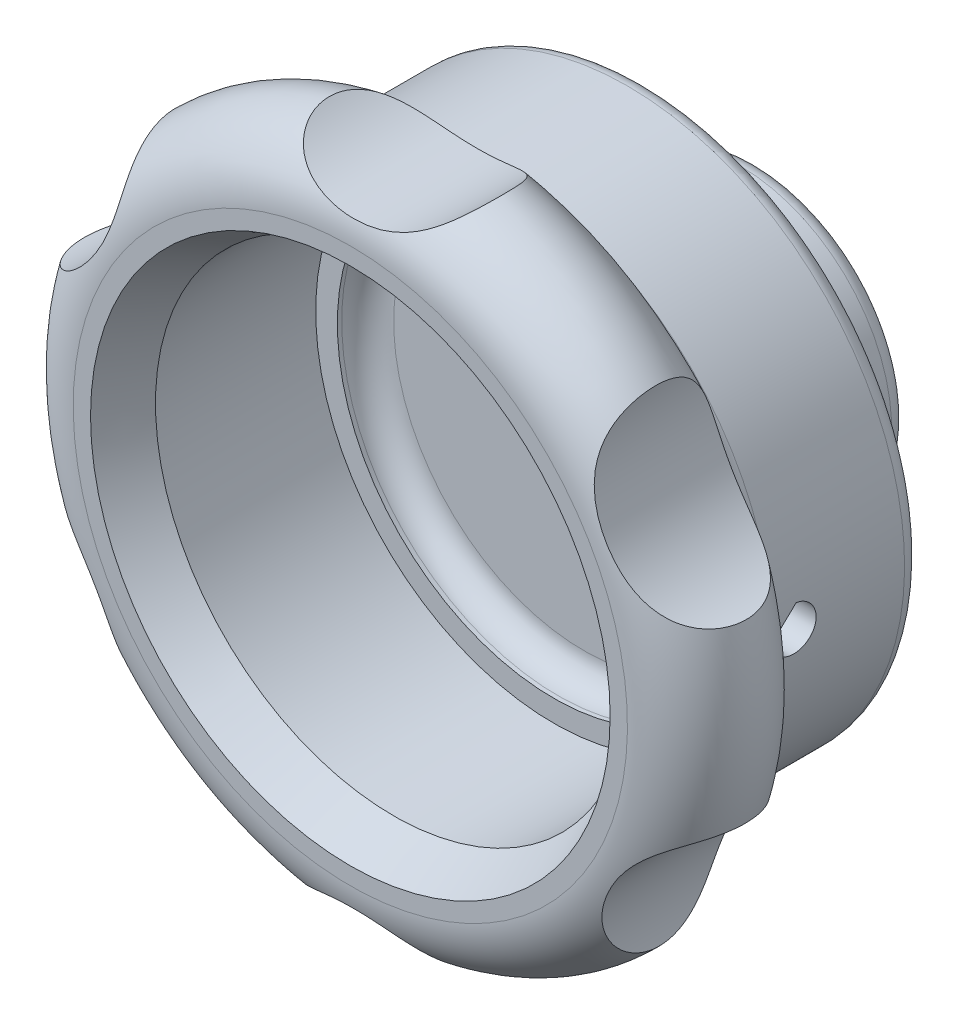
ISO-10303-21;
HEADER;
FILE_DESCRIPTION(('STEP AP214'),'2;1');
FILE_NAME('part.step','',(''),(''),'','','');
FILE_SCHEMA(('AUTOMOTIVE_DESIGN { 1 0 10303 214 1 1 1 1 }'));
ENDSEC;
DATA;
#1=APPLICATION_CONTEXT('core data for automotive mechanical design processes');
#2=APPLICATION_PROTOCOL_DEFINITION('international standard','automotive_design',2000,#1);
#3=PRODUCT_CONTEXT('',#1,'mechanical');
#4=PRODUCT('Part','Part','',(#3));
#5=PRODUCT_RELATED_PRODUCT_CATEGORY('part','',(#4));
#6=PRODUCT_DEFINITION_FORMATION('','',#4);
#7=PRODUCT_DEFINITION_CONTEXT('part definition',#1,'design');
#8=PRODUCT_DEFINITION('design','',#6,#7);
#9=PRODUCT_DEFINITION_SHAPE('','',#8);
#10=(LENGTH_UNIT() NAMED_UNIT(*) SI_UNIT(.MILLI.,.METRE.));
#11=(NAMED_UNIT(*) PLANE_ANGLE_UNIT() SI_UNIT($,.RADIAN.));
#12=(NAMED_UNIT(*) SI_UNIT($,.STERADIAN.) SOLID_ANGLE_UNIT());
#13=UNCERTAINTY_MEASURE_WITH_UNIT(LENGTH_MEASURE(1.E-05),#10,'distance_accuracy_value','');
#14=(GEOMETRIC_REPRESENTATION_CONTEXT(3) GLOBAL_UNCERTAINTY_ASSIGNED_CONTEXT((#13)) GLOBAL_UNIT_ASSIGNED_CONTEXT((#10,
#11,#12)) REPRESENTATION_CONTEXT('',''));
#15=CARTESIAN_POINT('',(0.,0.,0.));
#16=DIRECTION('',(0.,0.,1.));
#17=DIRECTION('',(1.,0.,0.));
#18=AXIS2_PLACEMENT_3D('',#15,#16,#17);
#19=CARTESIAN_POINT('',(0.,0.,57.6257476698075));
#20=DIRECTION('',(0.,0.,1.));
#21=DIRECTION('',(0.,1.,0.));
#22=AXIS2_PLACEMENT_3D('',#19,#20,#21);
#23=CYLINDRICAL_SURFACE('',#22,17.5000000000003);
#24=CARTESIAN_POINT('',(0.,17.5000000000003,5.50107999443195));
#25=CARTESIAN_POINT('',(-0.139641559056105,17.4999978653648,5.50519174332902));
#26=CARTESIAN_POINT('',(-0.279021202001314,17.4983111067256,5.52103875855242));
#27=CARTESIAN_POINT('',(-0.553199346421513,17.4917933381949,5.57577666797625));
#28=CARTESIAN_POINT('',(-0.687993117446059,17.4869591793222,5.61469063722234));
#29=CARTESIAN_POINT('',(-0.949002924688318,17.4747376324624,5.71438596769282));
#30=CARTESIAN_POINT('',(-1.07522518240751,17.4673521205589,5.77515126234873));
#31=CARTESIAN_POINT('',(-1.31566978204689,17.4508898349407,5.91679499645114));
#32=CARTESIAN_POINT('',(-1.42989393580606,17.4418133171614,5.99767039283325));
#33=CARTESIAN_POINT('',(-1.6439204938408,17.4229492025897,6.17784832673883));
#34=CARTESIAN_POINT('',(-1.74362768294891,17.4131574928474,6.27726355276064));
#35=CARTESIAN_POINT('',(-1.92499763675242,17.3940427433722,6.49142694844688));
#36=CARTESIAN_POINT('',(-2.00665949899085,17.3847197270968,6.6061758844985));
#37=CARTESIAN_POINT('',(-2.14989983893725,17.3675897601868,6.84828278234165));
#38=CARTESIAN_POINT('',(-2.21140229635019,17.3597885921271,6.97568616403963));
#39=CARTESIAN_POINT('',(-2.31210107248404,17.3466649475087,7.23914267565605));
#40=CARTESIAN_POINT('',(-2.35129851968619,17.3413423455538,7.3751953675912));
#41=CARTESIAN_POINT('',(-2.40601898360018,17.3338350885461,7.65108470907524));
#42=CARTESIAN_POINT('',(-2.42170421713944,17.3316289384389,7.79088859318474));
#43=CARTESIAN_POINT('',(-2.42943917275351,17.3305465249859,8.0711579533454));
#44=CARTESIAN_POINT('',(-2.42148994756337,17.3316701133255,8.21162339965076));
#45=CARTESIAN_POINT('',(-2.38232906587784,17.337095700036,8.48827370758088));
#46=CARTESIAN_POINT('',(-2.35126849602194,17.34137705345,8.62448041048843));
#47=CARTESIAN_POINT('',(-2.26698027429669,17.3525961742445,8.88973583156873));
#48=CARTESIAN_POINT('',(-2.21375193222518,17.3595340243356,9.01878432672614));
#49=CARTESIAN_POINT('',(-2.08638281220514,17.375302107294,9.26669369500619));
#50=CARTESIAN_POINT('',(-2.01215220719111,17.3841404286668,9.38550788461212));
#51=CARTESIAN_POINT('',(-1.84496204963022,17.4026770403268,9.60906125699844));
#52=CARTESIAN_POINT('',(-1.75200146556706,17.4123753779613,9.71379966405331));
#53=CARTESIAN_POINT('',(-1.5490727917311,17.4316041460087,9.90712679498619));
#54=CARTESIAN_POINT('',(-1.43897069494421,17.441132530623,9.99557512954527));
#55=CARTESIAN_POINT('',(-1.20538765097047,17.4588297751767,10.1527474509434));
#56=CARTESIAN_POINT('',(-1.08190679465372,17.4669986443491,10.22147157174));
#57=CARTESIAN_POINT('',(-0.825150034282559,17.4810075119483,10.3371513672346));
#58=CARTESIAN_POINT('',(-0.691883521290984,17.4868497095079,10.3841276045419));
#59=CARTESIAN_POINT('',(-0.419256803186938,17.4955082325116,10.4550046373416));
#60=CARTESIAN_POINT('',(-0.279896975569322,17.4983247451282,10.4789068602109));
#61=CARTESIAN_POINT('',(-0.000347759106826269,17.500553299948,10.5028100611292));
#62=CARTESIAN_POINT('',(0.139823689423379,17.4999949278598,10.5030184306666));
#63=CARTESIAN_POINT('',(0.418181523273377,17.4955566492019,10.480056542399));
#64=CARTESIAN_POINT('',(0.556367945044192,17.4916768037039,10.4568867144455));
#65=CARTESIAN_POINT('',(0.826444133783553,17.4809958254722,10.3879716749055));
#66=CARTESIAN_POINT('',(0.958350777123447,17.4742030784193,10.3422912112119));
#67=CARTESIAN_POINT('',(1.21263600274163,17.4584008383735,10.229720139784));
#68=CARTESIAN_POINT('',(1.33501410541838,17.4493912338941,10.162828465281));
#69=CARTESIAN_POINT('',(1.56780055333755,17.4300248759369,10.009128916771));
#70=CARTESIAN_POINT('',(1.67810909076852,17.4196582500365,9.92217112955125));
#71=CARTESIAN_POINT('',(1.88263560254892,17.3987434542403,9.73105034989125));
#72=CARTESIAN_POINT('',(1.97685279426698,17.3881952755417,9.62688652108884));
#73=CARTESIAN_POINT('',(2.14716447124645,17.3679909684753,9.40345368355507));
#74=CARTESIAN_POINT('',(2.22313166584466,17.358341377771,9.28408698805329));
#75=CARTESIAN_POINT('',(2.35392265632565,17.3410905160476,9.03414584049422));
#76=CARTESIAN_POINT('',(2.40874720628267,17.3334891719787,8.90357178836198));
#77=CARTESIAN_POINT('',(2.49541635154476,17.3212245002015,8.63556739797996));
#78=CARTESIAN_POINT('',(2.52737011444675,17.3165472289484,8.49817302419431));
#79=CARTESIAN_POINT('',(2.56775147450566,17.3106059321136,8.21990003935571));
#80=CARTESIAN_POINT('',(2.57618055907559,17.309341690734,8.0790216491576));
#81=CARTESIAN_POINT('',(2.56928917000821,17.3103657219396,7.79918537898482));
#82=CARTESIAN_POINT('',(2.55419018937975,17.3126208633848,7.6602218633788));
#83=CARTESIAN_POINT('',(2.50111228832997,17.32036798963,7.38683180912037));
#84=CARTESIAN_POINT('',(2.46313323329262,17.3258599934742,7.25240529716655));
#85=CARTESIAN_POINT('',(2.36539555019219,17.3394729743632,6.99179020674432));
#86=CARTESIAN_POINT('',(2.30562597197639,17.3475952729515,6.86560580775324));
#87=CARTESIAN_POINT('',(2.16602376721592,17.3655772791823,6.62501194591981));
#88=CARTESIAN_POINT('',(2.08619050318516,17.3754370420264,6.51060285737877));
#89=CARTESIAN_POINT('',(1.90783178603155,17.3959274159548,6.29564376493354));
#90=CARTESIAN_POINT('',(1.80913631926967,17.406564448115,6.19523541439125));
#91=CARTESIAN_POINT('',(1.59626150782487,17.4273739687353,6.01233288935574));
#92=CARTESIAN_POINT('',(1.4820786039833,17.4375463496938,5.9298428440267));
#93=CARTESIAN_POINT('',(1.2408658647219,17.4563725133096,5.78480196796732));
#94=CARTESIAN_POINT('',(1.11378042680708,17.4650192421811,5.72234271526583));
#95=CARTESIAN_POINT('',(0.850858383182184,17.4797971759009,5.61975874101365));
#96=CARTESIAN_POINT('',(0.715031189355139,17.4859310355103,5.57961043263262));
#97=CARTESIAN_POINT('',(0.482097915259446,17.4936162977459,5.53172086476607));
#98=CARTESIAN_POINT('',(0.38625185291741,17.4960022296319,5.517758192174));
#99=CARTESIAN_POINT('',(0.193561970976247,17.4991948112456,5.50101388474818));
#100=CARTESIAN_POINT('',(0.0967181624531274,17.5000014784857,5.49823212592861));
#101=CARTESIAN_POINT('',(0.,17.5000000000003,5.50107999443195));
#102=B_SPLINE_CURVE_WITH_KNOTS('',3,(#24,#25,#26,#27,#28,#29,#30,#31,#32,#33,#34,#35,#36,#37,
#38,#39,#40,#41,#42,#43,#44,#45,#46,#47,#48,#49,#50,#51,#52,#53,#54,#55,#56,#57,#58,#59,#60,#61,
#62,#63,#64,#65,#66,#67,#68,#69,#70,#71,#72,#73,#74,#75,#76,#77,#78,#79,#80,#81,#82,#83,#84,#85,
#86,#87,#88,#89,#90,#91,#92,#93,#94,#95,#96,#97,#98,#99,#100,#101),.UNSPECIFIED.,.T.,.F.,(4,2,2,
2,2,2,2,2,2,2,2,2,2,2,2,2,2,2,2,2,2,2,2,2,2,2,2,2,2,2,2,2,2,2,2,2,2,2,4),(0.,0.418752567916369,
0.83792474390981,1.25678934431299,1.67559060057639,2.09702567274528,2.51848181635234,
2.94150944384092,3.36451566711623,3.78458980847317,4.2046452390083,4.62197848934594,
5.03932473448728,5.45848368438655,5.87766572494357,6.30030661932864,6.72294464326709,
7.14518224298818,7.56739372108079,7.98590930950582,8.40441720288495,8.82172829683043,
9.23906038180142,9.65961751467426,10.080195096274,10.5036260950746,10.9270419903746,
11.3484230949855,11.769777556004,12.1871892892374,12.6046034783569,13.0222277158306,
13.4398652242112,13.8614616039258,14.2831550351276,14.7067497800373,15.1298958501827,
15.4199343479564,15.7099696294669),.UNSPECIFIED.);
#103=CARTESIAN_POINT('',(0.,17.5000000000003,5.50107999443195));
#104=VERTEX_POINT('',#103);
#105=EDGE_CURVE('E103',#104,#104,#102,.T.);
#106=ORIENTED_EDGE('',*,*,#105,.F.);
#107=EDGE_LOOP('',(#106));
#108=FACE_BOUND('',#107,.T.);
#109=CARTESIAN_POINT('',(0.,0.,11.));
#110=DIRECTION('',(0.,0.,1.));
#111=DIRECTION('',(0.,1.,0.));
#112=AXIS2_PLACEMENT_3D('',#109,#110,#111);
#113=CIRCLE('',#112,17.5000000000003);
#114=CARTESIAN_POINT('',(0.,17.5000000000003,11.));
#115=VERTEX_POINT('',#114);
#116=EDGE_CURVE('E201',#115,#115,#113,.T.);
#117=ORIENTED_EDGE('',*,*,#116,.F.);
#118=EDGE_LOOP('',(#117));
#119=FACE_BOUND('',#118,.T.);
#120=CARTESIAN_POINT('',(0.,0.,2.));
#121=DIRECTION('',(0.,0.,1.));
#122=DIRECTION('',(0.,1.,0.));
#123=AXIS2_PLACEMENT_3D('',#120,#121,#122);
#124=CIRCLE('',#123,17.5000000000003);
#125=CARTESIAN_POINT('',(0.,17.5000000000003,2.));
#126=VERTEX_POINT('',#125);
#127=EDGE_CURVE('E206',#126,#126,#124,.T.);
#128=ORIENTED_EDGE('',*,*,#127,.T.);
#129=EDGE_LOOP('',(#128));
#130=FACE_BOUND('',#129,.T.);
#131=CARTESIAN_POINT('',(17.320508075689,-2.5,8.));
#132=CARTESIAN_POINT('',(17.3205103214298,-2.49999417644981,7.86034478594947));
#133=CARTESIAN_POINT('',(17.3222153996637,-2.48825830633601,7.72060660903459));
#134=CARTESIAN_POINT('',(17.3288474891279,-2.44163425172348,7.44503170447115));
#135=CARTESIAN_POINT('',(17.3337777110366,-2.4067229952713,7.30919900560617));
#136=CARTESIAN_POINT('',(17.3462905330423,-2.3148092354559,7.04546412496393));
#137=CARTESIAN_POINT('',(17.3538711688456,-2.25782308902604,6.9175561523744));
#138=CARTESIAN_POINT('',(17.3708283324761,-2.12341469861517,6.67313783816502));
#139=CARTESIAN_POINT('',(17.3802045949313,-2.04599547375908,6.55662581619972));
#140=CARTESIAN_POINT('',(17.3997728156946,-1.87231683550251,6.3374396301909));
#141=CARTESIAN_POINT('',(17.4099696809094,-1.7759382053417,6.23486035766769));
#142=CARTESIAN_POINT('',(17.4299862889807,-1.567333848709,6.04727305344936));
#143=CARTESIAN_POINT('',(17.4398060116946,-1.45510727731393,5.96226595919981));
#144=CARTESIAN_POINT('',(17.4580129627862,-1.21738798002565,5.81188862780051));
#145=CARTESIAN_POINT('',(17.4663937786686,-1.09183970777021,5.74660535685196));
#146=CARTESIAN_POINT('',(17.4807243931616,-0.831420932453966,5.6380865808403));
#147=CARTESIAN_POINT('',(17.4866743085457,-0.696550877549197,5.59485001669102));
#148=CARTESIAN_POINT('',(17.4954381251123,-0.422292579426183,5.53193849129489));
#149=CARTESIAN_POINT('',(17.4982731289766,-0.282941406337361,5.51210491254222));
#150=CARTESIAN_POINT('',(17.5005599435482,-0.0028619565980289,5.49607012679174));
#151=CARTESIAN_POINT('',(17.5000119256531,0.137866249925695,5.49986772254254));
#152=CARTESIAN_POINT('',(17.495611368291,0.415623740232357,5.53086172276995));
#153=CARTESIAN_POINT('',(17.4917829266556,0.552672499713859,5.55788749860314));
#154=CARTESIAN_POINT('',(17.4812785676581,0.820269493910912,5.63430319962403));
#155=CARTESIAN_POINT('',(17.4746025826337,0.950817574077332,5.68369365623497));
#156=CARTESIAN_POINT('',(17.4591117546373,1.20222745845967,5.80361343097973));
#157=CARTESIAN_POINT('',(17.4502896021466,1.32305424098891,5.87421518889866));
#158=CARTESIAN_POINT('',(17.4314908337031,1.55120977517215,6.03450061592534));
#159=CARTESIAN_POINT('',(17.4215141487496,1.65853771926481,6.1241854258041));
#160=CARTESIAN_POINT('',(17.4014150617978,1.8576537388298,6.32104325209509));
#161=CARTESIAN_POINT('',(17.3912921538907,1.9492946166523,6.42836516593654));
#162=CARTESIAN_POINT('',(17.372128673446,2.11328736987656,6.65694315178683));
#163=CARTESIAN_POINT('',(17.3630881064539,2.18563914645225,6.77819929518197));
#164=CARTESIAN_POINT('',(17.3471131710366,2.30901626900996,7.0313503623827));
#165=CARTESIAN_POINT('',(17.3401801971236,2.36002750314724,7.16325225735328));
#166=CARTESIAN_POINT('',(17.3292308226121,2.43913279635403,7.43387197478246));
#167=CARTESIAN_POINT('',(17.3252142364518,2.46722831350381,7.57258936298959));
#168=CARTESIAN_POINT('',(17.3205872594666,2.49950488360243,7.85159567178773));
#169=CARTESIAN_POINT('',(17.3199472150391,2.50389413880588,7.99186003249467));
#170=CARTESIAN_POINT('',(17.3220671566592,2.489185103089,8.27112225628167));
#171=CARTESIAN_POINT('',(17.324827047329,2.47008747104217,8.41012015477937));
#172=CARTESIAN_POINT('',(17.3334087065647,2.40912297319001,8.68226522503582));
#173=CARTESIAN_POINT('',(17.3392166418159,2.36735894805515,8.8154359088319));
#174=CARTESIAN_POINT('',(17.3532286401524,2.2623538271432,9.07288599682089));
#175=CARTESIAN_POINT('',(17.3614328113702,2.19911176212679,9.19716499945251));
#176=CARTESIAN_POINT('',(17.3793831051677,2.05244200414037,9.43423984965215));
#177=CARTESIAN_POINT('',(17.3891394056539,1.96887900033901,9.5469512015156));
#178=CARTESIAN_POINT('',(17.4090636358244,1.78412847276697,9.75682465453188));
#179=CARTESIAN_POINT('',(17.4192315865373,1.68294004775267,9.85398596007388));
#180=CARTESIAN_POINT('',(17.4389256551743,1.4648963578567,10.0307440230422));
#181=CARTESIAN_POINT('',(17.4484463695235,1.3479289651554,10.1102031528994));
#182=CARTESIAN_POINT('',(17.4656902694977,1.10218588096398,10.2483444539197));
#183=CARTESIAN_POINT('',(17.4734135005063,0.973410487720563,10.3070271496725));
#184=CARTESIAN_POINT('',(17.4861684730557,0.708144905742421,10.4017276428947));
#185=CARTESIAN_POINT('',(17.4912092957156,0.571682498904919,10.4378219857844));
#186=CARTESIAN_POINT('',(17.4980694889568,0.294556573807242,10.4865693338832));
#187=CARTESIAN_POINT('',(17.4998890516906,0.153893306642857,10.4992237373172));
#188=CARTESIAN_POINT('',(17.5001000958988,-0.126303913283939,10.5007002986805));
#189=CARTESIAN_POINT('',(17.4985219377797,-0.265836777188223,10.4897335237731));
#190=CARTESIAN_POINT('',(17.4921758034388,-0.541053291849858,10.4447298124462));
#191=CARTESIAN_POINT('',(17.4874078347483,-0.676736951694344,10.410692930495));
#192=CARTESIAN_POINT('',(17.4752152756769,-0.940354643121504,10.3205875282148));
#193=CARTESIAN_POINT('',(17.4677922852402,-1.06829328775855,10.2645322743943));
#194=CARTESIAN_POINT('',(17.4511070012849,-1.31298213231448,10.1320035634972));
#195=CARTESIAN_POINT('',(17.4418446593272,-1.42973203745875,10.0555295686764));
#196=CARTESIAN_POINT('',(17.4224130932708,-1.64980243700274,9.88356535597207));
#197=CARTESIAN_POINT('',(17.4122368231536,-1.75300020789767,9.78791886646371));
#198=CARTESIAN_POINT('',(17.3921777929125,-1.9419589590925,9.58065304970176));
#199=CARTESIAN_POINT('',(17.3822951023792,-2.02771583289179,9.46902997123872));
#200=CARTESIAN_POINT('',(17.3638885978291,-2.17974404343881,9.23231820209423));
#201=CARTESIAN_POINT('',(17.3553719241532,-2.24591442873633,9.1071641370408));
#202=CARTESIAN_POINT('',(17.3407453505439,-2.35619878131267,8.84745962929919));
#203=CARTESIAN_POINT('',(17.3346329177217,-2.40033597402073,8.71291925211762));
#204=CARTESIAN_POINT('',(17.3269411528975,-2.45511568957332,8.48145446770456));
#205=CARTESIAN_POINT('',(17.3245412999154,-2.47192203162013,8.38596958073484));
#206=CARTESIAN_POINT('',(17.3213239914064,-2.49436614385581,8.1936697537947));
#207=CARTESIAN_POINT('',(17.3205065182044,-2.50000403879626,8.09685482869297));
#208=CARTESIAN_POINT('',(17.320508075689,-2.5,8.));
#209=B_SPLINE_CURVE_WITH_KNOTS('',3,(#131,#132,#133,#134,#135,#136,#137,#138,#139,#140,#141,
#142,#143,#144,#145,#146,#147,#148,#149,#150,#151,#152,#153,#154,#155,#156,#157,#158,#159,#160,
#161,#162,#163,#164,#165,#166,#167,#168,#169,#170,#171,#172,#173,#174,#175,#176,#177,#178,#179,
#180,#181,#182,#183,#184,#185,#186,#187,#188,#189,#190,#191,#192,#193,#194,#195,#196,#197,#198,
#199,#200,#201,#202,#203,#204,#205,#206,#207,#208),.UNSPECIFIED.,.T.,.F.,(4,2,2,2,2,2,2,2,2,2,2,
2,2,2,2,2,2,2,2,2,2,2,2,2,2,2,2,2,2,2,2,2,2,2,2,2,2,2,4),(0.,0.418611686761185,
0.837640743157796,1.2563599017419,1.67501722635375,2.09639644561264,2.5177981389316,
2.94103163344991,3.36424479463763,3.78457277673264,4.20487946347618,4.62212481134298,
5.03938007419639,5.4580768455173,5.87679865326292,6.29925647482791,6.72171646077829,
7.1444553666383,7.56716737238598,7.98616076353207,8.40514240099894,8.82223876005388,
9.23935394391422,9.6593265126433,10.0793205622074,10.502474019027,10.9256167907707,
11.3473177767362,11.7689936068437,12.1869171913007,12.6048397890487,13.0225109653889,
13.4401931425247,13.8614293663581,14.2827646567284,14.7062351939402,15.1292583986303,
15.4195806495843,15.7098996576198),.UNSPECIFIED.);
#210=CARTESIAN_POINT('',(17.320508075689,-2.5,8.));
#211=VERTEX_POINT('',#210);
#212=EDGE_CURVE('E79',#211,#211,#209,.T.);
#213=ORIENTED_EDGE('',*,*,#212,.F.);
#214=EDGE_LOOP('',(#213));
#215=FACE_BOUND('',#214,.T.);
#216=ADVANCED_FACE('F14',(#108,#119,#130,#215),#23,.T.);
#217=CARTESIAN_POINT('',(0.,0.,20.));
#218=DIRECTION('',(0.,0.,-1.));
#219=DIRECTION('',(0.,-1.,0.));
#220=AXIS2_PLACEMENT_3D('',#217,#218,#219);
#221=CYLINDRICAL_SURFACE('',#220,4.);
#222=CARTESIAN_POINT('',(0.,0.,0.5));
#223=DIRECTION('',(0.,0.,1.));
#224=DIRECTION('',(1.,0.,0.));
#225=AXIS2_PLACEMENT_3D('',#222,#223,#224);
#226=CIRCLE('',#225,4.);
#227=CARTESIAN_POINT('',(4.,0.,0.5));
#228=VERTEX_POINT('',#227);
#229=EDGE_CURVE('E34',#228,#228,#226,.F.);
#230=ORIENTED_EDGE('',*,*,#229,.T.);
#231=EDGE_LOOP('',(#230));
#232=FACE_BOUND('',#231,.T.);
#233=CARTESIAN_POINT('',(0.,0.,19.5));
#234=DIRECTION('',(0.,0.,-1.));
#235=DIRECTION('',(-1.,0.,0.));
#236=AXIS2_PLACEMENT_3D('',#233,#234,#235);
#237=CIRCLE('',#236,4.);
#238=CARTESIAN_POINT('',(-4.,0.,19.5));
#239=VERTEX_POINT('',#238);
#240=EDGE_CURVE('E30',#239,#239,#237,.F.);
#241=ORIENTED_EDGE('',*,*,#240,.T.);
#242=EDGE_LOOP('',(#241));
#243=FACE_BOUND('',#242,.T.);
#244=CARTESIAN_POINT('',(0.0734765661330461,3.99932509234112,10.5));
#245=CARTESIAN_POINT('',(0.201237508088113,3.99696830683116,10.4999896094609));
#246=CARTESIAN_POINT('',(0.328996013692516,3.98844392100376,10.4901429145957));
#247=CARTESIAN_POINT('',(0.58031131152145,3.95971060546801,10.4513969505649));
#248=CARTESIAN_POINT('',(0.703861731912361,3.93948472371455,10.422470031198));
#249=CARTESIAN_POINT('',(0.94271414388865,3.88923089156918,10.3473446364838));
#250=CARTESIAN_POINT('',(1.05805400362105,3.85925205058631,10.3012325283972));
#251=CARTESIAN_POINT('',(1.27886247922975,3.79181463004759,10.1936601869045));
#252=CARTESIAN_POINT('',(1.38433137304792,3.75435626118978,10.1322003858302));
#253=CARTESIAN_POINT('',(1.5924977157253,3.67117882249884,9.98992390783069));
#254=CARTESIAN_POINT('',(1.69419889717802,3.62502835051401,9.90790651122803));
#255=CARTESIAN_POINT('',(1.88326338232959,3.53051242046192,9.72962109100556));
#256=CARTESIAN_POINT('',(1.97060553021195,3.48214382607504,9.63333243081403));
#257=CARTESIAN_POINT('',(2.1407435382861,3.38057911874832,9.41361560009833));
#258=CARTESIAN_POINT('',(2.22124468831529,3.32763912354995,9.28827582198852));
#259=CARTESIAN_POINT('',(2.35969260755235,3.2309440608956,9.02252161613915));
#260=CARTESIAN_POINT('',(2.41768354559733,3.1871710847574,8.88213740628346));
#261=CARTESIAN_POINT('',(2.495166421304,3.12663545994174,8.63050502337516));
#262=CARTESIAN_POINT('',(2.52090047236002,3.10573808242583,8.52217922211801));
#263=CARTESIAN_POINT('',(2.5577322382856,3.07548264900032,8.30155413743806));
#264=CARTESIAN_POINT('',(2.56885155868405,3.06610756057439,8.18926097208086));
#265=CARTESIAN_POINT('',(2.57576598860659,3.06030332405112,7.96354765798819));
#266=CARTESIAN_POINT('',(2.57151921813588,3.06390955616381,7.85012527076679));
#267=CARTESIAN_POINT('',(2.54790667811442,3.08356785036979,7.62593327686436));
#268=CARTESIAN_POINT('',(2.52852800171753,3.09963053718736,7.51516601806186));
#269=CARTESIAN_POINT('',(2.47640905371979,3.1414115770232,7.30161896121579));
#270=CARTESIAN_POINT('',(2.44398564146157,3.16689986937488,7.19871419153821));
#271=CARTESIAN_POINT('',(2.36708813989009,3.22477980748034,6.99962585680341));
#272=CARTESIAN_POINT('',(2.32261008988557,3.25717372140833,6.90344451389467));
#273=CARTESIAN_POINT('',(2.21278730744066,3.33299397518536,6.70031041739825));
#274=CARTESIAN_POINT('',(2.1450552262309,3.37733505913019,6.59499112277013));
#275=CARTESIAN_POINT('',(1.99514719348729,3.46800817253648,6.39602895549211));
#276=CARTESIAN_POINT('',(1.91295411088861,3.51434251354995,6.30240015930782));
#277=CARTESIAN_POINT('',(1.71873848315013,3.6138509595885,6.11191815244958));
#278=CARTESIAN_POINT('',(1.60400994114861,3.66671758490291,6.01763328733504));
#279=CARTESIAN_POINT('',(1.35746987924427,3.76494692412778,5.84975982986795));
#280=CARTESIAN_POINT('',(1.22567618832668,3.81031735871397,5.77614988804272));
#281=CARTESIAN_POINT('',(0.974969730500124,3.88110241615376,5.66498849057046));
#282=CARTESIAN_POINT('',(0.858544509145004,3.90868249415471,5.62320697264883));
#283=CARTESIAN_POINT('',(0.618977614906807,3.95369172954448,5.55708492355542));
#284=CARTESIAN_POINT('',(0.495841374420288,3.97112896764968,5.53273050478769));
#285=CARTESIAN_POINT('',(0.245769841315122,3.99442267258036,5.50275724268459));
#286=CARTESIAN_POINT('',(0.118823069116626,4.00023961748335,5.49720229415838));
#287=CARTESIAN_POINT('',(-0.13442374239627,3.99974517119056,5.50544077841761));
#288=CARTESIAN_POINT('',(-0.260723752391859,3.9934332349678,5.51923508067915));
#289=CARTESIAN_POINT('',(-0.501903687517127,3.97013648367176,5.56419004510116));
#290=CARTESIAN_POINT('',(-0.617030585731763,3.95375343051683,5.59436103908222));
#291=CARTESIAN_POINT('',(-0.840442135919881,3.91236208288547,5.67004842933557));
#292=CARTESIAN_POINT('',(-0.948725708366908,3.88735243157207,5.71556723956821));
#293=CARTESIAN_POINT('',(-1.16371864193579,3.82871105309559,5.82403035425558));
#294=CARTESIAN_POINT('',(-1.26979322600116,3.79460017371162,5.88796741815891));
#295=CARTESIAN_POINT('',(-1.470331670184,3.72149692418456,6.02978069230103));
#296=CARTESIAN_POINT('',(-1.56478640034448,3.68250076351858,6.1076677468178));
#297=CARTESIAN_POINT('',(-1.75356176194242,3.59683669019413,6.28789168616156));
#298=CARTESIAN_POINT('',(-1.84593347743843,3.5498689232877,6.39213204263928));
#299=CARTESIAN_POINT('',(-2.01255383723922,3.45813190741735,6.61513562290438));
#300=CARTESIAN_POINT('',(-2.08680104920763,3.41336283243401,6.73389999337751));
#301=CARTESIAN_POINT('',(-2.20689599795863,3.33676747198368,6.96806571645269));
#302=CARTESIAN_POINT('',(-2.25517700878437,3.30401578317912,7.0819088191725));
#303=CARTESIAN_POINT('',(-2.33479030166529,3.24825100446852,7.3175960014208));
#304=CARTESIAN_POINT('',(-2.36614537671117,3.22522482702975,7.43942907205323));
#305=CARTESIAN_POINT('',(-2.41038950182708,3.19230702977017,7.68921205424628));
#306=CARTESIAN_POINT('',(-2.42313715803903,3.18251602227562,7.81720124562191));
#307=CARTESIAN_POINT('',(-2.42872290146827,3.17825861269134,8.0738644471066));
#308=CARTESIAN_POINT('',(-2.4215668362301,3.18378770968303,8.20253824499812));
#309=CARTESIAN_POINT('',(-2.38995689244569,3.20755464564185,8.44067784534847));
#310=CARTESIAN_POINT('',(-2.36766163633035,3.22420269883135,8.55060794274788));
#311=CARTESIAN_POINT('',(-2.30921633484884,3.26631441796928,8.76493509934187));
#312=CARTESIAN_POINT('',(-2.27305942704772,3.29178244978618,8.8693293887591));
#313=CARTESIAN_POINT('',(-2.18396736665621,3.35163042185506,9.08092338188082));
#314=CARTESIAN_POINT('',(-2.12973402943,3.38663960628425,9.1873932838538));
#315=CARTESIAN_POINT('',(-2.00745550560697,3.46052497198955,9.39061401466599));
#316=CARTESIAN_POINT('',(-1.93940128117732,3.49940367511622,9.4873584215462));
#317=CARTESIAN_POINT('',(-1.77589347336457,3.58556980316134,9.68810542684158));
#318=CARTESIAN_POINT('',(-1.67768402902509,3.63301217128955,9.78981588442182));
#319=CARTESIAN_POINT('',(-1.46446608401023,3.72408594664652,9.97605717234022));
#320=CARTESIAN_POINT('',(-1.34944491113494,3.7677144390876,10.0605749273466));
#321=CARTESIAN_POINT('',(-1.10072977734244,3.84783890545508,10.2120050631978));
#322=CARTESIAN_POINT('',(-0.966586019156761,3.88408727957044,10.2783263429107));
#323=CARTESIAN_POINT('',(-0.756521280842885,3.92846404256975,10.3593967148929));
#324=CARTESIAN_POINT('',(-0.685077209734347,3.94158471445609,10.3833413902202));
#325=CARTESIAN_POINT('',(-0.539788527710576,3.96409071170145,10.4247884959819));
#326=CARTESIAN_POINT('',(-0.465945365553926,3.97347824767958,10.4422947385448));
#327=CARTESIAN_POINT('',(-0.314957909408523,3.98831756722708,10.4708595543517));
#328=CARTESIAN_POINT('',(-0.237776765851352,3.9936800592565,10.4817708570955));
#329=CARTESIAN_POINT('',(-0.0825712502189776,3.99990343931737,10.496344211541));
#330=CARTESIAN_POINT('',(-0.00454688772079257,4.00076437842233,10.5000063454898));
#331=CARTESIAN_POINT('',(0.0734765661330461,3.99932509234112,10.5));
#332=B_SPLINE_CURVE_WITH_KNOTS('',3,(#244,#245,#246,#247,#248,#249,#250,#251,#252,#253,#254,
#255,#256,#257,#258,#259,#260,#261,#262,#263,#264,#265,#266,#267,#268,#269,#270,#271,#272,#273,
#274,#275,#276,#277,#278,#279,#280,#281,#282,#283,#284,#285,#286,#287,#288,#289,#290,#291,#292,
#293,#294,#295,#296,#297,#298,#299,#300,#301,#302,#303,#304,#305,#306,#307,#308,#309,#310,#311,
#312,#313,#314,#315,#316,#317,#318,#319,#320,#321,#322,#323,#324,#325,#326,#327,#328,#329,#330,
#331),.UNSPECIFIED.,.T.,.F.,(4,2,2,2,2,2,2,2,2,2,2,2,2,2,2,2,2,2,2,2,2,2,2,2,2,2,2,2,2,2,2,2,2,
2,2,2,2,2,2,2,2,2,2,4),(0.,0.383036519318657,0.766629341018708,1.14831978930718,
1.52999948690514,1.9440976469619,2.35880055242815,2.83079001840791,3.30184862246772,
3.64030606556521,3.97826258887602,4.31714089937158,4.65630857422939,4.9876922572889,
5.31918495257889,5.71625862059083,6.11380588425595,6.58439663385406,7.05449963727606,
7.43308074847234,7.81135983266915,8.19092331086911,8.57050384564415,8.92935240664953,
9.28825743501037,9.67215667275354,10.0563556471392,10.4954700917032,10.9346192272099,
11.3168656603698,11.6985960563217,12.0832123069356,12.4677155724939,12.8064863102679,
13.1454249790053,13.5176204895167,13.8900601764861,14.3354763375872,14.7812299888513,
15.2400976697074,15.4692154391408,15.6981973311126,15.9321199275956,16.1660398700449),.UNSPECIFIED.);
#333=CARTESIAN_POINT('',(0.0734765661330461,3.99932509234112,10.5));
#334=VERTEX_POINT('',#333);
#335=EDGE_CURVE('E87',#334,#334,#332,.T.);
#336=ORIENTED_EDGE('',*,*,#335,.T.);
#337=EDGE_LOOP('',(#336));
#338=FACE_BOUND('',#337,.T.);
#339=CARTESIAN_POINT('',(3.12249899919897,-2.5,8.));
#340=CARTESIAN_POINT('',(3.12249991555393,-2.4999994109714,8.06215675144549));
#341=CARTESIAN_POINT('',(3.12436490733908,-2.49767581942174,8.12432594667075));
#342=CARTESIAN_POINT('',(3.13172923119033,-2.48843349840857,8.24811717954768));
#343=CARTESIAN_POINT('',(3.13723070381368,-2.48151206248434,8.30973887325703));
#344=CARTESIAN_POINT('',(3.15888953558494,-2.45397595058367,8.49322604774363));
#345=CARTESIAN_POINT('',(3.18020036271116,-2.42658990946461,8.61354833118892));
#346=CARTESIAN_POINT('',(3.23299770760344,-2.35576217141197,8.84559819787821));
#347=CARTESIAN_POINT('',(3.26439575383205,-2.31245961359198,8.95739041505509));
#348=CARTESIAN_POINT('',(3.33366000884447,-2.21143916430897,9.1720085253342));
#349=CARTESIAN_POINT('',(3.37152639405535,-2.15372087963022,9.27483417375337));
#350=CARTESIAN_POINT('',(3.45559225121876,-2.01647682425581,9.48373398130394));
#351=CARTESIAN_POINT('',(3.50222814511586,-1.93506425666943,9.58839332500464));
#352=CARTESIAN_POINT('',(3.59505503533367,-1.75662526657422,9.78376155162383));
#353=CARTESIAN_POINT('',(3.64124561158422,-1.65958538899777,9.87445827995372));
#354=CARTESIAN_POINT('',(3.73459524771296,-1.43833990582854,10.0502202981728));
#355=CARTESIAN_POINT('',(3.78119887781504,-1.3122693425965,10.1332861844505));
#356=CARTESIAN_POINT('',(3.84307251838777,-1.11163395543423,10.2405451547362));
#357=CARTESIAN_POINT('',(3.86236283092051,-1.04281240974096,10.2734151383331));
#358=CARTESIAN_POINT('',(3.8977043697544,-0.90175876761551,10.3329546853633));
#359=CARTESIAN_POINT('',(3.91375783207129,-0.82952906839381,10.3596285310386));
#360=CARTESIAN_POINT('',(3.94066759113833,-0.6897002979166,10.4039838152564));
#361=CARTESIAN_POINT('',(3.95188535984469,-0.622371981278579,10.4223019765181));
#362=CARTESIAN_POINT('',(3.97096241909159,-0.48599757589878,10.4533022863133));
#363=CARTESIAN_POINT('',(3.97882364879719,-0.416952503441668,10.4659876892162));
#364=CARTESIAN_POINT('',(3.99095470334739,-0.277765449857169,10.4855137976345));
#365=CARTESIAN_POINT('',(3.99522674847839,-0.207624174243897,10.4923581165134));
#366=CARTESIAN_POINT('',(4.00006125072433,-0.0669114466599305,10.5000992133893));
#367=CARTESIAN_POINT('',(4.0006241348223,0.00365995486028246,10.5009966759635));
#368=CARTESIAN_POINT('',(3.99704479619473,0.196045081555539,10.4952746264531));
#369=CARTESIAN_POINT('',(3.98917040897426,0.317681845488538,10.4826934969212));
#370=CARTESIAN_POINT('',(3.96290903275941,0.556636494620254,10.4402697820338));
#371=CARTESIAN_POINT('',(3.94452124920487,0.67395405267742,10.4104258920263));
#372=CARTESIAN_POINT('',(3.89876170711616,0.901771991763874,10.3347914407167));
#373=CARTESIAN_POINT('',(3.87136697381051,1.01225407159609,10.2889600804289));
#374=CARTESIAN_POINT('',(3.80971291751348,1.22404012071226,10.1830627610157));
#375=CARTESIAN_POINT('',(3.77545203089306,1.32534199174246,10.1229935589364));
#376=CARTESIAN_POINT('',(3.69786441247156,1.5294264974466,9.98194358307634));
#377=CARTESIAN_POINT('',(3.65394006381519,1.6308245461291,9.8992907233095));
#378=CARTESIAN_POINT('',(3.56390927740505,1.81919733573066,9.71973526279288));
#379=CARTESIAN_POINT('',(3.51779973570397,1.90615071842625,9.62281195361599));
#380=CARTESIAN_POINT('',(3.42142883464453,2.07470887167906,9.4025887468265));
#381=CARTESIAN_POINT('',(3.37141162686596,2.15413229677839,9.27749723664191));
#382=CARTESIAN_POINT('',(3.28028278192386,2.29052307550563,9.0127077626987));
#383=CARTESIAN_POINT('',(3.23915480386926,2.34753179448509,8.87303731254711));
#384=CARTESIAN_POINT('',(3.18183753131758,2.42437133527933,8.62046119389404));
#385=CARTESIAN_POINT('',(3.16193408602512,2.45003683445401,8.51017807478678));
#386=CARTESIAN_POINT('',(3.13358277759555,2.48620337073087,8.28576962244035));
#387=CARTESIAN_POINT('',(3.12511926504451,2.49672512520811,8.17164975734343));
#388=CARTESIAN_POINT('',(3.12092267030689,2.50197072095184,7.94254263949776));
#389=CARTESIAN_POINT('',(3.12521876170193,2.49665835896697,7.82755399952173));
#390=CARTESIAN_POINT('',(3.14592085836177,2.47051466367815,7.60043883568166));
#391=CARTESIAN_POINT('',(3.16233689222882,2.44967047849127,7.48831476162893));
#392=CARTESIAN_POINT('',(3.20460120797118,2.3940987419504,7.27156324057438));
#393=CARTESIAN_POINT('',(3.23028954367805,2.3596057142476,7.16684268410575));
#394=CARTESIAN_POINT('',(3.28831148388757,2.27804893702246,6.96442530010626));
#395=CARTESIAN_POINT('',(3.32064744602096,2.2309807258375,6.86673098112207));
#396=CARTESIAN_POINT('',(3.39574401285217,2.11530798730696,6.66138805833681));
#397=CARTESIAN_POINT('',(3.43931724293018,2.04430931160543,6.55538547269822));
#398=CARTESIAN_POINT('',(3.52787943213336,1.88737868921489,6.35562933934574));
#399=CARTESIAN_POINT('',(3.57286982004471,1.80143124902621,6.2618886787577));
#400=CARTESIAN_POINT('',(3.66766209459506,1.60076932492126,6.07403592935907));
#401=CARTESIAN_POINT('',(3.71707933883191,1.48365201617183,5.98227260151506));
#402=CARTESIAN_POINT('',(3.80768973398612,1.23256787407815,5.81985298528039));
#403=CARTESIAN_POINT('',(3.8488867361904,1.09860897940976,5.74918680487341));
#404=CARTESIAN_POINT('',(3.89988966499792,0.891930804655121,5.66341893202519));
#405=CARTESIAN_POINT('',(3.91477055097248,0.824318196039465,5.63870255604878));
#406=CARTESIAN_POINT('',(3.94124643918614,0.686640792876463,5.59506172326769));
#407=CARTESIAN_POINT('',(3.95284334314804,0.616577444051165,5.57613391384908));
#408=CARTESIAN_POINT('',(3.9723851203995,0.474639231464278,5.54439416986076));
#409=CARTESIAN_POINT('',(3.98033317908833,0.402766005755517,5.53157690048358));
#410=CARTESIAN_POINT('',(3.99234168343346,0.257881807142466,5.51226082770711));
#411=CARTESIAN_POINT('',(3.99640277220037,0.18487102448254,5.50576097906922));
#412=CARTESIAN_POINT('',(4.00191521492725,-0.0131102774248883,5.49692848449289));
#413=CARTESIAN_POINT('',(3.99952706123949,-0.138539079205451,5.50073420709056));
#414=CARTESIAN_POINT('',(3.98321975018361,-0.386583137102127,5.52691758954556));
#415=CARTESIAN_POINT('',(3.9693011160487,-0.509198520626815,5.54929440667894));
#416=CARTESIAN_POINT('',(3.931920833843,-0.744080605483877,5.61032241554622));
#417=CARTESIAN_POINT('',(3.90880701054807,-0.856558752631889,5.64838207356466));
#418=CARTESIAN_POINT('',(3.85489971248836,-1.07343034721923,5.73911946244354));
#419=CARTESIAN_POINT('',(3.824104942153,-1.177822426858,5.79179965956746));
#420=CARTESIAN_POINT('',(3.75350673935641,-1.38731297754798,5.91632127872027));
#421=CARTESIAN_POINT('',(3.71310001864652,-1.49136012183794,5.98958399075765));
#422=CARTESIAN_POINT('',(3.62867283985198,-1.68643334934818,6.1501532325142));
#423=CARTESIAN_POINT('',(3.5846483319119,-1.77744451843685,6.23747560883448));
#424=CARTESIAN_POINT('',(3.49000828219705,-1.95744716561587,6.43823251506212));
#425=CARTESIAN_POINT('',(3.43935738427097,-2.04425661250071,6.5536166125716));
#426=CARTESIAN_POINT('',(3.34349647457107,-2.19754648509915,6.79928940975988));
#427=CARTESIAN_POINT('',(3.29828346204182,-2.26403815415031,6.92956981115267));
#428=CARTESIAN_POINT('',(3.22859539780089,-2.36198229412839,7.17280530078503));
#429=CARTESIAN_POINT('',(3.20174639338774,-2.39792458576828,7.28327057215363));
#430=CARTESIAN_POINT('',(3.15878358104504,-2.45425618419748,7.50993934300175));
#431=CARTESIAN_POINT('',(3.14263581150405,-2.47469472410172,7.62612341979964));
#432=CARTESIAN_POINT('',(3.12952857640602,-2.49119847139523,7.78605999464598));
#433=CARTESIAN_POINT('',(3.12689994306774,-2.4944943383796,7.82872552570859));
#434=CARTESIAN_POINT('',(3.12338461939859,-2.49889558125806,7.91425869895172));
#435=CARTESIAN_POINT('',(3.12249836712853,-2.50000040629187,7.95712638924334));
#436=CARTESIAN_POINT('',(3.12249899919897,-2.5,8.));
#437=B_SPLINE_CURVE_WITH_KNOTS('',3,(#339,#340,#341,#342,#343,#344,#345,#346,#347,#348,#349,
#350,#351,#352,#353,#354,#355,#356,#357,#358,#359,#360,#361,#362,#363,#364,#365,#366,#367,#368,
#369,#370,#371,#372,#373,#374,#375,#376,#377,#378,#379,#380,#381,#382,#383,#384,#385,#386,#387,
#388,#389,#390,#391,#392,#393,#394,#395,#396,#397,#398,#399,#400,#401,#402,#403,#404,#405,#406,
#407,#408,#409,#410,#411,#412,#413,#414,#415,#416,#417,#418,#419,#420,#421,#422,#423,#424,#425,
#426,#427,#428,#429,#430,#431,#432,#433,#434,#435,#436),.UNSPECIFIED.,.T.,.F.,(4,2,2,2,2,2,2,2,
2,2,2,2,2,2,2,2,2,2,2,2,2,2,2,2,2,2,2,2,2,2,2,2,2,2,2,2,2,2,2,2,2,2,2,2,2,2,2,2,4),(0.,
0.186415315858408,0.372940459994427,0.746478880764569,1.11682668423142,1.48718459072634,
1.90722798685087,2.32763499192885,2.79876029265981,3.03445880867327,3.2699939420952,
3.48170145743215,3.69328649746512,3.90474055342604,4.11617026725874,4.48184709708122,
4.84755156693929,5.21419620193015,5.58092442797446,5.9932908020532,6.40626158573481,
6.87316206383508,7.33919680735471,7.6826562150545,8.02564530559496,8.36941921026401,
8.71347788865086,9.05186495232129,9.39037223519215,9.793327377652,10.1967026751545,
10.6647326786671,11.1325428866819,11.3527929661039,11.5729152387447,11.7928449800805,
12.0127383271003,12.3871595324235,12.7615637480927,13.1229788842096,13.4844550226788,
13.8834503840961,14.2828986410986,14.7399238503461,15.1966956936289,15.5530255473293,
15.9082190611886,16.0367696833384,16.1653526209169),.UNSPECIFIED.);
#438=CARTESIAN_POINT('',(3.12249899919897,-2.5,8.));
#439=VERTEX_POINT('',#438);
#440=EDGE_CURVE('E46',#439,#439,#437,.T.);
#441=ORIENTED_EDGE('',*,*,#440,.F.);
#442=EDGE_LOOP('',(#441));
#443=FACE_BOUND('',#442,.T.);
#444=ADVANCED_FACE('F74',(#232,#243,#338,#443),#221,.F.);
#445=CARTESIAN_POINT('',(0.,0.,39.5));
#446=DIRECTION('',(0.,0.,1.));
#447=DIRECTION('',(0.,1.,0.));
#448=AXIS2_PLACEMENT_3D('',#445,#446,#447);
#449=TOROIDAL_SURFACE('',#448,32.,7.5);
#450=CARTESIAN_POINT('',(27.869144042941,-25.2032248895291,44.5167446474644));
#451=CARTESIAN_POINT('',(27.8628062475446,-25.0217375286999,44.6572456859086));
#452=CARTESIAN_POINT('',(27.8595339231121,-24.833259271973,44.7889765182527));
#453=CARTESIAN_POINT('',(27.8605746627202,-24.44512020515,45.0349426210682));
#454=CARTESIAN_POINT('',(27.864893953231,-24.2454503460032,45.1491634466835));
#455=CARTESIAN_POINT('',(27.882278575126,-23.8370827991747,45.3610616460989));
#456=CARTESIAN_POINT('',(27.8953724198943,-23.6283577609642,45.4586837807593));
#457=CARTESIAN_POINT('',(27.9311401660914,-23.2049891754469,45.6381021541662));
#458=CARTESIAN_POINT('',(27.9538172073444,-22.9903437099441,45.7198931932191));
#459=CARTESIAN_POINT('',(28.0165177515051,-22.500853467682,45.8885697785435));
#460=CARTESIAN_POINT('',(28.0595246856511,-22.224925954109,45.9712079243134));
#461=CARTESIAN_POINT('',(28.1621107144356,-21.6709766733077,46.1168176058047));
#462=CARTESIAN_POINT('',(28.2216954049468,-21.3929542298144,46.1797824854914));
#463=CARTESIAN_POINT('',(28.3575796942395,-20.8374569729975,46.289274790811));
#464=CARTESIAN_POINT('',(28.4338983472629,-20.5599831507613,46.3357833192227));
#465=CARTESIAN_POINT('',(28.6030170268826,-20.0081715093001,46.4151061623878));
#466=CARTESIAN_POINT('',(28.6958172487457,-19.7338337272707,46.4479203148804));
#467=CARTESIAN_POINT('',(28.9251976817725,-19.1155856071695,46.5096408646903));
#468=CARTESIAN_POINT('',(29.0668089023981,-18.7731815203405,46.5350203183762));
#469=CARTESIAN_POINT('',(29.3753645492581,-18.0991146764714,46.5707231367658));
#470=CARTESIAN_POINT('',(29.5423164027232,-17.7674551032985,46.5810420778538));
#471=CARTESIAN_POINT('',(29.9004879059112,-17.1172160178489,46.5880632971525));
#472=CARTESIAN_POINT('',(30.0917158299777,-16.7986410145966,46.5847609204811));
#473=CARTESIAN_POINT('',(30.4970260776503,-16.1769311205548,46.5640634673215));
#474=CARTESIAN_POINT('',(30.7111024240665,-15.8737922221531,46.5466720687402));
#475=CARTESIAN_POINT('',(31.1191967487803,-15.3390433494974,46.5000973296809));
#476=CARTESIAN_POINT('',(31.3097014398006,-15.1045053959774,46.4736589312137));
#477=CARTESIAN_POINT('',(31.7035604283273,-14.6483663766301,46.4075693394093));
#478=CARTESIAN_POINT('',(31.9069149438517,-14.4267655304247,46.367917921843));
#479=CARTESIAN_POINT('',(32.324271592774,-13.9983657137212,46.2726300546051));
#480=CARTESIAN_POINT('',(32.5382496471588,-13.7915356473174,46.2170285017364));
#481=CARTESIAN_POINT('',(32.9748205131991,-13.3937025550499,46.0864103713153));
#482=CARTESIAN_POINT('',(33.1974100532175,-13.2026936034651,46.0114011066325));
#483=CARTESIAN_POINT('',(33.5840127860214,-12.8897534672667,45.8628650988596));
#484=CARTESIAN_POINT('',(33.7467572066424,-12.7635819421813,45.7949377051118));
#485=CARTESIAN_POINT('',(34.0733256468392,-12.5207773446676,45.6459555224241));
#486=CARTESIAN_POINT('',(34.2371493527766,-12.4041416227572,45.5649043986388));
#487=CARTESIAN_POINT('',(34.5639457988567,-12.1809631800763,45.3885403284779));
#488=CARTESIAN_POINT('',(34.7269187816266,-12.0744174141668,45.2932317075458));
#489=CARTESIAN_POINT('',(35.0498376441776,-11.8718281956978,45.0874484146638));
#490=CARTESIAN_POINT('',(35.2097834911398,-11.775784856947,44.9769735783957));
#491=CARTESIAN_POINT('',(35.5257253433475,-11.5936014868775,44.7391778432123));
#492=CARTESIAN_POINT('',(35.6816661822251,-11.507569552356,44.6117002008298));
#493=CARTESIAN_POINT('',(35.9852043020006,-11.3466300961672,44.3407356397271));
#494=CARTESIAN_POINT('',(36.1328013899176,-11.271722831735,44.1972483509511));
#495=CARTESIAN_POINT('',(36.4168512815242,-11.1329314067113,43.8948549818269));
#496=CARTESIAN_POINT('',(36.5533088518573,-11.0690425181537,43.7359555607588));
#497=CARTESIAN_POINT('',(36.8125475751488,-10.9518912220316,43.4037456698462));
#498=CARTESIAN_POINT('',(36.9353309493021,-10.8986270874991,43.2304375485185));
#499=CARTESIAN_POINT('',(37.147918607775,-10.8093142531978,42.8975606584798));
#500=CARTESIAN_POINT('',(37.2399143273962,-10.7718843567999,42.7397548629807));
#501=CARTESIAN_POINT('',(37.411101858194,-10.7039267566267,42.4159269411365));
#502=CARTESIAN_POINT('',(37.4902945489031,-10.6733985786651,42.2499053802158));
#503=CARTESIAN_POINT('',(37.6348545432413,-10.6188288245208,41.910953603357));
#504=CARTESIAN_POINT('',(37.7002238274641,-10.594786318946,41.7380243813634));
#505=CARTESIAN_POINT('',(37.8163567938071,-10.5527834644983,41.3866107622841));
#506=CARTESIAN_POINT('',(37.8671206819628,-10.5348230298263,41.2081264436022));
#507=CARTESIAN_POINT('',(37.9509042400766,-10.5055357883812,40.8577085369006));
#508=CARTESIAN_POINT('',(37.9847940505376,-10.4938801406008,40.686009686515));
#509=CARTESIAN_POINT('',(38.0387847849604,-10.4754396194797,40.3402004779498));
#510=CARTESIAN_POINT('',(38.0588860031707,-10.4686546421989,40.1660901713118));
#511=CARTESIAN_POINT('',(38.0851036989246,-10.4598239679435,39.8167225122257));
#512=CARTESIAN_POINT('',(38.0912218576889,-10.4577777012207,39.6414653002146));
#513=CARTESIAN_POINT('',(38.089420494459,-10.4583818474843,39.2910287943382));
#514=CARTESIAN_POINT('',(38.0815008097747,-10.461032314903,39.1158495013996));
#515=CARTESIAN_POINT('',(38.0517216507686,-10.4710751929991,38.7670868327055));
#516=CARTESIAN_POINT('',(38.0298835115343,-10.4784603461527,38.5935014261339));
#517=CARTESIAN_POINT('',(37.9724987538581,-10.4981078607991,38.2488952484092));
#518=CARTESIAN_POINT('',(37.9369524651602,-10.5103701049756,38.077874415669));
#519=CARTESIAN_POINT('',(37.8525075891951,-10.539993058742,37.7396267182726));
#520=CARTESIAN_POINT('',(37.8036100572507,-10.5573533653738,37.5723995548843));
#521=CARTESIAN_POINT('',(37.6929657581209,-10.597459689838,37.242916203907));
#522=CARTESIAN_POINT('',(37.6312190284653,-10.6202056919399,37.0806600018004));
#523=CARTESIAN_POINT('',(37.4956088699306,-10.6713880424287,36.7624191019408));
#524=CARTESIAN_POINT('',(37.4217576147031,-10.69981867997,36.606428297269));
#525=CARTESIAN_POINT('',(37.2627239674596,-10.7627307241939,36.301611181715));
#526=CARTESIAN_POINT('',(37.1775416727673,-10.7972120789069,36.1527848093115));
#527=CARTESIAN_POINT('',(36.9968522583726,-10.8725545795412,35.8632745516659));
#528=CARTESIAN_POINT('',(36.9013468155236,-10.9134146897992,35.722589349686));
#529=CARTESIAN_POINT('',(36.7011420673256,-11.001813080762,35.4501470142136));
#530=CARTESIAN_POINT('',(36.5964426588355,-11.0493514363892,35.3183899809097));
#531=CARTESIAN_POINT('',(36.37789408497,-11.1519086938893,35.0630105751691));
#532=CARTESIAN_POINT('',(36.2639551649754,-11.2070058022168,34.939496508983));
#533=CARTESIAN_POINT('',(36.0293785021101,-11.324406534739,34.7026993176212));
#534=CARTESIAN_POINT('',(35.9087408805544,-11.3867100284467,34.5894160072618));
#535=CARTESIAN_POINT('',(35.6621989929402,-11.5185757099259,34.3732852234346));
#536=CARTESIAN_POINT('',(35.5362944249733,-11.5881383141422,34.2704383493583));
#537=CARTESIAN_POINT('',(35.2806405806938,-11.7344710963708,34.075158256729));
#538=CARTESIAN_POINT('',(35.1508905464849,-11.8112427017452,33.9827271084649));
#539=CARTESIAN_POINT('',(34.8457516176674,-11.9983223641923,33.7792869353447));
#540=CARTESIAN_POINT('',(34.6694092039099,-12.1113466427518,33.6721891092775));
#541=CARTESIAN_POINT('',(34.3152937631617,-12.3493595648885,33.4750165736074));
#542=CARTESIAN_POINT('',(34.1375203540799,-12.4743515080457,33.3849465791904));
#543=CARTESIAN_POINT('',(33.7827771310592,-12.7358196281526,33.2202763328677));
#544=CARTESIAN_POINT('',(33.6058091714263,-12.8723147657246,33.1457023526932));
#545=CARTESIAN_POINT('',(33.2550075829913,-13.1558749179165,33.010543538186));
#546=CARTESIAN_POINT('',(33.0811748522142,-13.3029429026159,32.9499626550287));
#547=CARTESIAN_POINT('',(32.6724801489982,-13.6652459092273,32.8201661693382));
#548=CARTESIAN_POINT('',(32.4398081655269,-13.8849756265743,32.7565639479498));
#549=CARTESIAN_POINT('',(31.9868866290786,-14.3413227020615,32.6485191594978));
#550=CARTESIAN_POINT('',(31.7666421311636,-14.5779468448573,32.6040843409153));
#551=CARTESIAN_POINT('',(31.3406041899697,-15.0666023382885,32.530669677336));
#552=CARTESIAN_POINT('',(31.1348288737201,-15.3186523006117,32.5017089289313));
#553=CARTESIAN_POINT('',(30.7396569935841,-15.8362836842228,32.4565647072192));
#554=CARTESIAN_POINT('',(30.5502585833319,-16.1018635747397,32.4403797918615));
#555=CARTESIAN_POINT('',(30.1837347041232,-16.6530297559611,32.4187682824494));
#556=CARTESIAN_POINT('',(30.0071277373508,-16.9389735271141,32.4136689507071));
#557=CARTESIAN_POINT('',(29.6735052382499,-17.5220906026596,32.4145953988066));
#558=CARTESIAN_POINT('',(29.5164916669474,-17.8192650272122,32.4206222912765));
#559=CARTESIAN_POINT('',(29.2230077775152,-18.4229494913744,32.4445001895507));
#560=CARTESIAN_POINT('',(29.0865268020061,-18.7294545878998,32.4623450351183));
#561=CARTESIAN_POINT('',(28.8347593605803,-19.349947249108,32.5118159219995));
#562=CARTESIAN_POINT('',(28.7194684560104,-19.663933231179,32.5434390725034));
#563=CARTESIAN_POINT('',(28.5308818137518,-20.2356073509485,32.6158524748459));
#564=CARTESIAN_POINT('',(28.4537773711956,-20.4924177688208,32.6536799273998));
#565=CARTESIAN_POINT('',(28.313906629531,-21.0077093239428,32.7424947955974));
#566=CARTESIAN_POINT('',(28.2511401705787,-21.266190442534,32.7934820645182));
#567=CARTESIAN_POINT('',(28.1400964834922,-21.7823084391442,32.9109663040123));
#568=CARTESIAN_POINT('',(28.0917952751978,-22.0399460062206,32.9774372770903));
#569=CARTESIAN_POINT('',(28.0093631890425,-22.5521569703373,33.128534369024));
#570=CARTESIAN_POINT('',(27.975228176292,-22.80673124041,33.2131551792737));
#571=CARTESIAN_POINT('',(27.9270134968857,-23.2501196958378,33.380598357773));
#572=CARTESIAN_POINT('',(27.9101005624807,-23.4402552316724,33.4591186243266));
#573=CARTESIAN_POINT('',(27.88374986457,-23.8151368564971,33.6291635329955));
#574=CARTESIAN_POINT('',(27.8743102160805,-23.9998842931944,33.720684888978));
#575=CARTESIAN_POINT('',(27.8622645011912,-24.3621121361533,33.9174654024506));
#576=CARTESIAN_POINT('',(27.8596566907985,-24.5395943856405,34.0227210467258));
#577=CARTESIAN_POINT('',(27.8604155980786,-24.8853604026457,34.247419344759));
#578=CARTESIAN_POINT('',(27.8637823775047,-25.0536440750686,34.3668621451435));
#579=CARTESIAN_POINT('',(27.8754777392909,-25.3802721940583,34.6209670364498));
#580=CARTESIAN_POINT('',(27.8838449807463,-25.5385284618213,34.7557410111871));
#581=CARTESIAN_POINT('',(27.9043133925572,-25.8416707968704,35.0393464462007));
#582=CARTESIAN_POINT('',(27.9164146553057,-25.9865565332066,35.1881782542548));
#583=CARTESIAN_POINT('',(27.9429750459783,-26.261129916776,35.4990350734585));
#584=CARTESIAN_POINT('',(27.9574337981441,-26.3908199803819,35.6610579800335));
#585=CARTESIAN_POINT('',(27.9873030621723,-26.633478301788,35.9970864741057));
#586=CARTESIAN_POINT('',(28.0027134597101,-26.7464485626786,36.171090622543));
#587=CARTESIAN_POINT('',(28.0312362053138,-26.9414566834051,36.5071671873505));
#588=CARTESIAN_POINT('',(28.0443954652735,-27.0255951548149,36.6680212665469));
#589=CARTESIAN_POINT('',(28.0695841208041,-27.1794846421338,36.9965558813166));
#590=CARTESIAN_POINT('',(28.0816135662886,-27.2492362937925,37.1642361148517));
#591=CARTESIAN_POINT('',(28.1038247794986,-27.3738574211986,37.5051248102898));
#592=CARTESIAN_POINT('',(28.1140068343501,-27.4287292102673,37.6783324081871));
#593=CARTESIAN_POINT('',(28.1319450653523,-27.523263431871,38.0289741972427));
#594=CARTESIAN_POINT('',(28.1397012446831,-27.5629258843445,38.2064083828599));
#595=CARTESIAN_POINT('',(28.152120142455,-27.6256048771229,38.5573562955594));
#596=CARTESIAN_POINT('',(28.1568888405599,-27.6491946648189,38.730764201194));
#597=CARTESIAN_POINT('',(28.1635465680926,-27.6819701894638,39.0789901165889));
#598=CARTESIAN_POINT('',(28.165435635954,-27.6911561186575,39.2538081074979));
#599=CARTESIAN_POINT('',(28.1662404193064,-27.6950801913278,39.6035906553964));
#600=CARTESIAN_POINT('',(28.1651565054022,-27.6898201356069,39.7785551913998));
#601=CARTESIAN_POINT('',(28.1600697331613,-27.6648809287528,40.1274123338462));
#602=CARTESIAN_POINT('',(28.1560668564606,-27.6452016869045,40.3013049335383));
#603=CARTESIAN_POINT('',(28.1453395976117,-27.5915093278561,40.6468450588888));
#604=CARTESIAN_POINT('',(28.1386141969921,-27.5574908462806,40.8184917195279));
#605=CARTESIAN_POINT('',(28.1227835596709,-27.4752951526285,41.1582486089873));
#606=CARTESIAN_POINT('',(28.1136783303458,-27.4271179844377,41.3263588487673));
#607=CARTESIAN_POINT('',(28.0935617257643,-27.3168647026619,41.6578779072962));
#608=CARTESIAN_POINT('',(28.0825499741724,-27.2547858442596,41.8212857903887));
#609=CARTESIAN_POINT('',(28.0592193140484,-27.1171209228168,42.1422059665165));
#610=CARTESIAN_POINT('',(28.0469004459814,-27.0415352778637,42.2997184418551));
#611=CARTESIAN_POINT('',(28.0216641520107,-26.877427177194,42.6076642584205));
#612=CARTESIAN_POINT('',(28.0087471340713,-26.7889134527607,42.7581022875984));
#613=CARTESIAN_POINT('',(27.9830839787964,-26.5995717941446,43.0510303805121));
#614=CARTESIAN_POINT('',(27.9703378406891,-26.4987439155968,43.1935204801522));
#615=CARTESIAN_POINT('',(27.9458584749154,-26.2857409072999,43.4695091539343));
#616=CARTESIAN_POINT('',(27.9341238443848,-26.1735819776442,43.6030201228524));
#617=CARTESIAN_POINT('',(27.9124852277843,-25.9387878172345,43.8605551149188));
#618=CARTESIAN_POINT('',(27.9025804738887,-25.8161570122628,43.9845831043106));
#619=CARTESIAN_POINT('',(27.8887583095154,-25.6112027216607,44.1762313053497));
#620=CARTESIAN_POINT('',(27.8840128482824,-25.5318274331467,44.2469742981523));
#621=CARTESIAN_POINT('',(27.8756739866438,-25.3698755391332,44.3846860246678));
#622=CARTESIAN_POINT('',(27.8720800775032,-25.2873003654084,44.4516564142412));
#623=CARTESIAN_POINT('',(27.869144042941,-25.2032248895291,44.5167446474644));
#624=B_SPLINE_CURVE_WITH_KNOTS('',3,(#450,#451,#452,#453,#454,#455,#456,#457,#458,#459,#460,
#461,#462,#463,#464,#465,#466,#467,#468,#469,#470,#471,#472,#473,#474,#475,#476,#477,#478,#479,
#480,#481,#482,#483,#484,#485,#486,#487,#488,#489,#490,#491,#492,#493,#494,#495,#496,#497,#498,
#499,#500,#501,#502,#503,#504,#505,#506,#507,#508,#509,#510,#511,#512,#513,#514,#515,#516,#517,
#518,#519,#520,#521,#522,#523,#524,#525,#526,#527,#528,#529,#530,#531,#532,#533,#534,#535,#536,
#537,#538,#539,#540,#541,#542,#543,#544,#545,#546,#547,#548,#549,#550,#551,#552,#553,#554,#555,
#556,#557,#558,#559,#560,#561,#562,#563,#564,#565,#566,#567,#568,#569,#570,#571,#572,#573,#574,
#575,#576,#577,#578,#579,#580,#581,#582,#583,#584,#585,#586,#587,#588,#589,#590,#591,#592,#593,
#594,#595,#596,#597,#598,#599,#600,#601,#602,#603,#604,#605,#606,#607,#608,#609,#610,#611,#612,
#613,#614,#615,#616,#617,#618,#619,#620,#621,#622,#623),.UNSPECIFIED.,.T.,.F.,(4,2,2,2,2,2,2,2,
2,2,2,2,2,2,2,2,2,2,2,2,2,2,2,2,2,2,2,2,2,2,2,2,2,2,2,2,2,2,2,2,2,2,2,2,2,2,2,2,2,2,2,2,2,2,2,2,
2,2,2,2,2,2,2,2,2,2,2,2,2,2,2,2,2,2,2,2,2,2,2,2,2,2,2,2,2,2,4),(0.,0.688682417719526,
1.37792994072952,2.06942814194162,2.76115308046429,3.63351716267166,4.50617607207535,
5.37983384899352,6.25350197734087,7.36626220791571,8.47934921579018,9.59281663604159,
10.7059934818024,11.6151772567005,12.5243764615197,13.4316014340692,14.3384850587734,
14.9884665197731,15.6382667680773,16.2878702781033,16.9374808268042,17.5935577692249,
18.2496498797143,18.9054597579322,19.5611629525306,20.1198175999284,20.6784338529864,
21.236970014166,21.7954982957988,22.3210762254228,22.8466429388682,23.3721464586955,
23.89765606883,24.4223620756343,24.9470554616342,25.471707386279,25.9963577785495,
26.520483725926,27.0446051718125,27.5686416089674,28.0926839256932,28.6226271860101,
29.1525608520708,29.6825249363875,30.2125941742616,30.9172878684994,31.6221764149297,
32.3282504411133,33.0345235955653,34.0119329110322,34.9897369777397,35.9687449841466,
36.9476424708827,37.95506683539,38.9625919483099,39.9695922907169,40.976381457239,
41.7881254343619,42.5998603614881,43.4102420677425,44.220387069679,44.83905147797,
45.4575597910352,46.0759101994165,46.6942669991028,47.3174673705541,47.9406831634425,
48.5637997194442,49.186841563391,49.7321812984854,50.2774969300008,50.8227277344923,
51.3679578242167,51.8925501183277,52.4171354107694,52.9416553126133,53.4661785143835,
53.9908981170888,54.5156160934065,55.0404377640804,55.5652431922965,56.0896958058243,
56.6141460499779,57.1378568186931,57.661347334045,57.9805261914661,58.2995638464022),.UNSPECIFIED.);
#625=CARTESIAN_POINT('',(27.869144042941,-25.2032248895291,44.5167446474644));
#626=VERTEX_POINT('',#625);
#627=EDGE_CURVE('E139',#626,#626,#624,.T.);
#628=ORIENTED_EDGE('',*,*,#627,.T.);
#629=EDGE_LOOP('',(#628));
#630=FACE_BOUND('',#629,.T.);
#631=CARTESIAN_POINT('',(-27.8691440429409,-25.2032248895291,44.5167446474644));
#632=CARTESIAN_POINT('',(-27.8628062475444,-25.0217375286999,44.6572456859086));
#633=CARTESIAN_POINT('',(-27.8595339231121,-24.833259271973,44.7889765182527));
#634=CARTESIAN_POINT('',(-27.8605746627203,-24.44512020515,45.0349426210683));
#635=CARTESIAN_POINT('',(-27.864893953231,-24.2454503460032,45.1491634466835));
#636=CARTESIAN_POINT('',(-27.882278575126,-23.8370827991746,45.361061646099));
#637=CARTESIAN_POINT('',(-27.8953724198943,-23.6283577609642,45.4586837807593));
#638=CARTESIAN_POINT('',(-27.9311401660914,-23.2049891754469,45.6381021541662));
#639=CARTESIAN_POINT('',(-27.9538172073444,-22.990343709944,45.7198931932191));
#640=CARTESIAN_POINT('',(-28.0165177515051,-22.5008534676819,45.8885697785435));
#641=CARTESIAN_POINT('',(-28.0595246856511,-22.224925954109,45.9712079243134));
#642=CARTESIAN_POINT('',(-28.1621107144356,-21.6709766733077,46.1168176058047));
#643=CARTESIAN_POINT('',(-28.2216954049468,-21.3929542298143,46.1797824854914));
#644=CARTESIAN_POINT('',(-28.3575796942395,-20.8374569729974,46.289274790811));
#645=CARTESIAN_POINT('',(-28.4338983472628,-20.5599831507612,46.3357833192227));
#646=CARTESIAN_POINT('',(-28.6030170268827,-20.0081715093,46.4151061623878));
#647=CARTESIAN_POINT('',(-28.6958172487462,-19.7338337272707,46.4479203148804));
#648=CARTESIAN_POINT('',(-28.9251976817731,-19.1155856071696,46.5096408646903));
#649=CARTESIAN_POINT('',(-29.0668089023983,-18.7731815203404,46.5350203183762));
#650=CARTESIAN_POINT('',(-29.375364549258,-18.0991146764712,46.5707231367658));
#651=CARTESIAN_POINT('',(-29.5423164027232,-17.7674551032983,46.5810420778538));
#652=CARTESIAN_POINT('',(-29.9004879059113,-17.1172160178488,46.5880632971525));
#653=CARTESIAN_POINT('',(-30.0917158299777,-16.7986410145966,46.5847609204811));
#654=CARTESIAN_POINT('',(-30.4970260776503,-16.1769311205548,46.5640634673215));
#655=CARTESIAN_POINT('',(-30.7111024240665,-15.8737922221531,46.5466720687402));
#656=CARTESIAN_POINT('',(-31.1191967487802,-15.3390433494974,46.5000973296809));
#657=CARTESIAN_POINT('',(-31.3097014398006,-15.1045053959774,46.4736589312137));
#658=CARTESIAN_POINT('',(-31.7035604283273,-14.6483663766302,46.4075693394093));
#659=CARTESIAN_POINT('',(-31.9069149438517,-14.4267655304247,46.367917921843));
#660=CARTESIAN_POINT('',(-32.324271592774,-13.9983657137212,46.2726300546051));
#661=CARTESIAN_POINT('',(-32.5382496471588,-13.7915356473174,46.2170285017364));
#662=CARTESIAN_POINT('',(-32.9748205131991,-13.3937025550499,46.0864103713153));
#663=CARTESIAN_POINT('',(-33.1974100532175,-13.2026936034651,46.0114011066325));
#664=CARTESIAN_POINT('',(-33.5840127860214,-12.8897534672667,45.8628650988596));
#665=CARTESIAN_POINT('',(-33.7467572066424,-12.7635819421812,45.7949377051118));
#666=CARTESIAN_POINT('',(-34.0733256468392,-12.5207773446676,45.6459555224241));
#667=CARTESIAN_POINT('',(-34.2371493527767,-12.4041416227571,45.5649043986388));
#668=CARTESIAN_POINT('',(-34.5639457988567,-12.1809631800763,45.3885403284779));
#669=CARTESIAN_POINT('',(-34.7269187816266,-12.0744174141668,45.2932317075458));
#670=CARTESIAN_POINT('',(-35.0498376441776,-11.8718281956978,45.0874484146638));
#671=CARTESIAN_POINT('',(-35.2097834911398,-11.775784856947,44.9769735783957));
#672=CARTESIAN_POINT('',(-35.5257253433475,-11.5936014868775,44.7391778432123));
#673=CARTESIAN_POINT('',(-35.6816661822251,-11.507569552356,44.6117002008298));
#674=CARTESIAN_POINT('',(-35.9852043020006,-11.3466300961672,44.3407356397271));
#675=CARTESIAN_POINT('',(-36.1328013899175,-11.271722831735,44.1972483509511));
#676=CARTESIAN_POINT('',(-36.4168512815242,-11.1329314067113,43.8948549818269));
#677=CARTESIAN_POINT('',(-36.5533088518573,-11.0690425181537,43.7359555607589));
#678=CARTESIAN_POINT('',(-36.8125475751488,-10.9518912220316,43.4037456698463));
#679=CARTESIAN_POINT('',(-36.935330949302,-10.8986270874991,43.2304375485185));
#680=CARTESIAN_POINT('',(-37.147918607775,-10.8093142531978,42.8975606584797));
#681=CARTESIAN_POINT('',(-37.2399143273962,-10.7718843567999,42.7397548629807));
#682=CARTESIAN_POINT('',(-37.411101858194,-10.7039267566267,42.4159269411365));
#683=CARTESIAN_POINT('',(-37.4902945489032,-10.6733985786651,42.2499053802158));
#684=CARTESIAN_POINT('',(-37.6348545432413,-10.6188288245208,41.9109536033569));
#685=CARTESIAN_POINT('',(-37.700223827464,-10.594786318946,41.7380243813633));
#686=CARTESIAN_POINT('',(-37.8163567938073,-10.5527834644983,41.386610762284));
#687=CARTESIAN_POINT('',(-37.8671206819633,-10.5348230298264,41.2081264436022));
#688=CARTESIAN_POINT('',(-37.9509042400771,-10.5055357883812,40.8577085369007));
#689=CARTESIAN_POINT('',(-37.9847940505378,-10.4938801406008,40.6860096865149));
#690=CARTESIAN_POINT('',(-38.0387847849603,-10.4754396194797,40.3402004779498));
#691=CARTESIAN_POINT('',(-38.0588860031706,-10.4686546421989,40.1660901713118));
#692=CARTESIAN_POINT('',(-38.0851036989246,-10.4598239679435,39.8167225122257));
#693=CARTESIAN_POINT('',(-38.0912218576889,-10.4577777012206,39.6414653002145));
#694=CARTESIAN_POINT('',(-38.089420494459,-10.4583818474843,39.2910287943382));
#695=CARTESIAN_POINT('',(-38.0815008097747,-10.461032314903,39.1158495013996));
#696=CARTESIAN_POINT('',(-38.0517216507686,-10.4710751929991,38.7670868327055));
#697=CARTESIAN_POINT('',(-38.0298835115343,-10.4784603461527,38.5935014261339));
#698=CARTESIAN_POINT('',(-37.9724987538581,-10.4981078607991,38.2488952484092));
#699=CARTESIAN_POINT('',(-37.9369524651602,-10.5103701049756,38.077874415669));
#700=CARTESIAN_POINT('',(-37.8525075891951,-10.539993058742,37.7396267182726));
#701=CARTESIAN_POINT('',(-37.8036100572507,-10.5573533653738,37.5723995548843));
#702=CARTESIAN_POINT('',(-37.6929657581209,-10.597459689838,37.242916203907));
#703=CARTESIAN_POINT('',(-37.6312190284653,-10.6202056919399,37.0806600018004));
#704=CARTESIAN_POINT('',(-37.4956088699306,-10.6713880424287,36.7624191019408));
#705=CARTESIAN_POINT('',(-37.4217576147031,-10.69981867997,36.606428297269));
#706=CARTESIAN_POINT('',(-37.2627239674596,-10.7627307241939,36.301611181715));
#707=CARTESIAN_POINT('',(-37.1775416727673,-10.7972120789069,36.1527848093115));
#708=CARTESIAN_POINT('',(-36.9968522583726,-10.8725545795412,35.8632745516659));
#709=CARTESIAN_POINT('',(-36.9013468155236,-10.9134146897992,35.722589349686));
#710=CARTESIAN_POINT('',(-36.7011420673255,-11.001813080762,35.4501470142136));
#711=CARTESIAN_POINT('',(-36.5964426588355,-11.0493514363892,35.3183899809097));
#712=CARTESIAN_POINT('',(-36.37789408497,-11.1519086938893,35.0630105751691));
#713=CARTESIAN_POINT('',(-36.2639551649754,-11.2070058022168,34.9394965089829));
#714=CARTESIAN_POINT('',(-36.0293785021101,-11.324406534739,34.7026993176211));
#715=CARTESIAN_POINT('',(-35.9087408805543,-11.3867100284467,34.5894160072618));
#716=CARTESIAN_POINT('',(-35.6621989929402,-11.518575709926,34.3732852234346));
#717=CARTESIAN_POINT('',(-35.5362944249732,-11.5881383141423,34.2704383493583));
#718=CARTESIAN_POINT('',(-35.2806405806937,-11.7344710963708,34.075158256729));
#719=CARTESIAN_POINT('',(-35.1508905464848,-11.8112427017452,33.9827271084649));
#720=CARTESIAN_POINT('',(-34.8457516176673,-11.9983223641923,33.7792869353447));
#721=CARTESIAN_POINT('',(-34.6694092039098,-12.1113466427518,33.6721891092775));
#722=CARTESIAN_POINT('',(-34.3152937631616,-12.3493595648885,33.4750165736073));
#723=CARTESIAN_POINT('',(-34.1375203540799,-12.4743515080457,33.3849465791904));
#724=CARTESIAN_POINT('',(-33.7827771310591,-12.7358196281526,33.2202763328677));
#725=CARTESIAN_POINT('',(-33.6058091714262,-12.8723147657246,33.1457023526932));
#726=CARTESIAN_POINT('',(-33.2550075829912,-13.1558749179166,33.0105435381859));
#727=CARTESIAN_POINT('',(-33.0811748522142,-13.3029429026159,32.9499626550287));
#728=CARTESIAN_POINT('',(-32.6724801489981,-13.6652459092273,32.8201661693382));
#729=CARTESIAN_POINT('',(-32.4398081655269,-13.8849756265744,32.7565639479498));
#730=CARTESIAN_POINT('',(-31.9868866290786,-14.3413227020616,32.6485191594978));
#731=CARTESIAN_POINT('',(-31.7666421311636,-14.5779468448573,32.6040843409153));
#732=CARTESIAN_POINT('',(-31.3406041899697,-15.0666023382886,32.530669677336));
#733=CARTESIAN_POINT('',(-31.1348288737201,-15.3186523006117,32.5017089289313));
#734=CARTESIAN_POINT('',(-30.7396569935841,-15.8362836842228,32.4565647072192));
#735=CARTESIAN_POINT('',(-30.5502585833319,-16.1018635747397,32.4403797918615));
#736=CARTESIAN_POINT('',(-30.1837347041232,-16.6530297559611,32.4187682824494));
#737=CARTESIAN_POINT('',(-30.0071277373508,-16.9389735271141,32.4136689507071));
#738=CARTESIAN_POINT('',(-29.6735052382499,-17.5220906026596,32.4145953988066));
#739=CARTESIAN_POINT('',(-29.5164916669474,-17.8192650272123,32.4206222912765));
#740=CARTESIAN_POINT('',(-29.2230077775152,-18.4229494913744,32.4445001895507));
#741=CARTESIAN_POINT('',(-29.0865268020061,-18.7294545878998,32.4623450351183));
#742=CARTESIAN_POINT('',(-28.8347593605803,-19.349947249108,32.5118159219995));
#743=CARTESIAN_POINT('',(-28.7194684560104,-19.663933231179,32.5434390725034));
#744=CARTESIAN_POINT('',(-28.5308818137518,-20.2356073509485,32.6158524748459));
#745=CARTESIAN_POINT('',(-28.4537773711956,-20.4924177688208,32.6536799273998));
#746=CARTESIAN_POINT('',(-28.313906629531,-21.0077093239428,32.7424947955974));
#747=CARTESIAN_POINT('',(-28.2511401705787,-21.266190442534,32.7934820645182));
#748=CARTESIAN_POINT('',(-28.1400964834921,-21.7823084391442,32.9109663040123));
#749=CARTESIAN_POINT('',(-28.0917952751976,-22.0399460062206,32.9774372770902));
#750=CARTESIAN_POINT('',(-28.0093631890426,-22.5521569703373,33.1285343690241));
#751=CARTESIAN_POINT('',(-27.9752281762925,-22.80673124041,33.2131551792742));
#752=CARTESIAN_POINT('',(-27.9270134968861,-23.2501196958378,33.3805983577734));
#753=CARTESIAN_POINT('',(-27.9101005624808,-23.4402552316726,33.4591186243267));
#754=CARTESIAN_POINT('',(-27.8837498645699,-23.8151368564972,33.6291635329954));
#755=CARTESIAN_POINT('',(-27.8743102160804,-23.9998842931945,33.720684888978));
#756=CARTESIAN_POINT('',(-27.8622645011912,-24.3621121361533,33.9174654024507));
#757=CARTESIAN_POINT('',(-27.8596566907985,-24.5395943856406,34.0227210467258));
#758=CARTESIAN_POINT('',(-27.8604155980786,-24.8853604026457,34.247419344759));
#759=CARTESIAN_POINT('',(-27.8637823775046,-25.0536440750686,34.3668621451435));
#760=CARTESIAN_POINT('',(-27.8754777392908,-25.3802721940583,34.6209670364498));
#761=CARTESIAN_POINT('',(-27.8838449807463,-25.5385284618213,34.7557410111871));
#762=CARTESIAN_POINT('',(-27.9043133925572,-25.8416707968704,35.0393464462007));
#763=CARTESIAN_POINT('',(-27.9164146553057,-25.9865565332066,35.1881782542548));
#764=CARTESIAN_POINT('',(-27.9429750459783,-26.261129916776,35.4990350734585));
#765=CARTESIAN_POINT('',(-27.9574337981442,-26.3908199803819,35.6610579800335));
#766=CARTESIAN_POINT('',(-27.9873030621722,-26.633478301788,35.9970864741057));
#767=CARTESIAN_POINT('',(-28.00271345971,-26.7464485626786,36.171090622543));
#768=CARTESIAN_POINT('',(-28.0312362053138,-26.9414566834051,36.5071671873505));
#769=CARTESIAN_POINT('',(-28.0443954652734,-27.0255951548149,36.6680212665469));
#770=CARTESIAN_POINT('',(-28.0695841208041,-27.1794846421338,36.9965558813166));
#771=CARTESIAN_POINT('',(-28.0816135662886,-27.2492362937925,37.1642361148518));
#772=CARTESIAN_POINT('',(-28.1038247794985,-27.3738574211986,37.5051248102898));
#773=CARTESIAN_POINT('',(-28.11400683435,-27.4287292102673,37.6783324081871));
#774=CARTESIAN_POINT('',(-28.1319450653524,-27.523263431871,38.0289741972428));
#775=CARTESIAN_POINT('',(-28.1397012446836,-27.5629258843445,38.2064083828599));
#776=CARTESIAN_POINT('',(-28.1521201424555,-27.6256048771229,38.5573562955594));
#777=CARTESIAN_POINT('',(-28.1568888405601,-27.6491946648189,38.730764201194));
#778=CARTESIAN_POINT('',(-28.1635465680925,-27.6819701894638,39.0789901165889));
#779=CARTESIAN_POINT('',(-28.165435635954,-27.6911561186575,39.2538081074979));
#780=CARTESIAN_POINT('',(-28.1662404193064,-27.6950801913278,39.6035906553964));
#781=CARTESIAN_POINT('',(-28.1651565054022,-27.6898201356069,39.7785551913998));
#782=CARTESIAN_POINT('',(-28.1600697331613,-27.6648809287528,40.1274123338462));
#783=CARTESIAN_POINT('',(-28.1560668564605,-27.6452016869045,40.3013049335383));
#784=CARTESIAN_POINT('',(-28.1453395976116,-27.5915093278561,40.6468450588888));
#785=CARTESIAN_POINT('',(-28.1386141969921,-27.5574908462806,40.8184917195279));
#786=CARTESIAN_POINT('',(-28.1227835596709,-27.4752951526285,41.1582486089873));
#787=CARTESIAN_POINT('',(-28.1136783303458,-27.4271179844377,41.3263588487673));
#788=CARTESIAN_POINT('',(-28.0935617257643,-27.3168647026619,41.6578779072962));
#789=CARTESIAN_POINT('',(-28.0825499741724,-27.2547858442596,41.8212857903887));
#790=CARTESIAN_POINT('',(-28.0592193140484,-27.1171209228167,42.1422059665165));
#791=CARTESIAN_POINT('',(-28.0469004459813,-27.0415352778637,42.2997184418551));
#792=CARTESIAN_POINT('',(-28.0216641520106,-26.877427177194,42.6076642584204));
#793=CARTESIAN_POINT('',(-28.0087471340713,-26.7889134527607,42.7581022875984));
#794=CARTESIAN_POINT('',(-27.9830839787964,-26.5995717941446,43.0510303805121));
#795=CARTESIAN_POINT('',(-27.9703378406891,-26.4987439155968,43.1935204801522));
#796=CARTESIAN_POINT('',(-27.9458584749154,-26.2857409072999,43.4695091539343));
#797=CARTESIAN_POINT('',(-27.9341238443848,-26.1735819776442,43.6030201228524));
#798=CARTESIAN_POINT('',(-27.9124852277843,-25.9387878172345,43.8605551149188));
#799=CARTESIAN_POINT('',(-27.9025804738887,-25.8161570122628,43.9845831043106));
#800=CARTESIAN_POINT('',(-27.8887583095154,-25.6112027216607,44.1762313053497));
#801=CARTESIAN_POINT('',(-27.8840128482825,-25.5318274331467,44.2469742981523));
#802=CARTESIAN_POINT('',(-27.8756739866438,-25.3698755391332,44.3846860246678));
#803=CARTESIAN_POINT('',(-27.8720800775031,-25.2873003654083,44.4516564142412));
#804=CARTESIAN_POINT('',(-27.8691440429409,-25.2032248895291,44.5167446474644));
#805=B_SPLINE_CURVE_WITH_KNOTS('',3,(#631,#632,#633,#634,#635,#636,#637,#638,#639,#640,#641,
#642,#643,#644,#645,#646,#647,#648,#649,#650,#651,#652,#653,#654,#655,#656,#657,#658,#659,#660,
#661,#662,#663,#664,#665,#666,#667,#668,#669,#670,#671,#672,#673,#674,#675,#676,#677,#678,#679,
#680,#681,#682,#683,#684,#685,#686,#687,#688,#689,#690,#691,#692,#693,#694,#695,#696,#697,#698,
#699,#700,#701,#702,#703,#704,#705,#706,#707,#708,#709,#710,#711,#712,#713,#714,#715,#716,#717,
#718,#719,#720,#721,#722,#723,#724,#725,#726,#727,#728,#729,#730,#731,#732,#733,#734,#735,#736,
#737,#738,#739,#740,#741,#742,#743,#744,#745,#746,#747,#748,#749,#750,#751,#752,#753,#754,#755,
#756,#757,#758,#759,#760,#761,#762,#763,#764,#765,#766,#767,#768,#769,#770,#771,#772,#773,#774,
#775,#776,#777,#778,#779,#780,#781,#782,#783,#784,#785,#786,#787,#788,#789,#790,#791,#792,#793,
#794,#795,#796,#797,#798,#799,#800,#801,#802,#803,#804),.UNSPECIFIED.,.T.,.F.,(4,2,2,2,2,2,2,2,
2,2,2,2,2,2,2,2,2,2,2,2,2,2,2,2,2,2,2,2,2,2,2,2,2,2,2,2,2,2,2,2,2,2,2,2,2,2,2,2,2,2,2,2,2,2,2,2,
2,2,2,2,2,2,2,2,2,2,2,2,2,2,2,2,2,2,2,2,2,2,2,2,2,2,2,2,2,2,4),(0.,0.688682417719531,
1.37792994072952,2.06942814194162,2.7611530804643,3.63351716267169,4.50617607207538,
5.37983384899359,6.25350197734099,7.3662622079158,8.47934921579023,9.59281663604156,
10.7059934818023,11.6151772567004,12.5243764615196,13.4316014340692,14.3384850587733,
14.9884665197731,15.6382667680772,16.2878702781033,16.9374808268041,17.5935577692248,
18.2496498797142,18.9054597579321,19.5611629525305,20.1198175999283,20.6784338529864,
21.236970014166,21.7954982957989,22.3210762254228,22.8466429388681,23.3721464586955,
23.8976560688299,24.4223620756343,24.9470554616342,25.4717073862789,25.9963577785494,
26.520483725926,27.0446051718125,27.5686416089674,28.0926839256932,28.6226271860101,
29.1525608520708,29.6825249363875,30.2125941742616,30.9172878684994,31.6221764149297,
32.3282504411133,33.0345235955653,34.0119329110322,34.9897369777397,35.9687449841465,
36.9476424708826,37.9550668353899,38.9625919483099,39.9695922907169,40.9763814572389,
41.7881254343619,42.599860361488,43.4102420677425,44.2203870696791,44.83905147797,
45.4575597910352,46.0759101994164,46.6942669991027,47.317467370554,47.9406831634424,
48.5637997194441,49.1868415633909,49.7321812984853,50.2774969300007,50.8227277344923,
51.3679578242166,51.8925501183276,52.4171354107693,52.9416553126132,53.4661785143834,
53.9908981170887,54.5156160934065,55.0404377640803,55.5652431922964,56.0896958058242,
56.6141460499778,57.137856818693,57.6613473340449,57.9805261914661,58.2995638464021),.UNSPECIFIED.);
#806=CARTESIAN_POINT('',(-27.8691440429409,-25.2032248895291,44.5167446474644));
#807=VERTEX_POINT('',#806);
#808=EDGE_CURVE('E169',#807,#807,#805,.T.);
#809=ORIENTED_EDGE('',*,*,#808,.F.);
#810=EDGE_LOOP('',(#809));
#811=FACE_BOUND('',#810,.T.);
#812=CARTESIAN_POINT('',(0.,0.,47.));
#813=DIRECTION('',(0.,0.,1.));
#814=DIRECTION('',(0.,1.,0.));
#815=AXIS2_PLACEMENT_3D('',#812,#813,#814);
#816=CIRCLE('',#815,32.);
#817=CARTESIAN_POINT('',(0.,32.,47.));
#818=VERTEX_POINT('',#817);
#819=EDGE_CURVE('E212',#818,#818,#816,.T.);
#820=ORIENTED_EDGE('',*,*,#819,.F.);
#821=EDGE_LOOP('',(#820));
#822=FACE_BOUND('',#821,.T.);
#823=CARTESIAN_POINT('',(0.,0.,32.146386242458));
#824=DIRECTION('',(0.,0.,1.));
#825=DIRECTION('',(0.,1.,0.));
#826=AXIS2_PLACEMENT_3D('',#823,#824,#825);
#827=CIRCLE('',#826,33.4745727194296);
#828=CARTESIAN_POINT('',(0.,33.4745727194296,32.146386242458));
#829=VERTEX_POINT('',#828);
#830=EDGE_CURVE('E215',#829,#829,#827,.T.);
#831=ORIENTED_EDGE('',*,*,#830,.T.);
#832=EDGE_LOOP('',(#831));
#833=FACE_BOUND('',#832,.T.);
#834=CARTESIAN_POINT('',(-31.6140204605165,13.8672079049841,46.5633692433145));
#835=CARTESIAN_POINT('',(-31.3932521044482,14.0899239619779,46.6036123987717));
#836=CARTESIAN_POINT('',(-31.1787555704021,14.3202990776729,46.6363627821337));
#837=CARTESIAN_POINT('',(-30.7640152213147,14.794950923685,46.690162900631));
#838=CARTESIAN_POINT('',(-30.5637792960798,15.0392352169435,46.7112062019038));
#839=CARTESIAN_POINT('',(-30.1782248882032,15.5411773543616,46.7440936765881));
#840=CARTESIAN_POINT('',(-29.992957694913,15.7988765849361,46.7559073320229));
#841=CARTESIAN_POINT('',(-29.6390680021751,16.3256290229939,46.7717737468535));
#842=CARTESIAN_POINT('',(-29.47044397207,16.5946811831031,46.7758272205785));
#843=CARTESIAN_POINT('',(-29.1199130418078,17.1955629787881,46.7768598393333));
#844=CARTESIAN_POINT('',(-28.9416603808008,17.5295366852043,46.7723332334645));
#845=CARTESIAN_POINT('',(-28.6109756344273,18.2098435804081,46.7522176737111));
#846=CARTESIAN_POINT('',(-28.4585514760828,18.5561805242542,46.736625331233));
#847=CARTESIAN_POINT('',(-28.1807550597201,19.2581166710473,46.691493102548));
#848=CARTESIAN_POINT('',(-28.0553444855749,19.6137019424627,46.661973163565));
#849=CARTESIAN_POINT('',(-27.8321557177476,20.3313825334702,46.5842771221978));
#850=CARTESIAN_POINT('',(-27.7343625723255,20.6934742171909,46.536111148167));
#851=CARTESIAN_POINT('',(-27.5954080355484,21.296017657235,46.4355634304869));
#852=CARTESIAN_POINT('',(-27.5463073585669,21.5358360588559,46.3902224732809));
#853=CARTESIAN_POINT('',(-27.4602693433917,22.0148621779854,46.2866853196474));
#854=CARTESIAN_POINT('',(-27.4233286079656,22.2540700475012,46.2284927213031));
#855=CARTESIAN_POINT('',(-27.3614679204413,22.7295510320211,46.0972608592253));
#856=CARTESIAN_POINT('',(-27.3365278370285,22.9658284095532,46.0242467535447));
#857=CARTESIAN_POINT('',(-27.2981330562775,23.4334507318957,45.8612962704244));
#858=CARTESIAN_POINT('',(-27.2846760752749,23.6647966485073,45.7713632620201));
#859=CARTESIAN_POINT('',(-27.2699540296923,24.077251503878,45.5913965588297));
#860=CARTESIAN_POINT('',(-27.2668815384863,24.2596743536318,45.5045176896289));
#861=CARTESIAN_POINT('',(-27.2671570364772,24.6177096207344,45.3177436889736));
#862=CARTESIAN_POINT('',(-27.2705035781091,24.7933235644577,45.2178514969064));
#863=CARTESIAN_POINT('',(-27.2827896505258,25.1360128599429,45.0046237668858));
#864=CARTESIAN_POINT('',(-27.2917292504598,25.3030881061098,44.8912880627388));
#865=CARTESIAN_POINT('',(-27.3141878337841,25.6269256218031,44.6511032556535));
#866=CARTESIAN_POINT('',(-27.3277068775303,25.7836877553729,44.5242539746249));
#867=CARTESIAN_POINT('',(-27.3582395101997,26.0860176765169,44.2566172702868));
#868=CARTESIAN_POINT('',(-27.3752717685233,26.2315196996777,44.1157575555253));
#869=CARTESIAN_POINT('',(-27.411493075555,26.5088061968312,43.8213621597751));
#870=CARTESIAN_POINT('',(-27.4306821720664,26.6405903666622,43.6678261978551));
#871=CARTESIAN_POINT('',(-27.4698866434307,26.8890873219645,43.3490996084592));
#872=CARTESIAN_POINT('',(-27.4899020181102,27.0058001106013,43.1839089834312));
#873=CARTESIAN_POINT('',(-27.5294614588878,27.2230522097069,42.8431684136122));
#874=CARTESIAN_POINT('',(-27.5490055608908,27.3235927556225,42.6676192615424));
#875=CARTESIAN_POINT('',(-27.5846626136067,27.498981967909,42.3246380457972));
#876=CARTESIAN_POINT('',(-27.6009253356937,27.5753590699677,42.1580006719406));
#877=CARTESIAN_POINT('',(-27.6313052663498,27.713703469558,41.8186585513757));
#878=CARTESIAN_POINT('',(-27.6454225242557,27.775671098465,41.6459539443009));
#879=CARTESIAN_POINT('',(-27.670856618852,27.8848572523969,41.2957680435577));
#880=CARTESIAN_POINT('',(-27.6821737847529,27.932077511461,41.1182873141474));
#881=CARTESIAN_POINT('',(-27.7015026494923,28.0115572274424,40.7598282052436));
#882=CARTESIAN_POINT('',(-27.7095143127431,28.0438165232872,40.578849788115));
#883=CARTESIAN_POINT('',(-27.7217913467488,28.0928776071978,40.2173622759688));
#884=CARTESIAN_POINT('',(-27.7261093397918,28.109896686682,40.0368844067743));
#885=CARTESIAN_POINT('',(-27.7310142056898,28.1292096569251,39.6750144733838));
#886=CARTESIAN_POINT('',(-27.7315994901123,28.1314972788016,39.4936220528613));
#887=CARTESIAN_POINT('',(-27.7290101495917,28.1213218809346,39.1312776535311));
#888=CARTESIAN_POINT('',(-27.7258355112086,28.1088588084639,38.9503256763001));
#889=CARTESIAN_POINT('',(-27.7158615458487,28.0692381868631,38.5902201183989));
#890=CARTESIAN_POINT('',(-27.7090638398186,28.0420872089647,38.4110657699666));
#891=CARTESIAN_POINT('',(-27.6920949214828,27.97305151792,38.0549546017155));
#892=CARTESIAN_POINT('',(-27.6819089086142,27.9311021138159,37.8780110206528));
#893=CARTESIAN_POINT('',(-27.6586151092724,27.832680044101,37.5284064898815));
#894=CARTESIAN_POINT('',(-27.6455073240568,27.7762073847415,37.3557455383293));
#895=CARTESIAN_POINT('',(-27.6169596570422,27.6490323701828,37.0159760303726));
#896=CARTESIAN_POINT('',(-27.6015201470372,27.5783322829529,36.848866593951));
#897=CARTESIAN_POINT('',(-27.5690237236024,27.4230993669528,36.521366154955));
#898=CARTESIAN_POINT('',(-27.5519668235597,27.3385666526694,36.3609750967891));
#899=CARTESIAN_POINT('',(-27.5171443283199,27.1566531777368,36.0487844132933));
#900=CARTESIAN_POINT('',(-27.4993825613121,27.0593365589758,35.8969469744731));
#901=CARTESIAN_POINT('',(-27.4639645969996,26.8522344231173,35.6020209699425));
#902=CARTESIAN_POINT('',(-27.4463083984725,26.7424490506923,35.4589323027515));
#903=CARTESIAN_POINT('',(-27.4120387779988,26.5112780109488,35.1823609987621));
#904=CARTESIAN_POINT('',(-27.3954252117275,26.3898939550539,35.0488770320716));
#905=CARTESIAN_POINT('',(-27.3641776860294,26.1365197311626,34.7921428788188));
#906=CARTESIAN_POINT('',(-27.3495437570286,26.0045294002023,34.6688928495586));
#907=CARTESIAN_POINT('',(-27.3229652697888,25.7290586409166,34.4313142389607));
#908=CARTESIAN_POINT('',(-27.3110637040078,25.585437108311,34.3171446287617));
#909=CARTESIAN_POINT('',(-27.2911007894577,25.2897398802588,34.0999937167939));
#910=CARTESIAN_POINT('',(-27.2830393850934,25.1376643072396,33.9970122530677));
#911=CARTESIAN_POINT('',(-27.2715183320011,24.8263793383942,33.8021720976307));
#912=CARTESIAN_POINT('',(-27.2680590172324,24.6671694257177,33.7103142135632));
#913=CARTESIAN_POINT('',(-27.2663747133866,24.3429353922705,33.5374230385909));
#914=CARTESIAN_POINT('',(-27.2681508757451,24.1779100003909,33.4563921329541));
#915=CARTESIAN_POINT('',(-27.2793197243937,23.7761049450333,33.2741985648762));
#916=CARTESIAN_POINT('',(-27.2914851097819,23.5371280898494,33.1780225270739));
#917=CARTESIAN_POINT('',(-27.3280823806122,23.0534623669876,33.0041468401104));
#918=CARTESIAN_POINT('',(-27.3525185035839,22.8087715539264,32.9264535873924));
#919=CARTESIAN_POINT('',(-27.4142609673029,22.3159334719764,32.7871906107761));
#920=CARTESIAN_POINT('',(-27.4515936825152,22.0677801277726,32.7256543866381));
#921=CARTESIAN_POINT('',(-27.5393502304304,21.5707000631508,32.6165569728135));
#922=CARTESIAN_POINT('',(-27.5897778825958,21.3217731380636,32.568999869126));
#923=CARTESIAN_POINT('',(-27.7265395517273,20.7256255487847,32.4689024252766));
#924=CARTESIAN_POINT('',(-27.8191685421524,20.3788962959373,32.4219715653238));
#925=CARTESIAN_POINT('',(-28.029742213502,19.6912272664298,32.3454976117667));
#926=CARTESIAN_POINT('',(-28.1476971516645,19.3502898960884,32.3159615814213));
#927=CARTESIAN_POINT('',(-28.4083726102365,18.6766811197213,32.2700077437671));
#928=CARTESIAN_POINT('',(-28.5511218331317,18.3440198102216,32.2536052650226));
#929=CARTESIAN_POINT('',(-28.8604288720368,17.6896744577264,32.2312258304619));
#930=CARTESIAN_POINT('',(-29.0269834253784,17.3679889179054,32.2252474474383));
#931=CARTESIAN_POINT('',(-29.3870909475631,16.7301489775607,32.2225842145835));
#932=CARTESIAN_POINT('',(-29.5811816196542,16.4142970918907,32.2261186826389));
#933=CARTESIAN_POINT('',(-29.9921122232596,15.7979624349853,32.2436318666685));
#934=CARTESIAN_POINT('',(-30.2089560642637,15.4974823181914,32.2576123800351));
#935=CARTESIAN_POINT('',(-30.6635403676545,14.9142787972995,32.2985221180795));
#936=CARTESIAN_POINT('',(-30.9012542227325,14.6315335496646,32.3254350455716));
#937=CARTESIAN_POINT('',(-31.3956999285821,14.085551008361,32.3964216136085));
#938=CARTESIAN_POINT('',(-31.6524233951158,13.8223052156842,32.4404877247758));
#939=CARTESIAN_POINT('',(-32.0984085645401,13.3971504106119,32.5339681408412));
#940=CARTESIAN_POINT('',(-32.2834391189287,13.2294465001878,32.5773224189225));
#941=CARTESIAN_POINT('',(-32.6596103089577,12.9050862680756,32.6768637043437));
#942=CARTESIAN_POINT('',(-32.8507492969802,12.7484270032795,32.7330472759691));
#943=CARTESIAN_POINT('',(-33.2370668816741,12.4472317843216,32.8603571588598));
#944=CARTESIAN_POINT('',(-33.4322384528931,12.3026766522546,32.931459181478));
#945=CARTESIAN_POINT('',(-33.8245956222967,12.0262815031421,33.0908192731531));
#946=CARTESIAN_POINT('',(-34.0217807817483,11.8944387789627,33.179073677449));
#947=CARTESIAN_POINT('',(-34.3768471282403,11.6686661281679,33.355528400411));
#948=CARTESIAN_POINT('',(-34.5348860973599,11.5723595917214,33.4403756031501));
#949=CARTESIAN_POINT('',(-34.8486145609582,11.3887943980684,33.6231575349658));
#950=CARTESIAN_POINT('',(-35.0043045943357,11.3015336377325,33.7210892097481));
#951=CARTESIAN_POINT('',(-35.3114023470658,11.136242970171,33.9305343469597));
#952=CARTESIAN_POINT('',(-35.4628103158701,11.0582125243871,34.0420470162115));
#953=CARTESIAN_POINT('',(-35.7592797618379,10.9114160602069,34.278803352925));
#954=CARTESIAN_POINT('',(-35.9043411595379,10.8426501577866,34.4040471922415));
#955=CARTESIAN_POINT('',(-36.1868286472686,10.7138765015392,34.6687983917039));
#956=CARTESIAN_POINT('',(-36.3242052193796,10.65392222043,34.8083847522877));
#957=CARTESIAN_POINT('',(-36.5883271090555,10.542939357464,35.1005806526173));
#958=CARTESIAN_POINT('',(-36.7150721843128,10.4919109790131,35.2531904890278));
#959=CARTESIAN_POINT('',(-36.9560137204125,10.3983142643,35.5704418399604));
#960=CARTESIAN_POINT('',(-37.0702102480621,10.3557458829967,35.7350832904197));
#961=CARTESIAN_POINT('',(-37.2843716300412,10.2784938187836,36.0751133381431));
#962=CARTESIAN_POINT('',(-37.3843376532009,10.2438094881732,36.2505010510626));
#963=CARTESIAN_POINT('',(-37.5594946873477,10.1847782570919,36.5926492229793));
#964=CARTESIAN_POINT('',(-37.6361595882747,10.1597472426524,36.7585399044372));
#965=CARTESIAN_POINT('',(-37.775988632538,10.115116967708,37.0966226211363));
#966=CARTESIAN_POINT('',(-37.8391531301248,10.0955175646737,37.2688144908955));
#967=CARTESIAN_POINT('',(-37.9513267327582,10.0613404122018,37.6182071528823));
#968=CARTESIAN_POINT('',(-38.0003375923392,10.0467620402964,37.7954073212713));
#969=CARTESIAN_POINT('',(-38.0837400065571,10.0222790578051,38.1535340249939));
#970=CARTESIAN_POINT('',(-38.1181314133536,10.0123744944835,38.3344605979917));
#971=CARTESIAN_POINT('',(-38.1715171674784,9.99711685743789,38.6956162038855));
#972=CARTESIAN_POINT('',(-38.190762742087,9.991689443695,38.8758050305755));
#973=CARTESIAN_POINT('',(-38.2146540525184,9.98496436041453,39.2373021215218));
#974=CARTESIAN_POINT('',(-38.2192935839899,9.98366844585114,39.4186108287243));
#975=CARTESIAN_POINT('',(-38.2139150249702,9.98517685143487,39.7809924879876));
#976=CARTESIAN_POINT('',(-38.2038970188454,9.98798114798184,39.9620654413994));
#977=CARTESIAN_POINT('',(-38.1692980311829,9.99776194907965,40.3226196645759));
#978=CARTESIAN_POINT('',(-38.1447235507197,10.0047365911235,40.5021016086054));
#979=CARTESIAN_POINT('',(-38.0810860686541,10.0230775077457,40.8591117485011));
#980=CARTESIAN_POINT('',(-38.0419565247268,10.0344639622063,41.0366270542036));
#981=CARTESIAN_POINT('',(-37.9495829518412,10.0619034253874,41.387578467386));
#982=CARTESIAN_POINT('',(-37.8963389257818,10.0779564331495,41.5610145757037));
#983=CARTESIAN_POINT('',(-37.7762561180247,10.1150835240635,41.9025399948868));
#984=CARTESIAN_POINT('',(-37.7094188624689,10.1361570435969,42.0706299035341));
#985=CARTESIAN_POINT('',(-37.5628246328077,10.1837391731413,42.4002786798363));
#986=CARTESIAN_POINT('',(-37.4830677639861,10.2102477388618,42.5618376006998));
#987=CARTESIAN_POINT('',(-37.3118838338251,10.2690054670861,42.8765661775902));
#988=CARTESIAN_POINT('',(-37.2205122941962,10.3012275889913,43.0297710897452));
#989=CARTESIAN_POINT('',(-37.0268319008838,10.3719249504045,43.3275782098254));
#990=CARTESIAN_POINT('',(-36.92452316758,10.4104001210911,43.4721805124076));
#991=CARTESIAN_POINT('',(-36.7101823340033,10.4939846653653,43.7518745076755));
#992=CARTESIAN_POINT('',(-36.5981531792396,10.5390920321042,43.8869690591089));
#993=CARTESIAN_POINT('',(-36.3656676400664,10.6362744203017,44.1470125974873));
#994=CARTESIAN_POINT('',(-36.2452111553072,10.6883495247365,44.2719614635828));
#995=CARTESIAN_POINT('',(-35.9957400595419,10.8003991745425,44.5127477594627));
#996=CARTESIAN_POINT('',(-35.8666369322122,10.8604647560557,44.6284509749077));
#997=CARTESIAN_POINT('',(-35.6027952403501,10.9881033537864,44.8487312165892));
#998=CARTESIAN_POINT('',(-35.4680567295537,11.0556762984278,44.9533083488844));
#999=CARTESIAN_POINT('',(-35.1943885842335,11.198388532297,45.1514165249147));
#1000=CARTESIAN_POINT('',(-35.0554563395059,11.2735326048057,45.2449405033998));
#1001=CARTESIAN_POINT('',(-34.7749421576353,11.4312605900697,45.421133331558));
#1002=CARTESIAN_POINT('',(-34.6333596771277,11.5138460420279,45.5037999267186));
#1003=CARTESIAN_POINT('',(-34.2935126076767,11.7198685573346,45.6889030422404));
#1004=CARTESIAN_POINT('',(-34.0946484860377,11.8466888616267,45.7864997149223));
#1005=CARTESIAN_POINT('',(-33.6976717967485,12.1136569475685,45.9633425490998));
#1006=CARTESIAN_POINT('',(-33.4995596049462,12.2538106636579,46.0425804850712));
#1007=CARTESIAN_POINT('',(-33.1067652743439,12.5465624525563,46.1848056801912));
#1008=CARTESIAN_POINT('',(-32.9120833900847,12.6991614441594,46.2477917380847));
#1009=CARTESIAN_POINT('',(-32.5282865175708,13.0158563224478,46.3597512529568));
#1010=CARTESIAN_POINT('',(-32.3391693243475,13.1799475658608,46.408730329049));
#1011=CARTESIAN_POINT('',(-32.0618087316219,13.433157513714,46.4731323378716));
#1012=CARTESIAN_POINT('',(-31.9708801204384,13.5182633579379,46.4930055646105));
#1013=CARTESIAN_POINT('',(-31.7909769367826,13.6909114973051,46.5301040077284));
#1014=CARTESIAN_POINT('',(-31.702000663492,13.7784515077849,46.5473316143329));
#1015=CARTESIAN_POINT('',(-31.6140204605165,13.8672079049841,46.5633692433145));
#1016=B_SPLINE_CURVE_WITH_KNOTS('',3,(#834,#835,#836,#837,#838,#839,#840,#841,#842,#843,#844,
#845,#846,#847,#848,#849,#850,#851,#852,#853,#854,#855,#856,#857,#858,#859,#860,#861,#862,#863,
#864,#865,#866,#867,#868,#869,#870,#871,#872,#873,#874,#875,#876,#877,#878,#879,#880,#881,#882,
#883,#884,#885,#886,#887,#888,#889,#890,#891,#892,#893,#894,#895,#896,#897,#898,#899,#900,#901,
#902,#903,#904,#905,#906,#907,#908,#909,#910,#911,#912,#913,#914,#915,#916,#917,#918,#919,#920,
#921,#922,#923,#924,#925,#926,#927,#928,#929,#930,#931,#932,#933,#934,#935,#936,#937,#938,#939,
#940,#941,#942,#943,#944,#945,#946,#947,#948,#949,#950,#951,#952,#953,#954,#955,#956,#957,#958,
#959,#960,#961,#962,#963,#964,#965,#966,#967,#968,#969,#970,#971,#972,#973,#974,#975,#976,#977,
#978,#979,#980,#981,#982,#983,#984,#985,#986,#987,#988,#989,#990,#991,#992,#993,#994,#995,#996,
#997,#998,#999,#1000,#1001,#1002,#1003,#1004,#1005,#1006,#1007,#1008,#1009,#1010,#1011,#1012,
#1013,#1014,#1015),.UNSPECIFIED.,.T.,.F.,(4,2,2,2,2,2,2,2,2,2,2,2,2,2,2,2,2,2,2,2,2,2,2,2,2,2,2,
2,2,2,2,2,2,2,2,2,2,2,2,2,2,2,2,2,2,2,2,2,2,2,2,2,2,2,2,2,2,2,2,2,2,2,2,2,2,2,2,2,2,2,2,2,2,2,2,
2,2,2,2,2,2,2,2,2,2,2,2,2,2,2,4),(0.,0.948403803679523,1.89732830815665,2.84937732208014,
3.80133869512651,4.93586182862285,6.07073253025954,7.20398277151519,8.33661830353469,
9.08295113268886,9.82907527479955,10.5739433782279,11.318663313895,11.9243165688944,
12.5298332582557,13.1353574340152,13.7408895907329,14.3497265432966,14.9585769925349,
15.5674273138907,16.1762311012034,16.7276475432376,17.2790513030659,17.8303902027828,
18.3817350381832,18.9250876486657,19.4686714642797,20.0122572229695,20.5555999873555,
21.1013480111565,21.6470958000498,22.1927566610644,22.7384130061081,23.2814292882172,
23.8244392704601,24.3673739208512,24.9103169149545,25.4612927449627,26.0122605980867,
26.5632684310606,27.1143974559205,27.8868925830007,28.6596546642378,29.4340065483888,
30.2085845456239,31.2928446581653,32.3775447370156,33.463508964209,34.5493244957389,
35.6603865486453,36.7716398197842,37.8814963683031,38.9908662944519,39.7506880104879,
40.5103064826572,41.2686976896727,42.0269270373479,42.6371299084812,43.2471905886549,
43.8572156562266,44.467248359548,45.0808423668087,45.6944503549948,46.3080550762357,
46.9216093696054,47.4743067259,48.0269895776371,48.5796038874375,49.132223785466,
49.6754718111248,50.2189505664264,50.7624261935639,51.3056592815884,51.8514070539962,
52.3971547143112,52.9428411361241,53.4885231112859,54.0316882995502,54.5748475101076,
55.1178427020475,55.660844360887,56.2106689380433,56.7604882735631,57.3106571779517,
57.8609401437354,58.6255443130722,59.3904903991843,60.1554930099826,60.9201882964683,
61.2984882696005,61.6764444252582),.UNSPECIFIED.);
#1017=CARTESIAN_POINT('',(-31.6140204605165,13.8672079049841,46.5633692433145));
#1018=VERTEX_POINT('',#1017);
#1019=EDGE_CURVE('E155',#1018,#1018,#1016,.T.);
#1020=ORIENTED_EDGE('',*,*,#1019,.F.);
#1021=EDGE_LOOP('',(#1020));
#1022=FACE_BOUND('',#1021,.T.);
#1023=CARTESIAN_POINT('',(35.0316961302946,11.2875714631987,45.258405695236));
#1024=CARTESIAN_POINT('',(34.8373135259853,11.3946119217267,45.3854008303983));
#1025=CARTESIAN_POINT('',(34.6399147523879,11.5089543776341,45.5017859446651));
#1026=CARTESIAN_POINT('',(34.2428609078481,11.7517553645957,45.7144858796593));
#1027=CARTESIAN_POINT('',(34.0432039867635,11.8802263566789,45.8107827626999));
#1028=CARTESIAN_POINT('',(33.644119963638,12.1510538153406,45.9854125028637));
#1029=CARTESIAN_POINT('',(33.444697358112,12.2934663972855,46.0636681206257));
#1030=CARTESIAN_POINT('',(33.0496067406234,12.5908039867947,46.2038735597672));
#1031=CARTESIAN_POINT('',(32.8539383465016,12.7457277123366,46.2658250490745));
#1032=CARTESIAN_POINT('',(32.4069320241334,13.1184453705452,46.3932877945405));
#1033=CARTESIAN_POINT('',(32.1577133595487,13.3405471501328,46.4536478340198));
#1034=CARTESIAN_POINT('',(31.6726935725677,13.8030507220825,46.5552165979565));
#1035=CARTESIAN_POINT('',(31.4368980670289,14.0434600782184,46.596417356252));
#1036=CARTESIAN_POINT('',(30.9810459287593,14.5408203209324,46.6640649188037));
#1037=CARTESIAN_POINT('',(30.760995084,14.7977772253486,46.6905063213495));
#1038=CARTESIAN_POINT('',(30.3384162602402,15.3264937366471,46.7320087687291));
#1039=CARTESIAN_POINT('',(30.1358861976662,15.5982515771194,46.7470711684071));
#1040=CARTESIAN_POINT('',(29.7437127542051,16.163509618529,46.7683621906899));
#1041=CARTESIAN_POINT('',(29.5546437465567,16.4574186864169,46.7743101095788));
#1042=CARTESIAN_POINT('',(29.1974526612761,17.0577781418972,46.7775065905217));
#1043=CARTESIAN_POINT('',(29.0293324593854,17.364229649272,46.7747543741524));
#1044=CARTESIAN_POINT('',(28.714995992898,17.9879025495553,46.7600754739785));
#1045=CARTESIAN_POINT('',(28.5687763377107,18.3051222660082,46.7481502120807));
#1046=CARTESIAN_POINT('',(28.2990230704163,18.9484534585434,46.7131982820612));
#1047=CARTESIAN_POINT('',(28.1754855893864,19.2745634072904,46.6901735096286));
#1048=CARTESIAN_POINT('',(27.9706812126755,19.8776612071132,46.6348193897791));
#1049=CARTESIAN_POINT('',(27.8857988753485,20.153628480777,46.6047224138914));
#1050=CARTESIAN_POINT('',(27.732432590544,20.7085119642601,46.5320187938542));
#1051=CARTESIAN_POINT('',(27.6639488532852,20.9874282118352,46.489411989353));
#1052=CARTESIAN_POINT('',(27.5436459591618,21.5455874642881,46.3887836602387));
#1053=CARTESIAN_POINT('',(27.491797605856,21.8248290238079,46.3307894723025));
#1054=CARTESIAN_POINT('',(27.4045207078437,22.3813638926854,46.196081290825));
#1055=CARTESIAN_POINT('',(27.369086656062,22.6586578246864,46.1193735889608));
#1056=CARTESIAN_POINT('',(27.3211844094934,23.1371631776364,45.9665459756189));
#1057=CARTESIAN_POINT('',(27.3051532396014,23.3395969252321,45.8953507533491));
#1058=CARTESIAN_POINT('',(27.2814376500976,23.7397493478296,45.7396195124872));
#1059=CARTESIAN_POINT('',(27.2737509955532,23.9374692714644,45.6550870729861));
#1060=CARTESIAN_POINT('',(27.2660948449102,24.326253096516,45.4716868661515));
#1061=CARTESIAN_POINT('',(27.2661228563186,24.5173191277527,45.372823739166));
#1062=CARTESIAN_POINT('',(27.273016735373,24.8907859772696,45.1600455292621));
#1063=CARTESIAN_POINT('',(27.279882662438,25.0731867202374,45.0461303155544));
#1064=CARTESIAN_POINT('',(27.2994157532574,25.4286816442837,44.8019250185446));
#1065=CARTESIAN_POINT('',(27.3121318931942,25.6016831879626,44.6715035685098));
#1066=CARTESIAN_POINT('',(27.3420048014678,25.9345298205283,44.3952464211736));
#1067=CARTESIAN_POINT('',(27.3591616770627,26.0943745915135,44.2494103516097));
#1068=CARTESIAN_POINT('',(27.3963711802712,26.3988851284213,43.94304421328));
#1069=CARTESIAN_POINT('',(27.416423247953,26.5435538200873,43.7825169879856));
#1070=CARTESIAN_POINT('',(27.4578080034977,26.8160179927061,43.4478915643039));
#1071=CARTESIAN_POINT('',(27.4791405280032,26.943815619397,43.2737950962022));
#1072=CARTESIAN_POINT('',(27.5187138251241,27.1655675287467,42.9372142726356));
#1073=CARTESIAN_POINT('',(27.5369929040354,27.2617622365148,42.7762049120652));
#1074=CARTESIAN_POINT('',(27.5723459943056,27.439675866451,42.4462522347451));
#1075=CARTESIAN_POINT('',(27.5894200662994,27.5213955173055,42.2773093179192));
#1076=CARTESIAN_POINT('',(27.6214928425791,27.66981197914,41.9327898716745));
#1077=CARTESIAN_POINT('',(27.6364918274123,27.7365108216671,41.7572142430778));
#1078=CARTESIAN_POINT('',(27.6636849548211,27.854518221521,41.400752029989));
#1079=CARTESIAN_POINT('',(27.6758790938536,27.9058267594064,41.2198654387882));
#1080=CARTESIAN_POINT('',(27.6964858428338,27.9911334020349,40.8611564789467));
#1081=CARTESIAN_POINT('',(27.7050249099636,28.0257169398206,40.6834802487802));
#1082=CARTESIAN_POINT('',(27.7186138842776,28.080268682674,40.3257083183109));
#1083=CARTESIAN_POINT('',(27.7236627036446,28.1002323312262,40.1456118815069));
#1084=CARTESIAN_POINT('',(27.730053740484,28.1254456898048,39.7843647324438));
#1085=CARTESIAN_POINT('',(27.7313967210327,28.1306984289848,39.6032142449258));
#1086=CARTESIAN_POINT('',(27.7303224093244,28.1264793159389,39.2410958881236));
#1087=CARTESIAN_POINT('',(27.7279051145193,28.1170074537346,39.0601280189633));
#1088=CARTESIAN_POINT('',(27.7193908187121,28.0832945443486,38.6987913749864));
#1089=CARTESIAN_POINT('',(27.7132763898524,28.0589835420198,38.5184295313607));
#1090=CARTESIAN_POINT('',(27.6976160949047,27.9956406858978,38.1605259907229));
#1091=CARTESIAN_POINT('',(27.6880714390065,27.9566140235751,37.9829833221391));
#1092=CARTESIAN_POINT('',(27.665962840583,27.8640048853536,37.6319081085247));
#1093=CARTESIAN_POINT('',(27.6533985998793,27.8104209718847,37.458375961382));
#1094=CARTESIAN_POINT('',(27.6258104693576,27.6889615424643,37.1165891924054));
#1095=CARTESIAN_POINT('',(27.6107865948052,27.6210861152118,36.9483345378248));
#1096=CARTESIAN_POINT('',(27.5790139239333,27.471624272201,36.6187567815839));
#1097=CARTESIAN_POINT('',(27.5622699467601,27.3900757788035,36.4574160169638));
#1098=CARTESIAN_POINT('',(27.5278206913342,27.2136486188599,36.142305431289));
#1099=CARTESIAN_POINT('',(27.5101154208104,27.1187700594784,35.9885355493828));
#1100=CARTESIAN_POINT('',(27.4746295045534,26.9163653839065,35.6896164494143));
#1101=CARTESIAN_POINT('',(27.4568488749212,26.8088418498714,35.544465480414));
#1102=CARTESIAN_POINT('',(27.4221423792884,26.5819568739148,35.2636273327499));
#1103=CARTESIAN_POINT('',(27.4052165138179,26.4625954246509,35.1279401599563));
#1104=CARTESIAN_POINT('',(27.3731229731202,26.2126792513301,34.8663698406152));
#1105=CARTESIAN_POINT('',(27.3579601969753,26.082095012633,34.7405143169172));
#1106=CARTESIAN_POINT('',(27.33037319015,25.811146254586,34.4995013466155));
#1107=CARTESIAN_POINT('',(27.3179489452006,25.6707817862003,34.3843438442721));
#1108=CARTESIAN_POINT('',(27.2966993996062,25.3815086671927,34.1649696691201));
#1109=CARTESIAN_POINT('',(27.2878740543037,25.2326001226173,34.0607528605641));
#1110=CARTESIAN_POINT('',(27.2745829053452,24.9275129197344,33.8632439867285));
#1111=CARTESIAN_POINT('',(27.2701176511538,24.7713333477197,33.7699532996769));
#1112=CARTESIAN_POINT('',(27.2660537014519,24.4417210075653,33.5878359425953));
#1113=CARTESIAN_POINT('',(27.2668225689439,24.2678501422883,33.4997949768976));
#1114=CARTESIAN_POINT('',(27.2747292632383,23.9148112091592,33.3354446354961));
#1115=CARTESIAN_POINT('',(27.281867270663,23.7356429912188,33.2591355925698));
#1116=CARTESIAN_POINT('',(27.3029819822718,23.3733347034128,33.1174535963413));
#1117=CARTESIAN_POINT('',(27.3169623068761,23.1901925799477,33.052086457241));
#1118=CARTESIAN_POINT('',(27.3520772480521,22.8212832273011,32.9314260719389));
#1119=CARTESIAN_POINT('',(27.3732134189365,22.6355154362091,32.8761350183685));
#1120=CARTESIAN_POINT('',(27.4383486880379,22.145998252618,32.7429596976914));
#1121=CARTESIAN_POINT('',(27.4883831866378,21.8409990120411,32.6725214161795));
#1122=CARTESIAN_POINT('',(27.6082072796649,21.2309377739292,32.5513248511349));
#1123=CARTESIAN_POINT('',(27.6780075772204,20.9258758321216,32.5005772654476));
#1124=CARTESIAN_POINT('',(27.837386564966,20.318109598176,32.414665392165));
#1125=CARTESIAN_POINT('',(27.9270052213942,20.0154113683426,32.3795330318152));
#1126=CARTESIAN_POINT('',(28.1255606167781,19.4153085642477,32.3215668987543));
#1127=CARTESIAN_POINT('',(28.2344948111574,19.1179032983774,32.2987315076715));
#1128=CARTESIAN_POINT('',(28.4753792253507,18.5197267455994,32.2620749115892));
#1129=CARTESIAN_POINT('',(28.6080061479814,18.2192072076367,32.2486003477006));
#1130=CARTESIAN_POINT('',(28.8928161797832,17.6273085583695,32.2301060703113));
#1131=CARTESIAN_POINT('',(29.0450003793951,17.3359299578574,32.2250868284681));
#1132=CARTESIAN_POINT('',(29.3681739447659,16.7638036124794,32.2227517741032));
#1133=CARTESIAN_POINT('',(29.5391613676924,16.4830547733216,32.2254351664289));
#1134=CARTESIAN_POINT('',(29.8991029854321,15.9335307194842,32.2389096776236));
#1135=CARTESIAN_POINT('',(30.088056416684,15.6647549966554,32.2497004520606));
#1136=CARTESIAN_POINT('',(30.4803796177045,15.1438853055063,32.2807412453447));
#1137=CARTESIAN_POINT('',(30.6835335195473,14.8916216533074,32.3008682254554));
#1138=CARTESIAN_POINT('',(31.1051267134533,14.4014082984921,32.353070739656));
#1139=CARTESIAN_POINT('',(31.3235678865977,14.1634603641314,32.3851477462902));
#1140=CARTESIAN_POINT('',(31.7736769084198,13.7037241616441,32.4646460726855));
#1141=CARTESIAN_POINT('',(32.005326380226,13.4819143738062,32.5120464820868));
#1142=CARTESIAN_POINT('',(32.4796365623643,13.0558143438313,32.6263741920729));
#1143=CARTESIAN_POINT('',(32.7222922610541,12.851516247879,32.6932926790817));
#1144=CARTESIAN_POINT('',(33.1405003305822,12.5211313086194,32.8273190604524));
#1145=CARTESIAN_POINT('',(33.3141343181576,12.3900873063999,32.8882397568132));
#1146=CARTESIAN_POINT('',(33.6634582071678,12.1379831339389,33.0233484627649));
#1147=CARTESIAN_POINT('',(33.8391475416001,12.0169202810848,33.0975328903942));
#1148=CARTESIAN_POINT('',(34.1904786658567,11.7854653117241,33.2605033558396));
#1149=CARTESIAN_POINT('',(34.3661202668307,11.6750607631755,33.3492720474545));
#1150=CARTESIAN_POINT('',(34.7152676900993,11.4652459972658,33.5426365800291));
#1151=CARTESIAN_POINT('',(34.888773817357,11.3658341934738,33.6472301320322));
#1152=CARTESIAN_POINT('',(35.2058038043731,11.1921451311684,33.8563518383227));
#1153=CARTESIAN_POINT('',(35.349976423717,11.1163231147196,33.9586158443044));
#1154=CARTESIAN_POINT('',(35.6331352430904,10.9729634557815,34.1753795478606));
#1155=CARTESIAN_POINT('',(35.7721223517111,10.9054243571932,34.2898770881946));
#1156=CARTESIAN_POINT('',(36.0431614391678,10.7785476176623,34.5310237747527));
#1157=CARTESIAN_POINT('',(36.1752129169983,10.719210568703,34.6576737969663));
#1158=CARTESIAN_POINT('',(36.4306236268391,10.6085324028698,34.9227103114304));
#1159=CARTESIAN_POINT('',(36.5539826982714,10.5571914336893,35.061097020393));
#1160=CARTESIAN_POINT('',(36.7907207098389,10.4620221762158,35.3493475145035));
#1161=CARTESIAN_POINT('',(36.9040677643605,10.4182174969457,35.4992453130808));
#1162=CARTESIAN_POINT('',(37.1188543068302,10.3378688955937,35.8091839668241));
#1163=CARTESIAN_POINT('',(37.2202936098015,10.301325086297,35.9692249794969));
#1164=CARTESIAN_POINT('',(37.4099766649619,10.2349861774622,36.2983025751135));
#1165=CARTESIAN_POINT('',(37.4982187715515,10.2051919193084,36.4673402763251));
#1166=CARTESIAN_POINT('',(37.660414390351,10.1518304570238,36.8130752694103));
#1167=CARTESIAN_POINT('',(37.7343684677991,10.1282630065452,36.9897722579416));
#1168=CARTESIAN_POINT('',(37.8633285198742,10.0880407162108,37.3390869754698));
#1169=CARTESIAN_POINT('',(37.9191779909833,10.0710669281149,37.5113573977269));
#1170=CARTESIAN_POINT('',(38.0168884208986,10.0418368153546,37.860214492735));
#1171=CARTESIAN_POINT('',(38.0587493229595,10.0295805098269,38.0368011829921));
#1172=CARTESIAN_POINT('',(38.1280901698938,10.0094938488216,38.3930063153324));
#1173=CARTESIAN_POINT('',(38.1555713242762,10.0016631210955,38.5726245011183));
#1174=CARTESIAN_POINT('',(38.1959137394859,9.99022594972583,38.9336303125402));
#1175=CARTESIAN_POINT('',(38.2087748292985,9.98661955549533,39.1150179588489));
#1176=CARTESIAN_POINT('',(38.2197598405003,9.98353693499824,39.4781243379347));
#1177=CARTESIAN_POINT('',(38.2178958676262,9.98405731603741,39.6598426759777));
#1178=CARTESIAN_POINT('',(38.1994758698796,9.98923404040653,40.0224701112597));
#1179=CARTESIAN_POINT('',(38.182920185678,9.99389028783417,40.2033792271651));
#1180=CARTESIAN_POINT('',(38.1352630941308,10.00746061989,40.5631007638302));
#1181=CARTESIAN_POINT('',(38.1041624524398,10.0163744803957,40.7419132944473));
#1182=CARTESIAN_POINT('',(38.027694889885,10.0386839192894,41.0961771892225));
#1183=CARTESIAN_POINT('',(37.9823280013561,10.0520794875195,41.2716285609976));
#1184=CARTESIAN_POINT('',(37.8776854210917,10.083685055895,41.6181335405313));
#1185=CARTESIAN_POINT('',(37.8183922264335,10.1019011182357,41.7891813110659));
#1186=CARTESIAN_POINT('',(37.6865111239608,10.1435236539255,42.1254209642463));
#1187=CARTESIAN_POINT('',(37.6139231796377,10.1669301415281,42.2906128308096));
#1188=CARTESIAN_POINT('',(37.4562010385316,10.2193633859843,42.6139776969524));
#1189=CARTESIAN_POINT('',(37.3710660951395,10.2483904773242,42.77215027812));
#1190=CARTESIAN_POINT('',(37.1891859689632,10.3125056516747,43.0803753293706));
#1191=CARTESIAN_POINT('',(37.0924411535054,10.3475935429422,43.230428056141));
#1192=CARTESIAN_POINT('',(36.8888318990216,10.4241082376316,43.5209033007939));
#1193=CARTESIAN_POINT('',(36.7820072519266,10.465510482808,43.6613602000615));
#1194=CARTESIAN_POINT('',(36.5591693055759,10.5551211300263,43.9324881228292));
#1195=CARTESIAN_POINT('',(36.4431551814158,10.6033301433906,44.0631582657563));
#1196=CARTESIAN_POINT('',(36.2034655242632,10.7067756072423,44.3139595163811));
#1197=CARTESIAN_POINT('',(36.0797989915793,10.762003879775,44.4341026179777));
#1198=CARTESIAN_POINT('',(35.8261739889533,10.8796998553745,44.6636207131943));
#1199=CARTESIAN_POINT('',(35.6962178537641,10.9421648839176,44.772999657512));
#1200=CARTESIAN_POINT('',(35.4769418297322,11.051699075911,44.9451989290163));
#1201=CARTESIAN_POINT('',(35.3889894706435,11.0966907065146,45.0111108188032));
#1202=CARTESIAN_POINT('',(35.2114725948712,11.1897891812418,45.1382434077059));
#1203=CARTESIAN_POINT('',(35.1219091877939,11.2378939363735,45.1994671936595));
#1204=CARTESIAN_POINT('',(35.0316961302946,11.2875714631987,45.258405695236));
#1205=B_SPLINE_CURVE_WITH_KNOTS('',3,(#1023,#1024,#1025,#1026,#1027,#1028,#1029,#1030,#1031,
#1032,#1033,#1034,#1035,#1036,#1037,#1038,#1039,#1040,#1041,#1042,#1043,#1044,#1045,#1046,#1047,
#1048,#1049,#1050,#1051,#1052,#1053,#1054,#1055,#1056,#1057,#1058,#1059,#1060,#1061,#1062,#1063,
#1064,#1065,#1066,#1067,#1068,#1069,#1070,#1071,#1072,#1073,#1074,#1075,#1076,#1077,#1078,#1079,
#1080,#1081,#1082,#1083,#1084,#1085,#1086,#1087,#1088,#1089,#1090,#1091,#1092,#1093,#1094,#1095,
#1096,#1097,#1098,#1099,#1100,#1101,#1102,#1103,#1104,#1105,#1106,#1107,#1108,#1109,#1110,#1111,
#1112,#1113,#1114,#1115,#1116,#1117,#1118,#1119,#1120,#1121,#1122,#1123,#1124,#1125,#1126,#1127,
#1128,#1129,#1130,#1131,#1132,#1133,#1134,#1135,#1136,#1137,#1138,#1139,#1140,#1141,#1142,#1143,
#1144,#1145,#1146,#1147,#1148,#1149,#1150,#1151,#1152,#1153,#1154,#1155,#1156,#1157,#1158,#1159,
#1160,#1161,#1162,#1163,#1164,#1165,#1166,#1167,#1168,#1169,#1170,#1171,#1172,#1173,#1174,#1175,
#1176,#1177,#1178,#1179,#1180,#1181,#1182,#1183,#1184,#1185,#1186,#1187,#1188,#1189,#1190,#1191,
#1192,#1193,#1194,#1195,#1196,#1197,#1198,#1199,#1200,#1201,#1202,#1203,#1204),.UNSPECIFIED.,
.T.,.F.,(4,2,2,2,2,2,2,2,2,2,2,2,2,2,2,2,2,2,2,2,2,2,2,2,2,2,2,2,2,2,2,2,2,2,2,2,2,2,2,2,2,2,2,
2,2,2,2,2,2,2,2,2,2,2,2,2,2,2,2,2,2,2,2,2,2,2,2,2,2,2,2,2,2,2,2,2,2,2,2,2,2,2,2,2,2,2,2,2,2,2,
4),(0.,0.76687769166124,1.53443725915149,2.30522432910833,3.07593251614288,4.09212207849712,
5.10873378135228,6.12571730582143,7.14257972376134,8.19017081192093,9.23785563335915,
10.2853780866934,11.3327216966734,12.2029240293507,13.0731375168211,13.9418152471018,
14.8102013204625,15.4552046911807,16.100035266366,16.7446575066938,17.3892853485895,
18.0394108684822,18.6895520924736,19.3395677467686,19.9895006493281,20.5541298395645,
21.1187305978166,21.6832549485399,22.2477800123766,22.7907804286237,23.3339500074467,
23.8770077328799,24.4200658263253,24.9657040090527,25.5111498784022,26.0566496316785,
26.6021459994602,27.1461537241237,27.6901570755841,28.2340495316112,28.777942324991,
29.3233120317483,29.8686788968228,30.4140389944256,30.9594678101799,31.5435752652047,
32.1276992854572,32.7121327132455,33.2966931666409,34.2462099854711,35.1962419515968,
36.148207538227,37.1000478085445,38.0854867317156,39.0709806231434,40.0563727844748,
41.0417230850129,42.0144414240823,42.9872796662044,43.9587959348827,44.92987418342,
45.6070474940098,46.2840382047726,46.9602294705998,47.6363230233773,48.2127316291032,
48.789038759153,49.3653874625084,49.9417468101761,50.5198800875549,51.0980223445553,
51.676236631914,52.2544280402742,52.7994568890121,53.3444879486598,53.8894731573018,
54.4344647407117,54.9790083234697,55.523539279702,56.0680415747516,56.612542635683,
57.1577317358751,57.7029223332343,58.2481453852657,58.7933511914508,59.3364882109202,
59.879674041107,60.4222327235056,60.9645915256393,61.3207363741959,61.6766446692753),.UNSPECIFIED.);
#1206=CARTESIAN_POINT('',(35.0316961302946,11.2875714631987,45.258405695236));
#1207=VERTEX_POINT('',#1206);
#1208=EDGE_CURVE('E163',#1207,#1207,#1205,.T.);
#1209=ORIENTED_EDGE('',*,*,#1208,.T.);
#1210=EDGE_LOOP('',(#1209));
#1211=FACE_BOUND('',#1210,.T.);
#1212=CARTESIAN_POINT('',(8.14608402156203,36.8947105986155,44.275285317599));
#1213=CARTESIAN_POINT('',(8.25919114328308,36.9678613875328,44.1592464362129));
#1214=CARTESIAN_POINT('',(8.36751351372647,37.0400851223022,44.0379939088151));
#1215=CARTESIAN_POINT('',(8.57403878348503,37.1814051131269,43.7853909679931));
#1216=CARTESIAN_POINT('',(8.67224002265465,37.2505008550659,43.6540389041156));
#1217=CARTESIAN_POINT('',(8.85803283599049,37.3842833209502,43.3818039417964));
#1218=CARTESIAN_POINT('',(8.94561892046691,37.4489677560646,43.240916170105));
#1219=CARTESIAN_POINT('',(9.10975102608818,37.5726596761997,42.9504854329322));
#1220=CARTESIAN_POINT('',(9.18629745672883,37.6316673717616,42.8009427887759));
#1221=CARTESIAN_POINT('',(9.32818530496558,37.7429534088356,42.4939983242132));
#1222=CARTESIAN_POINT('',(9.39351375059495,37.7952239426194,42.3365876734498));
#1223=CARTESIAN_POINT('',(9.51271487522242,37.8919763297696,42.0151683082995));
#1224=CARTESIAN_POINT('',(9.56658733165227,37.9364580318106,41.8511594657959));
#1225=CARTESIAN_POINT('',(9.66281288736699,38.0168147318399,41.5177318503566));
#1226=CARTESIAN_POINT('',(9.70516529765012,38.0526892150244,41.3483127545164));
#1227=CARTESIAN_POINT('',(9.7783333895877,38.1151807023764,41.0053286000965));
#1228=CARTESIAN_POINT('',(9.80914923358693,38.1417978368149,40.8317635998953));
#1229=CARTESIAN_POINT('',(9.85875406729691,38.1848673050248,40.4852975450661));
#1230=CARTESIAN_POINT('',(9.87777242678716,38.201513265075,40.3124533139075));
#1231=CARTESIAN_POINT('',(9.90476910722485,38.2251931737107,39.9651717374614));
#1232=CARTESIAN_POINT('',(9.9127424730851,38.2322228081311,39.7907337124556));
#1233=CARTESIAN_POINT('',(9.91764237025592,38.2365391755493,39.4415896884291));
#1234=CARTESIAN_POINT('',(9.91456935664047,38.2338263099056,39.2668837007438));
#1235=CARTESIAN_POINT('',(9.89737765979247,38.2187070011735,38.9185167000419));
#1236=CARTESIAN_POINT('',(9.88326398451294,38.2063049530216,38.7448552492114));
#1237=CARTESIAN_POINT('',(9.84397256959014,38.172010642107,38.3996491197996));
#1238=CARTESIAN_POINT('',(9.81878951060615,38.1501138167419,38.2281054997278));
#1239=CARTESIAN_POINT('',(9.75734150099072,38.097198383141,37.8884444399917));
#1240=CARTESIAN_POINT('',(9.7210765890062,38.0661798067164,37.7203269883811));
#1241=CARTESIAN_POINT('',(9.63746852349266,37.9955582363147,37.3887393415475));
#1242=CARTESIAN_POINT('',(9.59012691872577,37.9559564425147,37.2252685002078));
#1243=CARTESIAN_POINT('',(9.48439697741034,37.8688597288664,36.9041053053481));
#1244=CARTESIAN_POINT('',(9.4260086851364,37.8213648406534,36.7464129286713));
#1245=CARTESIAN_POINT('',(9.29835219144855,37.719387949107,36.4380670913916));
#1246=CARTESIAN_POINT('',(9.22909628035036,37.6649138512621,36.2874059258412));
#1247=CARTESIAN_POINT('',(9.07983832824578,37.5499243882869,35.9939212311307));
#1248=CARTESIAN_POINT('',(8.99983638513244,37.4894090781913,35.8510976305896));
#1249=CARTESIAN_POINT('',(8.82938223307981,37.3634492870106,35.5741570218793));
#1250=CARTESIAN_POINT('',(8.7389312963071,37.2980054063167,35.4400389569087));
#1251=CARTESIAN_POINT('',(8.54797468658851,37.1633714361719,35.1811748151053));
#1252=CARTESIAN_POINT('',(8.44746883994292,37.0941812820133,35.0564289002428));
#1253=CARTESIAN_POINT('',(8.23490960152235,36.951941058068,34.8145056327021));
#1254=CARTESIAN_POINT('',(8.1226720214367,36.8788424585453,34.6975188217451));
#1255=CARTESIAN_POINT('',(7.88892190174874,36.7313159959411,34.4740347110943));
#1256=CARTESIAN_POINT('',(7.76740573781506,36.6568876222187,34.3675415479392));
#1257=CARTESIAN_POINT('',(7.51590630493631,36.5079932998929,34.1651537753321));
#1258=CARTESIAN_POINT('',(7.38592383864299,36.4335273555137,34.0692581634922));
#1259=CARTESIAN_POINT('',(7.11828518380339,36.2857049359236,33.8878641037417));
#1260=CARTESIAN_POINT('',(6.98062743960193,36.2123486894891,33.8023677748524));
#1261=CARTESIAN_POINT('',(6.64431846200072,36.040053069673,33.6105242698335));
#1262=CARTESIAN_POINT('',(6.44253198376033,35.9420982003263,33.5087650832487));
#1263=CARTESIAN_POINT('',(6.02804153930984,35.7526531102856,33.323020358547));
#1264=CARTESIAN_POINT('',(5.81533404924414,35.6611649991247,33.2390406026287));
#1265=CARTESIAN_POINT('',(5.38063343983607,35.4862944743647,33.0869041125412));
#1266=CARTESIAN_POINT('',(5.15862349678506,35.402927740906,33.0187776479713));
#1267=CARTESIAN_POINT('',(4.7074346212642,35.2458015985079,32.8965720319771));
#1268=CARTESIAN_POINT('',(4.47825363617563,35.1720449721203,32.8424969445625));
#1269=CARTESIAN_POINT('',(3.92620460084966,35.0091104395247,32.7282338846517));
#1270=CARTESIAN_POINT('',(3.60078747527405,34.9247018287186,32.6735133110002));
#1271=CARTESIAN_POINT('',(2.94252613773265,34.7775754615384,32.5825734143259));
#1272=CARTESIAN_POINT('',(2.60967908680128,34.7148661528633,32.5463612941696));
#1273=CARTESIAN_POINT('',(1.93885083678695,34.6119573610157,32.4888700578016));
#1274=CARTESIAN_POINT('',(1.60086374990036,34.5717860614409,32.4676096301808));
#1275=CARTESIAN_POINT('',(0.922450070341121,34.5145208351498,32.4377547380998));
#1276=CARTESIAN_POINT('',(0.582023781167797,34.4974240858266,32.4291587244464));
#1277=CARTESIAN_POINT('',(-0.107157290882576,34.486333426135,32.4235492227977));
#1278=CARTESIAN_POINT('',(-0.455923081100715,34.4928814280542,32.426807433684));
#1279=CARTESIAN_POINT('',(-1.15187307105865,34.5302330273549,32.4459184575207));
#1280=CARTESIAN_POINT('',(-1.49905702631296,34.5610402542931,32.4617731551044));
#1281=CARTESIAN_POINT('',(-2.18909478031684,34.6465306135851,32.5079467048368));
#1282=CARTESIAN_POINT('',(-2.53195332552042,34.7011847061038,32.5382479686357));
#1283=CARTESIAN_POINT('',(-3.21107496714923,34.8336522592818,32.6165848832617));
#1284=CARTESIAN_POINT('',(-3.54734056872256,34.9114567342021,32.6646136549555));
#1285=CARTESIAN_POINT('',(-4.11400125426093,35.063135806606,32.7657461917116));
#1286=CARTESIAN_POINT('',(-4.34683613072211,35.131614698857,32.8133453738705));
#1287=CARTESIAN_POINT('',(-4.80613807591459,35.2787674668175,32.9216378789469));
#1288=CARTESIAN_POINT('',(-5.03260675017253,35.3574387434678,32.9823278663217));
#1289=CARTESIAN_POINT('',(-5.47721656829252,35.5237425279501,33.1186813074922));
#1290=CARTESIAN_POINT('',(-5.69536998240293,35.6113610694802,33.1943215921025));
#1291=CARTESIAN_POINT('',(-6.12178485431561,35.7941062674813,33.3625683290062));
#1292=CARTESIAN_POINT('',(-6.33004843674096,35.8892312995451,33.4551711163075));
#1293=CARTESIAN_POINT('',(-6.69471952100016,36.0656441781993,33.6389391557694));
#1294=CARTESIAN_POINT('',(-6.85326280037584,36.1459683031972,33.7267968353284));
#1295=CARTESIAN_POINT('',(-7.16143434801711,36.3087934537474,33.9151847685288));
#1296=CARTESIAN_POINT('',(-7.311064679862,36.3912939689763,34.0157120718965));
#1297=CARTESIAN_POINT('',(-7.60027259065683,36.5569557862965,34.2298407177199));
#1298=CARTESIAN_POINT('',(-7.73985099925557,36.6401170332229,34.3434409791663));
#1299=CARTESIAN_POINT('',(-8.00787897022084,36.8054160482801,34.5837934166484));
#1300=CARTESIAN_POINT('',(-8.13632838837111,36.887553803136,34.7105457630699));
#1301=CARTESIAN_POINT('',(-8.38186522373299,37.0494974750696,34.9777140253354));
#1302=CARTESIAN_POINT('',(-8.49887922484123,37.1292862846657,35.1182079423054));
#1303=CARTESIAN_POINT('',(-8.7198452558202,37.2841606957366,35.411541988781));
#1304=CARTESIAN_POINT('',(-8.82379698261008,37.3592461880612,35.5643824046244));
#1305=CARTESIAN_POINT('',(-9.01801887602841,37.5029262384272,35.8813862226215));
#1306=CARTESIAN_POINT('',(-9.10828955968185,37.5715210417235,36.0455491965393));
#1307=CARTESIAN_POINT('',(-9.27473838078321,37.7005839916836,36.3839007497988));
#1308=CARTESIAN_POINT('',(-9.35091777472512,37.76105286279,36.5580884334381));
#1309=CARTESIAN_POINT('',(-9.48185385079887,37.8667139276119,36.896613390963));
#1310=CARTESIAN_POINT('',(-9.53800778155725,37.9128375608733,37.0601222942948));
#1311=CARTESIAN_POINT('',(-9.63871561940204,37.9965473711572,37.3928013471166));
#1312=CARTESIAN_POINT('',(-9.68326983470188,38.034133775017,37.5619713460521));
#1313=CARTESIAN_POINT('',(-9.76075091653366,38.1000776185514,37.9046856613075));
#1314=CARTESIAN_POINT('',(-9.79367952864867,38.1284364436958,38.0782293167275));
#1315=CARTESIAN_POINT('',(-9.84793041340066,38.1754272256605,38.4284219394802));
#1316=CARTESIAN_POINT('',(-9.8692526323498,38.1940591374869,38.6050709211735));
#1317=CARTESIAN_POINT('',(-9.89993727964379,38.2209429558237,38.9558987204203));
#1318=CARTESIAN_POINT('',(-9.90957373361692,38.2294326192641,39.1300354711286));
#1319=CARTESIAN_POINT('',(-9.9178183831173,38.2366933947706,39.4787679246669));
#1320=CARTESIAN_POINT('',(-9.91642690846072,38.2354647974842,39.6533636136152));
#1321=CARTESIAN_POINT('',(-9.90261485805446,38.2233100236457,40.0017712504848));
#1322=CARTESIAN_POINT('',(-9.89019478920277,38.2123842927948,40.175583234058));
#1323=CARTESIAN_POINT('',(-9.85431249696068,38.1810172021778,40.5211983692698));
#1324=CARTESIAN_POINT('',(-9.8308502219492,38.1605757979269,40.6930015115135));
#1325=CARTESIAN_POINT('',(-9.77284099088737,38.1104988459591,41.0335227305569));
#1326=CARTESIAN_POINT('',(-9.73828445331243,38.0808553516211,41.2022380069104));
#1327=CARTESIAN_POINT('',(-9.65808712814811,38.0128874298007,41.5352264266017));
#1328=CARTESIAN_POINT('',(-9.61244638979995,37.9745630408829,41.6994995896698));
#1329=CARTESIAN_POINT('',(-9.51011579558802,37.8899093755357,42.0224150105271));
#1330=CARTESIAN_POINT('',(-9.4534277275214,37.8435813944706,42.1810581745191));
#1331=CARTESIAN_POINT('',(-9.32908203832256,37.7437418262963,42.4916413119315));
#1332=CARTESIAN_POINT('',(-9.26142445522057,37.690230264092,42.6435813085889));
#1333=CARTESIAN_POINT('',(-9.11533827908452,37.577018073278,42.9396862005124));
#1334=CARTESIAN_POINT('',(-9.03691448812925,37.5173202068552,43.0838545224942));
#1335=CARTESIAN_POINT('',(-8.86954323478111,37.3928070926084,43.3636097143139));
#1336=CARTESIAN_POINT('',(-8.78059586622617,37.327991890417,43.4991966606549));
#1337=CARTESIAN_POINT('',(-8.59257297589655,37.1944325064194,43.7610620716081));
#1338=CARTESIAN_POINT('',(-8.49349849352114,37.1256887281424,43.8873414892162));
#1339=CARTESIAN_POINT('',(-8.28571291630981,36.9854941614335,44.1300953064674));
#1340=CARTESIAN_POINT('',(-8.17700099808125,36.9140431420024,44.2465688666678));
#1341=CARTESIAN_POINT('',(-7.94702340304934,36.7674222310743,44.4728754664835));
#1342=CARTESIAN_POINT('',(-7.82547163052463,36.6922058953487,44.5823873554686));
#1343=CARTESIAN_POINT('',(-7.57356074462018,36.5415360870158,44.7905515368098));
#1344=CARTESIAN_POINT('',(-7.44320165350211,36.4660826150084,44.8892038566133));
#1345=CARTESIAN_POINT('',(-7.17448939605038,36.3161482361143,45.0758180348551));
#1346=CARTESIAN_POINT('',(-7.03613477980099,36.2416675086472,45.1637779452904));
#1347=CARTESIAN_POINT('',(-6.75230973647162,36.0947817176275,45.3293589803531));
#1348=CARTESIAN_POINT('',(-6.60683792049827,36.02237706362,45.40697807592));
#1349=CARTESIAN_POINT('',(-6.24296533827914,35.8488060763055,45.5850160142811));
#1350=CARTESIAN_POINT('',(-6.02111739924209,35.7493041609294,45.6800477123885));
#1351=CARTESIAN_POINT('',(-5.56675604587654,35.5590282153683,45.851546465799));
#1352=CARTESIAN_POINT('',(-5.33423861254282,35.468257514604,45.928006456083));
#1353=CARTESIAN_POINT('',(-4.86024677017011,35.2969862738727,46.0648072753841));
#1354=CARTESIAN_POINT('',(-4.61875366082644,35.2165089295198,46.1251120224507));
#1355=CARTESIAN_POINT('',(-4.12919683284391,35.0672654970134,46.2317005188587));
#1356=CARTESIAN_POINT('',(-3.8811329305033,34.9984997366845,46.2779838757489));
#1357=CARTESIAN_POINT('',(-3.290337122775,34.8511295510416,46.3731394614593));
#1358=CARTESIAN_POINT('',(-2.94547496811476,34.7778009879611,46.417018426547));
#1359=CARTESIAN_POINT('',(-2.24968871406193,34.6554517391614,46.4874074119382));
#1360=CARTESIAN_POINT('',(-1.89876251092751,34.6064396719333,46.5139112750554));
#1361=CARTESIAN_POINT('',(-1.19309382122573,34.53331192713,46.5526408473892));
#1362=CARTESIAN_POINT('',(-0.838346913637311,34.5092291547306,46.5648476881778));
#1363=CARTESIAN_POINT('',(-0.127886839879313,34.4863350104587,46.5764641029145));
#1364=CARTESIAN_POINT('',(0.227826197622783,34.4875204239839,46.5758753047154));
#1365=CARTESIAN_POINT('',(0.943513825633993,34.5153550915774,46.5617224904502));
#1366=CARTESIAN_POINT('',(1.3034694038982,34.5423972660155,46.5479582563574));
#1367=CARTESIAN_POINT('',(2.01973358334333,34.6222321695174,46.5053710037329));
#1368=CARTESIAN_POINT('',(2.37604135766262,34.6750306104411,46.4765446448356));
#1369=CARTESIAN_POINT('',(3.08134685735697,34.805530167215,46.4004870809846));
#1370=CARTESIAN_POINT('',(3.43035822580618,34.8831793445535,46.3532942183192));
#1371=CARTESIAN_POINT('',(4.1182215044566,35.0620321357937,46.2356808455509));
#1372=CARTESIAN_POINT('',(4.45708013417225,35.1632197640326,46.1652760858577));
#1373=CARTESIAN_POINT('',(4.99662879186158,35.3449655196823,46.0270898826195));
#1374=CARTESIAN_POINT('',(5.20174921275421,35.4191587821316,45.968108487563));
#1375=CARTESIAN_POINT('',(5.60493800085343,35.5748534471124,45.8371958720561));
#1376=CARTESIAN_POINT('',(5.80300857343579,35.6563525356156,45.76526874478));
#1377=CARTESIAN_POINT('',(6.19017726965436,35.8252203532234,45.6071901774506));
#1378=CARTESIAN_POINT('',(6.37929614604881,35.9125742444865,45.5210739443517));
#1379=CARTESIAN_POINT('',(6.74737404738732,36.0916861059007,45.3332694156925));
#1380=CARTESIAN_POINT('',(6.92633722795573,36.1834422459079,45.2315875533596));
#1381=CARTESIAN_POINT('',(7.28948129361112,36.3785549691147,45.0008898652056));
#1382=CARTESIAN_POINT('',(7.47245163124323,36.4821665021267,44.8701710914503));
#1383=CARTESIAN_POINT('',(7.82206952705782,36.6893538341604,44.5881017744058));
#1384=CARTESIAN_POINT('',(7.98870830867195,36.7929295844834,44.4367402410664));
#1385=CARTESIAN_POINT('',(8.14608402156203,36.8947105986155,44.275285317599));
#1386=B_SPLINE_CURVE_WITH_KNOTS('',3,(#1212,#1213,#1214,#1215,#1216,#1217,#1218,#1219,#1220,
#1221,#1222,#1223,#1224,#1225,#1226,#1227,#1228,#1229,#1230,#1231,#1232,#1233,#1234,#1235,#1236,
#1237,#1238,#1239,#1240,#1241,#1242,#1243,#1244,#1245,#1246,#1247,#1248,#1249,#1250,#1251,#1252,
#1253,#1254,#1255,#1256,#1257,#1258,#1259,#1260,#1261,#1262,#1263,#1264,#1265,#1266,#1267,#1268,
#1269,#1270,#1271,#1272,#1273,#1274,#1275,#1276,#1277,#1278,#1279,#1280,#1281,#1282,#1283,#1284,
#1285,#1286,#1287,#1288,#1289,#1290,#1291,#1292,#1293,#1294,#1295,#1296,#1297,#1298,#1299,#1300,
#1301,#1302,#1303,#1304,#1305,#1306,#1307,#1308,#1309,#1310,#1311,#1312,#1313,#1314,#1315,#1316,
#1317,#1318,#1319,#1320,#1321,#1322,#1323,#1324,#1325,#1326,#1327,#1328,#1329,#1330,#1331,#1332,
#1333,#1334,#1335,#1336,#1337,#1338,#1339,#1340,#1341,#1342,#1343,#1344,#1345,#1346,#1347,#1348,
#1349,#1350,#1351,#1352,#1353,#1354,#1355,#1356,#1357,#1358,#1359,#1360,#1361,#1362,#1363,#1364,
#1365,#1366,#1367,#1368,#1369,#1370,#1371,#1372,#1373,#1374,#1375,#1376,#1377,#1378,#1379,#1380,
#1381,#1382,#1383,#1384,#1385),.UNSPECIFIED.,.T.,.F.,(4,2,2,2,2,2,2,2,2,2,2,2,2,2,2,2,2,2,2,2,2,
2,2,2,2,2,2,2,2,2,2,2,2,2,2,2,2,2,2,2,2,2,2,2,2,2,2,2,2,2,2,2,2,2,2,2,2,2,2,2,2,2,2,2,2,2,2,2,2,
2,2,2,2,2,2,2,2,2,2,2,2,2,2,2,2,2,4),(0.,0.53317929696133,1.06644591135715,1.59998714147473,
2.13350857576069,2.66764285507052,3.20178751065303,3.73596410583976,4.27013318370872,
4.793561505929,5.31722457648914,5.84086607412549,6.36427018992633,6.88792610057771,
7.41158018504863,7.93516109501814,8.45873990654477,8.98173080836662,9.50471694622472,
10.0276394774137,10.5505710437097,11.0835106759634,11.6166595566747,12.1497579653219,
12.6829648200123,13.4207774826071,14.1588297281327,14.8982798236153,15.6379435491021,
16.6582954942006,17.679044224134,18.7010665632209,19.7229638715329,20.768429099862,
21.814050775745,22.8584026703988,23.9023497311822,24.6437546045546,25.3849707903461,
26.1250471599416,26.8649638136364,27.4591813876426,28.0532608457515,28.6472912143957,
29.2413292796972,29.8389600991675,30.4366047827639,31.0342268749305,31.6317956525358,
32.1679296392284,32.7040493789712,33.2400885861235,33.7761302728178,34.2993426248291,
34.8225393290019,35.3457119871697,35.8688870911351,36.3925152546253,36.9161410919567,
37.4396822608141,37.9632216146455,38.4865282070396,39.0098301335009,39.5330784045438,
40.0563714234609,40.5960132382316,41.1356536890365,41.6753923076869,42.2152366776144,
42.9971963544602,43.7794530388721,44.5634425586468,45.3474540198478,46.4118390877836,
47.4766011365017,48.5427668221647,49.6087968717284,50.6912881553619,51.7740196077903,
52.8545027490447,53.9342542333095,54.6116220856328,55.2887761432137,55.9642746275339,
56.639494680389,57.3809568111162,58.1228152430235),.UNSPECIFIED.);
#1387=CARTESIAN_POINT('',(8.14608402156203,36.8947105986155,44.275285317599));
#1388=VERTEX_POINT('',#1387);
#1389=EDGE_CURVE('E37',#1388,#1388,#1386,.T.);
#1390=ORIENTED_EDGE('',*,*,#1389,.F.);
#1391=EDGE_LOOP('',(#1390));
#1392=FACE_BOUND('',#1391,.T.);
#1393=CARTESIAN_POINT('',(8.14608402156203,-36.8947105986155,44.275285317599));
#1394=CARTESIAN_POINT('',(8.25919114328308,-36.9678613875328,44.1592464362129));
#1395=CARTESIAN_POINT('',(8.36751351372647,-37.0400851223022,44.0379939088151));
#1396=CARTESIAN_POINT('',(8.57403878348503,-37.1814051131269,43.7853909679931));
#1397=CARTESIAN_POINT('',(8.67224002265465,-37.2505008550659,43.6540389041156));
#1398=CARTESIAN_POINT('',(8.85803283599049,-37.3842833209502,43.3818039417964));
#1399=CARTESIAN_POINT('',(8.94561892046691,-37.4489677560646,43.240916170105));
#1400=CARTESIAN_POINT('',(9.10975102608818,-37.5726596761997,42.9504854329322));
#1401=CARTESIAN_POINT('',(9.18629745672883,-37.6316673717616,42.8009427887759));
#1402=CARTESIAN_POINT('',(9.32818530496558,-37.7429534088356,42.4939983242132));
#1403=CARTESIAN_POINT('',(9.39351375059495,-37.7952239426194,42.3365876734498));
#1404=CARTESIAN_POINT('',(9.51271487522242,-37.8919763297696,42.0151683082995));
#1405=CARTESIAN_POINT('',(9.56658733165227,-37.9364580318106,41.8511594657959));
#1406=CARTESIAN_POINT('',(9.66281288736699,-38.0168147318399,41.5177318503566));
#1407=CARTESIAN_POINT('',(9.70516529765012,-38.0526892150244,41.3483127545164));
#1408=CARTESIAN_POINT('',(9.7783333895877,-38.1151807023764,41.0053286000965));
#1409=CARTESIAN_POINT('',(9.80914923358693,-38.1417978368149,40.8317635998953));
#1410=CARTESIAN_POINT('',(9.85875406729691,-38.1848673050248,40.4852975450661));
#1411=CARTESIAN_POINT('',(9.87777242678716,-38.201513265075,40.3124533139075));
#1412=CARTESIAN_POINT('',(9.90476910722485,-38.2251931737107,39.9651717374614));
#1413=CARTESIAN_POINT('',(9.9127424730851,-38.2322228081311,39.7907337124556));
#1414=CARTESIAN_POINT('',(9.91764237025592,-38.2365391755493,39.4415896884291));
#1415=CARTESIAN_POINT('',(9.91456935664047,-38.2338263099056,39.2668837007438));
#1416=CARTESIAN_POINT('',(9.89737765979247,-38.2187070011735,38.9185167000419));
#1417=CARTESIAN_POINT('',(9.88326398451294,-38.2063049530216,38.7448552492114));
#1418=CARTESIAN_POINT('',(9.84397256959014,-38.172010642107,38.3996491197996));
#1419=CARTESIAN_POINT('',(9.81878951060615,-38.1501138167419,38.2281054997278));
#1420=CARTESIAN_POINT('',(9.75734150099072,-38.097198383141,37.8884444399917));
#1421=CARTESIAN_POINT('',(9.7210765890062,-38.0661798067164,37.7203269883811));
#1422=CARTESIAN_POINT('',(9.63746852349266,-37.9955582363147,37.3887393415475));
#1423=CARTESIAN_POINT('',(9.59012691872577,-37.9559564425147,37.2252685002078));
#1424=CARTESIAN_POINT('',(9.48439697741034,-37.8688597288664,36.9041053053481));
#1425=CARTESIAN_POINT('',(9.4260086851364,-37.8213648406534,36.7464129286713));
#1426=CARTESIAN_POINT('',(9.29835219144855,-37.719387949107,36.4380670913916));
#1427=CARTESIAN_POINT('',(9.22909628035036,-37.6649138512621,36.2874059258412));
#1428=CARTESIAN_POINT('',(9.07983832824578,-37.5499243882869,35.9939212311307));
#1429=CARTESIAN_POINT('',(8.99983638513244,-37.4894090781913,35.8510976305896));
#1430=CARTESIAN_POINT('',(8.82938223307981,-37.3634492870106,35.5741570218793));
#1431=CARTESIAN_POINT('',(8.7389312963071,-37.2980054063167,35.4400389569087));
#1432=CARTESIAN_POINT('',(8.54797468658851,-37.1633714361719,35.1811748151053));
#1433=CARTESIAN_POINT('',(8.44746883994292,-37.0941812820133,35.0564289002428));
#1434=CARTESIAN_POINT('',(8.23490960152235,-36.951941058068,34.8145056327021));
#1435=CARTESIAN_POINT('',(8.1226720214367,-36.8788424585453,34.6975188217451));
#1436=CARTESIAN_POINT('',(7.88892190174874,-36.7313159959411,34.4740347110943));
#1437=CARTESIAN_POINT('',(7.76740573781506,-36.6568876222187,34.3675415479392));
#1438=CARTESIAN_POINT('',(7.51590630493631,-36.5079932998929,34.1651537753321));
#1439=CARTESIAN_POINT('',(7.38592383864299,-36.4335273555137,34.0692581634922));
#1440=CARTESIAN_POINT('',(7.11828518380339,-36.2857049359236,33.8878641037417));
#1441=CARTESIAN_POINT('',(6.98062743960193,-36.2123486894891,33.8023677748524));
#1442=CARTESIAN_POINT('',(6.64431846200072,-36.040053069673,33.6105242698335));
#1443=CARTESIAN_POINT('',(6.44253198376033,-35.9420982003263,33.5087650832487));
#1444=CARTESIAN_POINT('',(6.02804153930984,-35.7526531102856,33.323020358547));
#1445=CARTESIAN_POINT('',(5.81533404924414,-35.6611649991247,33.2390406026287));
#1446=CARTESIAN_POINT('',(5.38063343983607,-35.4862944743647,33.0869041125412));
#1447=CARTESIAN_POINT('',(5.15862349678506,-35.402927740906,33.0187776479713));
#1448=CARTESIAN_POINT('',(4.7074346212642,-35.2458015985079,32.8965720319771));
#1449=CARTESIAN_POINT('',(4.47825363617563,-35.1720449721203,32.8424969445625));
#1450=CARTESIAN_POINT('',(3.92620460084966,-35.0091104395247,32.7282338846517));
#1451=CARTESIAN_POINT('',(3.60078747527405,-34.9247018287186,32.6735133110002));
#1452=CARTESIAN_POINT('',(2.94252613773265,-34.7775754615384,32.5825734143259));
#1453=CARTESIAN_POINT('',(2.60967908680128,-34.7148661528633,32.5463612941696));
#1454=CARTESIAN_POINT('',(1.93885083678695,-34.6119573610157,32.4888700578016));
#1455=CARTESIAN_POINT('',(1.60086374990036,-34.5717860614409,32.4676096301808));
#1456=CARTESIAN_POINT('',(0.922450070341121,-34.5145208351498,32.4377547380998));
#1457=CARTESIAN_POINT('',(0.582023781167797,-34.4974240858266,32.4291587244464));
#1458=CARTESIAN_POINT('',(-0.107157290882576,-34.486333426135,32.4235492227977));
#1459=CARTESIAN_POINT('',(-0.455923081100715,-34.4928814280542,32.426807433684));
#1460=CARTESIAN_POINT('',(-1.15187307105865,-34.5302330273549,32.4459184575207));
#1461=CARTESIAN_POINT('',(-1.49905702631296,-34.5610402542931,32.4617731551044));
#1462=CARTESIAN_POINT('',(-2.18909478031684,-34.6465306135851,32.5079467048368));
#1463=CARTESIAN_POINT('',(-2.53195332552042,-34.7011847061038,32.5382479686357));
#1464=CARTESIAN_POINT('',(-3.21107496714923,-34.8336522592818,32.6165848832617));
#1465=CARTESIAN_POINT('',(-3.54734056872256,-34.9114567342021,32.6646136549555));
#1466=CARTESIAN_POINT('',(-4.11400125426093,-35.063135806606,32.7657461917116));
#1467=CARTESIAN_POINT('',(-4.34683613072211,-35.131614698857,32.8133453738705));
#1468=CARTESIAN_POINT('',(-4.80613807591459,-35.2787674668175,32.9216378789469));
#1469=CARTESIAN_POINT('',(-5.03260675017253,-35.3574387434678,32.9823278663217));
#1470=CARTESIAN_POINT('',(-5.47721656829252,-35.5237425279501,33.1186813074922));
#1471=CARTESIAN_POINT('',(-5.69536998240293,-35.6113610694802,33.1943215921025));
#1472=CARTESIAN_POINT('',(-6.12178485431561,-35.7941062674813,33.3625683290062));
#1473=CARTESIAN_POINT('',(-6.33004843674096,-35.8892312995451,33.4551711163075));
#1474=CARTESIAN_POINT('',(-6.69471952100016,-36.0656441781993,33.6389391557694));
#1475=CARTESIAN_POINT('',(-6.85326280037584,-36.1459683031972,33.7267968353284));
#1476=CARTESIAN_POINT('',(-7.16143434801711,-36.3087934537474,33.9151847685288));
#1477=CARTESIAN_POINT('',(-7.311064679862,-36.3912939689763,34.0157120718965));
#1478=CARTESIAN_POINT('',(-7.60027259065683,-36.5569557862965,34.2298407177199));
#1479=CARTESIAN_POINT('',(-7.73985099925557,-36.6401170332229,34.3434409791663));
#1480=CARTESIAN_POINT('',(-8.00787897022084,-36.8054160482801,34.5837934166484));
#1481=CARTESIAN_POINT('',(-8.13632838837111,-36.887553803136,34.7105457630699));
#1482=CARTESIAN_POINT('',(-8.38186522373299,-37.0494974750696,34.9777140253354));
#1483=CARTESIAN_POINT('',(-8.49887922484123,-37.1292862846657,35.1182079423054));
#1484=CARTESIAN_POINT('',(-8.7198452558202,-37.2841606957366,35.411541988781));
#1485=CARTESIAN_POINT('',(-8.82379698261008,-37.3592461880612,35.5643824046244));
#1486=CARTESIAN_POINT('',(-9.01801887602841,-37.5029262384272,35.8813862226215));
#1487=CARTESIAN_POINT('',(-9.10828955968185,-37.5715210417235,36.0455491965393));
#1488=CARTESIAN_POINT('',(-9.27473838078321,-37.7005839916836,36.3839007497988));
#1489=CARTESIAN_POINT('',(-9.35091777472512,-37.76105286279,36.5580884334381));
#1490=CARTESIAN_POINT('',(-9.48185385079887,-37.8667139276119,36.896613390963));
#1491=CARTESIAN_POINT('',(-9.53800778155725,-37.9128375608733,37.0601222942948));
#1492=CARTESIAN_POINT('',(-9.63871561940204,-37.9965473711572,37.3928013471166));
#1493=CARTESIAN_POINT('',(-9.68326983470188,-38.034133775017,37.5619713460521));
#1494=CARTESIAN_POINT('',(-9.76075091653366,-38.1000776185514,37.9046856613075));
#1495=CARTESIAN_POINT('',(-9.79367952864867,-38.1284364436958,38.0782293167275));
#1496=CARTESIAN_POINT('',(-9.84793041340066,-38.1754272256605,38.4284219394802));
#1497=CARTESIAN_POINT('',(-9.8692526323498,-38.1940591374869,38.6050709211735));
#1498=CARTESIAN_POINT('',(-9.89993727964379,-38.2209429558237,38.9558987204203));
#1499=CARTESIAN_POINT('',(-9.90957373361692,-38.2294326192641,39.1300354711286));
#1500=CARTESIAN_POINT('',(-9.9178183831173,-38.2366933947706,39.4787679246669));
#1501=CARTESIAN_POINT('',(-9.91642690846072,-38.2354647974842,39.6533636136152));
#1502=CARTESIAN_POINT('',(-9.90261485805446,-38.2233100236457,40.0017712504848));
#1503=CARTESIAN_POINT('',(-9.89019478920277,-38.2123842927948,40.175583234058));
#1504=CARTESIAN_POINT('',(-9.85431249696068,-38.1810172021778,40.5211983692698));
#1505=CARTESIAN_POINT('',(-9.8308502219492,-38.1605757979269,40.6930015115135));
#1506=CARTESIAN_POINT('',(-9.77284099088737,-38.1104988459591,41.0335227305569));
#1507=CARTESIAN_POINT('',(-9.73828445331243,-38.0808553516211,41.2022380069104));
#1508=CARTESIAN_POINT('',(-9.65808712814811,-38.0128874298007,41.5352264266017));
#1509=CARTESIAN_POINT('',(-9.61244638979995,-37.9745630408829,41.6994995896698));
#1510=CARTESIAN_POINT('',(-9.51011579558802,-37.8899093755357,42.0224150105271));
#1511=CARTESIAN_POINT('',(-9.4534277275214,-37.8435813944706,42.1810581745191));
#1512=CARTESIAN_POINT('',(-9.32908203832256,-37.7437418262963,42.4916413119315));
#1513=CARTESIAN_POINT('',(-9.26142445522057,-37.690230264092,42.6435813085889));
#1514=CARTESIAN_POINT('',(-9.11533827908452,-37.577018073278,42.9396862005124));
#1515=CARTESIAN_POINT('',(-9.03691448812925,-37.5173202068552,43.0838545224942));
#1516=CARTESIAN_POINT('',(-8.86954323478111,-37.3928070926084,43.3636097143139));
#1517=CARTESIAN_POINT('',(-8.78059586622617,-37.327991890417,43.4991966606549));
#1518=CARTESIAN_POINT('',(-8.59257297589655,-37.1944325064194,43.7610620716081));
#1519=CARTESIAN_POINT('',(-8.49349849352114,-37.1256887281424,43.8873414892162));
#1520=CARTESIAN_POINT('',(-8.28571291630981,-36.9854941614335,44.1300953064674));
#1521=CARTESIAN_POINT('',(-8.17700099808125,-36.9140431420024,44.2465688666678));
#1522=CARTESIAN_POINT('',(-7.94702340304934,-36.7674222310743,44.4728754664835));
#1523=CARTESIAN_POINT('',(-7.82547163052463,-36.6922058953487,44.5823873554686));
#1524=CARTESIAN_POINT('',(-7.57356074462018,-36.5415360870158,44.7905515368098));
#1525=CARTESIAN_POINT('',(-7.44320165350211,-36.4660826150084,44.8892038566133));
#1526=CARTESIAN_POINT('',(-7.17448939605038,-36.3161482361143,45.0758180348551));
#1527=CARTESIAN_POINT('',(-7.03613477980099,-36.2416675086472,45.1637779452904));
#1528=CARTESIAN_POINT('',(-6.75230973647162,-36.0947817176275,45.3293589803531));
#1529=CARTESIAN_POINT('',(-6.60683792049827,-36.02237706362,45.40697807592));
#1530=CARTESIAN_POINT('',(-6.24296533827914,-35.8488060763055,45.5850160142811));
#1531=CARTESIAN_POINT('',(-6.02111739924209,-35.7493041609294,45.6800477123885));
#1532=CARTESIAN_POINT('',(-5.56675604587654,-35.5590282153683,45.851546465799));
#1533=CARTESIAN_POINT('',(-5.33423861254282,-35.468257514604,45.928006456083));
#1534=CARTESIAN_POINT('',(-4.86024677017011,-35.2969862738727,46.0648072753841));
#1535=CARTESIAN_POINT('',(-4.61875366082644,-35.2165089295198,46.1251120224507));
#1536=CARTESIAN_POINT('',(-4.12919683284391,-35.0672654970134,46.2317005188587));
#1537=CARTESIAN_POINT('',(-3.8811329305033,-34.9984997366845,46.2779838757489));
#1538=CARTESIAN_POINT('',(-3.290337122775,-34.8511295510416,46.3731394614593));
#1539=CARTESIAN_POINT('',(-2.94547496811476,-34.7778009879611,46.417018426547));
#1540=CARTESIAN_POINT('',(-2.24968871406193,-34.6554517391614,46.4874074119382));
#1541=CARTESIAN_POINT('',(-1.89876251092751,-34.6064396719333,46.5139112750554));
#1542=CARTESIAN_POINT('',(-1.19309382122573,-34.53331192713,46.5526408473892));
#1543=CARTESIAN_POINT('',(-0.838346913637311,-34.5092291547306,46.5648476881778));
#1544=CARTESIAN_POINT('',(-0.127886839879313,-34.4863350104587,46.5764641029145));
#1545=CARTESIAN_POINT('',(0.227826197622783,-34.4875204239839,46.5758753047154));
#1546=CARTESIAN_POINT('',(0.943513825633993,-34.5153550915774,46.5617224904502));
#1547=CARTESIAN_POINT('',(1.3034694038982,-34.5423972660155,46.5479582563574));
#1548=CARTESIAN_POINT('',(2.01973358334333,-34.6222321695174,46.5053710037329));
#1549=CARTESIAN_POINT('',(2.37604135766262,-34.6750306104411,46.4765446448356));
#1550=CARTESIAN_POINT('',(3.08134685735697,-34.805530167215,46.4004870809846));
#1551=CARTESIAN_POINT('',(3.43035822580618,-34.8831793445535,46.3532942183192));
#1552=CARTESIAN_POINT('',(4.1182215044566,-35.0620321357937,46.2356808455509));
#1553=CARTESIAN_POINT('',(4.45708013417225,-35.1632197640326,46.1652760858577));
#1554=CARTESIAN_POINT('',(4.99662879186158,-35.3449655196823,46.0270898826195));
#1555=CARTESIAN_POINT('',(5.20174921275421,-35.4191587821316,45.968108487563));
#1556=CARTESIAN_POINT('',(5.60493800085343,-35.5748534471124,45.8371958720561));
#1557=CARTESIAN_POINT('',(5.80300857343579,-35.6563525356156,45.76526874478));
#1558=CARTESIAN_POINT('',(6.19017726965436,-35.8252203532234,45.6071901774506));
#1559=CARTESIAN_POINT('',(6.37929614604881,-35.9125742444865,45.5210739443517));
#1560=CARTESIAN_POINT('',(6.74737404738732,-36.0916861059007,45.3332694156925));
#1561=CARTESIAN_POINT('',(6.92633722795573,-36.1834422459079,45.2315875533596));
#1562=CARTESIAN_POINT('',(7.28948129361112,-36.3785549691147,45.0008898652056));
#1563=CARTESIAN_POINT('',(7.47245163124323,-36.4821665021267,44.8701710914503));
#1564=CARTESIAN_POINT('',(7.82206952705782,-36.6893538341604,44.5881017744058));
#1565=CARTESIAN_POINT('',(7.98870830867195,-36.7929295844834,44.4367402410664));
#1566=CARTESIAN_POINT('',(8.14608402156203,-36.8947105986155,44.275285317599));
#1567=B_SPLINE_CURVE_WITH_KNOTS('',3,(#1393,#1394,#1395,#1396,#1397,#1398,#1399,#1400,#1401,
#1402,#1403,#1404,#1405,#1406,#1407,#1408,#1409,#1410,#1411,#1412,#1413,#1414,#1415,#1416,#1417,
#1418,#1419,#1420,#1421,#1422,#1423,#1424,#1425,#1426,#1427,#1428,#1429,#1430,#1431,#1432,#1433,
#1434,#1435,#1436,#1437,#1438,#1439,#1440,#1441,#1442,#1443,#1444,#1445,#1446,#1447,#1448,#1449,
#1450,#1451,#1452,#1453,#1454,#1455,#1456,#1457,#1458,#1459,#1460,#1461,#1462,#1463,#1464,#1465,
#1466,#1467,#1468,#1469,#1470,#1471,#1472,#1473,#1474,#1475,#1476,#1477,#1478,#1479,#1480,#1481,
#1482,#1483,#1484,#1485,#1486,#1487,#1488,#1489,#1490,#1491,#1492,#1493,#1494,#1495,#1496,#1497,
#1498,#1499,#1500,#1501,#1502,#1503,#1504,#1505,#1506,#1507,#1508,#1509,#1510,#1511,#1512,#1513,
#1514,#1515,#1516,#1517,#1518,#1519,#1520,#1521,#1522,#1523,#1524,#1525,#1526,#1527,#1528,#1529,
#1530,#1531,#1532,#1533,#1534,#1535,#1536,#1537,#1538,#1539,#1540,#1541,#1542,#1543,#1544,#1545,
#1546,#1547,#1548,#1549,#1550,#1551,#1552,#1553,#1554,#1555,#1556,#1557,#1558,#1559,#1560,#1561,
#1562,#1563,#1564,#1565,#1566),.UNSPECIFIED.,.T.,.F.,(4,2,2,2,2,2,2,2,2,2,2,2,2,2,2,2,2,2,2,2,2,
2,2,2,2,2,2,2,2,2,2,2,2,2,2,2,2,2,2,2,2,2,2,2,2,2,2,2,2,2,2,2,2,2,2,2,2,2,2,2,2,2,2,2,2,2,2,2,2,
2,2,2,2,2,2,2,2,2,2,2,2,2,2,2,2,2,4),(0.,0.53317929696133,1.06644591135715,1.59998714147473,
2.13350857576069,2.66764285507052,3.20178751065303,3.73596410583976,4.27013318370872,
4.793561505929,5.31722457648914,5.84086607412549,6.36427018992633,6.88792610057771,
7.41158018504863,7.93516109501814,8.45873990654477,8.98173080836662,9.50471694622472,
10.0276394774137,10.5505710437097,11.0835106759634,11.6166595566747,12.1497579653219,
12.6829648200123,13.4207774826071,14.1588297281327,14.8982798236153,15.6379435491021,
16.6582954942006,17.679044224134,18.7010665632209,19.7229638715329,20.768429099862,
21.814050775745,22.8584026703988,23.9023497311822,24.6437546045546,25.3849707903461,
26.1250471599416,26.8649638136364,27.4591813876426,28.0532608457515,28.6472912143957,
29.2413292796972,29.8389600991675,30.4366047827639,31.0342268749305,31.6317956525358,
32.1679296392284,32.7040493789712,33.2400885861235,33.7761302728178,34.2993426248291,
34.8225393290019,35.3457119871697,35.8688870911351,36.3925152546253,36.9161410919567,
37.4396822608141,37.9632216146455,38.4865282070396,39.0098301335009,39.5330784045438,
40.0563714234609,40.5960132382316,41.1356536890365,41.6753923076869,42.2152366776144,
42.9971963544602,43.7794530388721,44.5634425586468,45.3474540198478,46.4118390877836,
47.4766011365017,48.5427668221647,49.6087968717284,50.6912881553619,51.7740196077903,
52.8545027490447,53.9342542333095,54.6116220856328,55.2887761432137,55.9642746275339,
56.639494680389,57.3809568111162,58.1228152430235),.UNSPECIFIED.);
#1568=CARTESIAN_POINT('',(8.14608402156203,-36.8947105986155,44.275285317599));
#1569=VERTEX_POINT('',#1568);
#1570=EDGE_CURVE('E31',#1569,#1569,#1567,.T.);
#1571=ORIENTED_EDGE('',*,*,#1570,.T.);
#1572=EDGE_LOOP('',(#1571));
#1573=FACE_BOUND('',#1572,.T.);
#1574=ADVANCED_FACE('F144',(#630,#811,#822,#833,#1022,#1211,#1392,#1573),#449,.T.);
#1575=CARTESIAN_POINT('',(0.,0.,15.));
#1576=DIRECTION('',(0.,0.,1.));
#1577=DIRECTION('',(0.,1.,0.));
#1578=AXIS2_PLACEMENT_3D('',#1575,#1576,#1577);
#1579=TOROIDAL_SURFACE('',#1578,30.,2.00000000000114);
#1580=CARTESIAN_POINT('',(0.,0.,13.));
#1581=DIRECTION('',(0.,0.,1.));
#1582=DIRECTION('',(0.,1.,0.));
#1583=AXIS2_PLACEMENT_3D('',#1580,#1581,#1582);
#1584=CIRCLE('',#1583,30.0000030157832);
#1585=CARTESIAN_POINT('',(0.,30.0000030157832,13.));
#1586=VERTEX_POINT('',#1585);
#1587=EDGE_CURVE('E194',#1586,#1586,#1584,.T.);
#1588=ORIENTED_EDGE('',*,*,#1587,.T.);
#1589=EDGE_LOOP('',(#1588));
#1590=FACE_BOUND('',#1589,.T.);
#1591=CARTESIAN_POINT('',(0.,0.,15.));
#1592=DIRECTION('',(0.,0.,1.));
#1593=DIRECTION('',(0.,1.,0.));
#1594=AXIS2_PLACEMENT_3D('',#1591,#1592,#1593);
#1595=CIRCLE('',#1594,32.);
#1596=CARTESIAN_POINT('',(0.,32.,15.));
#1597=VERTEX_POINT('',#1596);
#1598=EDGE_CURVE('E90',#1597,#1597,#1595,.T.);
#1599=ORIENTED_EDGE('',*,*,#1598,.F.);
#1600=EDGE_LOOP('',(#1599));
#1601=FACE_BOUND('',#1600,.T.);
#1602=ADVANCED_FACE('F148',(#1590,#1601),#1579,.T.);
#1603=CARTESIAN_POINT('',(30.000003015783,0.,13.));
#1604=DIRECTION('',(0.,0.,-1.));
#1605=DIRECTION('',(0.,-1.,0.));
#1606=AXIS2_PLACEMENT_3D('',#1603,#1604,#1605);
#1607=PLANE('',#1606);
#1608=CARTESIAN_POINT('',(0.,0.,13.));
#1609=DIRECTION('',(0.,0.,1.));
#1610=DIRECTION('',(0.,1.,0.));
#1611=AXIS2_PLACEMENT_3D('',#1608,#1609,#1610);
#1612=CIRCLE('',#1611,19.5000000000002);
#1613=CARTESIAN_POINT('',(0.,19.5000000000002,13.));
#1614=VERTEX_POINT('',#1613);
#1615=EDGE_CURVE('E197',#1614,#1614,#1612,.T.);
#1616=ORIENTED_EDGE('',*,*,#1615,.T.);
#1617=EDGE_LOOP('',(#1616));
#1618=FACE_BOUND('',#1617,.T.);
#1619=ORIENTED_EDGE('',*,*,#1587,.F.);
#1620=EDGE_LOOP('',(#1619));
#1621=FACE_BOUND('',#1620,.T.);
#1622=ADVANCED_FACE('F224',(#1618,#1621),#1607,.T.);
#1623=CARTESIAN_POINT('',(0.,0.,11.));
#1624=DIRECTION('',(0.,0.,1.));
#1625=DIRECTION('',(0.,1.,0.));
#1626=AXIS2_PLACEMENT_3D('',#1623,#1624,#1625);
#1627=TOROIDAL_SURFACE('',#1626,19.5000000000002,2.);
#1628=ORIENTED_EDGE('',*,*,#1615,.F.);
#1629=EDGE_LOOP('',(#1628));
#1630=FACE_BOUND('',#1629,.T.);
#1631=ORIENTED_EDGE('',*,*,#116,.T.);
#1632=EDGE_LOOP('',(#1631));
#1633=FACE_BOUND('',#1632,.T.);
#1634=ADVANCED_FACE('F99',(#1630,#1633),#1627,.F.);
#1635=CARTESIAN_POINT('',(0.,0.,2.));
#1636=DIRECTION('',(0.,0.,1.));
#1637=DIRECTION('',(0.,1.,0.));
#1638=AXIS2_PLACEMENT_3D('',#1635,#1636,#1637);
#1639=TOROIDAL_SURFACE('',#1638,15.5000000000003,2.);
#1640=CARTESIAN_POINT('',(0.,0.,0.));
#1641=DIRECTION('',(0.,0.,1.));
#1642=DIRECTION('',(0.,1.,0.));
#1643=AXIS2_PLACEMENT_3D('',#1640,#1641,#1642);
#1644=CIRCLE('',#1643,15.5000000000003);
#1645=CARTESIAN_POINT('',(0.,15.5000000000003,0.));
#1646=VERTEX_POINT('',#1645);
#1647=EDGE_CURVE('E209',#1646,#1646,#1644,.T.);
#1648=ORIENTED_EDGE('',*,*,#1647,.T.);
#1649=EDGE_LOOP('',(#1648));
#1650=FACE_BOUND('',#1649,.T.);
#1651=ORIENTED_EDGE('',*,*,#127,.F.);
#1652=EDGE_LOOP('',(#1651));
#1653=FACE_BOUND('',#1652,.T.);
#1654=ADVANCED_FACE('F97',(#1650,#1653),#1639,.T.);
#1655=CARTESIAN_POINT('',(0.,0.,0.));
#1656=DIRECTION('',(0.,0.,1.));
#1657=DIRECTION('',(0.,1.,0.));
#1658=AXIS2_PLACEMENT_3D('',#1655,#1656,#1657);
#1659=PLANE('',#1658);
#1660=CARTESIAN_POINT('',(0.,0.,0.));
#1661=DIRECTION('',(0.,0.,1.));
#1662=DIRECTION('',(1.,0.,0.));
#1663=AXIS2_PLACEMENT_3D('',#1660,#1661,#1662);
#1664=CIRCLE('',#1663,4.5);
#1665=CARTESIAN_POINT('',(4.5,0.,0.));
#1666=VERTEX_POINT('',#1665);
#1667=EDGE_CURVE('E21',#1666,#1666,#1664,.T.);
#1668=ORIENTED_EDGE('',*,*,#1667,.T.);
#1669=EDGE_LOOP('',(#1668));
#1670=FACE_BOUND('',#1669,.T.);
#1671=ORIENTED_EDGE('',*,*,#1647,.F.);
#1672=EDGE_LOOP('',(#1671));
#1673=FACE_BOUND('',#1672,.T.);
#1674=ADVANCED_FACE('F252',(#1670,#1673),#1659,.F.);
#1675=CARTESIAN_POINT('',(0.,0.,47.));
#1676=DIRECTION('',(0.,0.,1.));
#1677=DIRECTION('',(0.,1.,0.));
#1678=AXIS2_PLACEMENT_3D('',#1675,#1676,#1677);
#1679=PLANE('',#1678);
#1680=CARTESIAN_POINT('',(0.,0.,47.));
#1681=DIRECTION('',(0.,0.,1.));
#1682=DIRECTION('',(1.,0.,0.));
#1683=AXIS2_PLACEMENT_3D('',#1680,#1681,#1682);
#1684=CIRCLE('',#1683,30.);
#1685=CARTESIAN_POINT('',(30.,0.,47.));
#1686=VERTEX_POINT('',#1685);
#1687=EDGE_CURVE('E88',#1686,#1686,#1684,.T.);
#1688=ORIENTED_EDGE('',*,*,#1687,.F.);
#1689=EDGE_LOOP('',(#1688));
#1690=FACE_BOUND('',#1689,.T.);
#1691=ORIENTED_EDGE('',*,*,#819,.T.);
#1692=EDGE_LOOP('',(#1691));
#1693=FACE_BOUND('',#1692,.T.);
#1694=ADVANCED_FACE('F151',(#1690,#1693),#1679,.T.);
#1695=CARTESIAN_POINT('',(0.,0.,30.2166385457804));
#1696=DIRECTION('',(0.,0.,1.));
#1697=DIRECTION('',(0.,1.,0.));
#1698=AXIS2_PLACEMENT_3D('',#1695,#1696,#1697);
#1699=TOROIDAL_SURFACE('',#1698,34.,1.99999999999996);
#1700=ORIENTED_EDGE('',*,*,#830,.F.);
#1701=EDGE_LOOP('',(#1700));
#1702=FACE_BOUND('',#1701,.T.);
#1703=CARTESIAN_POINT('',(0.,0.,30.2166385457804));
#1704=DIRECTION('',(0.,0.,1.));
#1705=DIRECTION('',(0.,1.,0.));
#1706=AXIS2_PLACEMENT_3D('',#1703,#1704,#1705);
#1707=CIRCLE('',#1706,32.);
#1708=CARTESIAN_POINT('',(32.,0.,30.2166385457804));
#1709=VERTEX_POINT('',#1708);
#1710=EDGE_CURVE('E217',#1709,#1709,#1707,.T.);
#1711=ORIENTED_EDGE('',*,*,#1710,.T.);
#1712=EDGE_LOOP('',(#1711));
#1713=FACE_BOUND('',#1712,.T.);
#1714=ADVANCED_FACE('F150',(#1702,#1713),#1699,.F.);
#1715=CARTESIAN_POINT('',(0.,0.,57.6257476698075));
#1716=DIRECTION('',(0.,0.,1.));
#1717=DIRECTION('',(0.,1.,0.));
#1718=AXIS2_PLACEMENT_3D('',#1715,#1716,#1717);
#1719=CYLINDRICAL_SURFACE('',#1718,32.);
#1720=ORIENTED_EDGE('',*,*,#1710,.F.);
#1721=CARTESIAN_POINT('',(32.,0.,30.2166385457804));
#1722=CARTESIAN_POINT('',(31.9999987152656,0.140196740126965,30.2166324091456));
#1723=CARTESIAN_POINT('',(31.9990688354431,0.280489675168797,30.204805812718));
#1724=CARTESIAN_POINT('',(31.9954487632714,0.55719608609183,30.1578001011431));
#1725=CARTESIAN_POINT('',(31.9927565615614,0.693604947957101,30.122594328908));
#1726=CARTESIAN_POINT('',(31.9859161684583,0.958495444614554,30.0298526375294));
#1727=CARTESIAN_POINT('',(31.9817687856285,1.08698143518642,29.9723291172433));
#1728=CARTESIAN_POINT('',(31.9724835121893,1.33244267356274,29.83660643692));
#1729=CARTESIAN_POINT('',(31.9673458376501,1.44942042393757,29.7584117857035));
#1730=CARTESIAN_POINT('',(31.956643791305,1.6688403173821,29.5833752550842));
#1731=CARTESIAN_POINT('',(31.951078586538,1.77125291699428,29.48649638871));
#1732=CARTESIAN_POINT('',(31.9401557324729,1.95838208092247,29.2769192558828));
#1733=CARTESIAN_POINT('',(31.9347980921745,2.04309787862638,29.1642203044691));
#1734=CARTESIAN_POINT('',(31.9248878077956,2.19252684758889,28.9260255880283));
#1735=CARTESIAN_POINT('',(31.9203362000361,2.25721434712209,28.8005136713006));
#1736=CARTESIAN_POINT('',(31.9125625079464,2.3645864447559,28.5403685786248));
#1737=CARTESIAN_POINT('',(31.9093404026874,2.40727138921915,28.4057355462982));
#1738=CARTESIAN_POINT('',(31.9045972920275,2.46934176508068,28.1314637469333));
#1739=CARTESIAN_POINT('',(31.9030727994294,2.48877496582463,27.9918358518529));
#1740=CARTESIAN_POINT('',(31.9018864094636,2.50393776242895,27.7112923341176));
#1741=CARTESIAN_POINT('',(31.9022244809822,2.4996677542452,27.5703767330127));
#1742=CARTESIAN_POINT('',(31.9047218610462,2.46758486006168,27.2915847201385));
#1743=CARTESIAN_POINT('',(31.9068771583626,2.43982382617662,27.1537023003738));
#1744=CARTESIAN_POINT('',(31.9127598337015,2.36162743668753,26.8845601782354));
#1745=CARTESIAN_POINT('',(31.916487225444,2.31119188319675,26.7533005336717));
#1746=CARTESIAN_POINT('',(31.9250987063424,2.18901985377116,26.5009643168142));
#1747=CARTESIAN_POINT('',(31.9299840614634,2.11726004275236,26.3798990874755));
#1748=CARTESIAN_POINT('',(31.940359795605,1.95449333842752,26.1515123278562));
#1749=CARTESIAN_POINT('',(31.9458501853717,1.86348610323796,26.0441910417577));
#1750=CARTESIAN_POINT('',(31.9568351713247,1.66451675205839,25.8460370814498));
#1751=CARTESIAN_POINT('',(31.9623297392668,1.55650979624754,25.7552494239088));
#1752=CARTESIAN_POINT('',(31.9726898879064,1.3267635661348,25.593087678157));
#1753=CARTESIAN_POINT('',(31.9775554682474,1.20502428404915,25.5217136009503));
#1754=CARTESIAN_POINT('',(31.9861101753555,0.95124040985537,25.4004081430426));
#1755=CARTESIAN_POINT('',(31.9897991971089,0.819194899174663,25.3504786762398));
#1756=CARTESIAN_POINT('',(31.9955838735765,0.548559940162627,25.2735108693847));
#1757=CARTESIAN_POINT('',(31.9976795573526,0.409970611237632,25.2464721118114));
#1758=CARTESIAN_POINT('',(32.0000376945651,0.130572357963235,25.2161095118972));
#1759=CARTESIAN_POINT('',(32.0003049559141,-0.0102297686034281,25.2127234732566));
#1760=CARTESIAN_POINT('',(31.9989889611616,-0.29039976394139,25.2295996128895));
#1761=CARTESIAN_POINT('',(31.9974057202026,-0.429767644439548,25.2498615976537));
#1762=CARTESIAN_POINT('',(31.9925699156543,-0.702936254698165,25.3134070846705));
#1763=CARTESIAN_POINT('',(31.9893194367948,-0.836743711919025,25.3566618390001));
#1764=CARTESIAN_POINT('',(31.9815144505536,-1.09520136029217,25.4649357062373));
#1765=CARTESIAN_POINT('',(31.9769599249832,-1.21985142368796,25.5299551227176));
#1766=CARTESIAN_POINT('',(31.9670457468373,-1.45673946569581,25.680069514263));
#1767=CARTESIAN_POINT('',(31.961684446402,-1.56895120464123,25.7652057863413));
#1768=CARTESIAN_POINT('',(31.9507648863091,-1.77751264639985,25.953077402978));
#1769=CARTESIAN_POINT('',(31.945206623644,-1.87386210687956,26.0558130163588));
#1770=CARTESIAN_POINT('',(31.9345054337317,-2.04817659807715,26.2762364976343));
#1771=CARTESIAN_POINT('',(31.9293634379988,-2.12610110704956,26.3939564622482));
#1772=CARTESIAN_POINT('',(31.9200897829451,-2.26107605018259,26.6408468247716));
#1773=CARTESIAN_POINT('',(31.91595811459,-2.31812667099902,26.7700171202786));
#1774=CARTESIAN_POINT('',(31.9091778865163,-2.40966503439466,27.035996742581));
#1775=CARTESIAN_POINT('',(31.906527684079,-2.44417777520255,27.1727974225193));
#1776=CARTESIAN_POINT('',(31.9030047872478,-2.48974214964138,27.450273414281));
#1777=CARTESIAN_POINT('',(31.9021320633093,-2.50079417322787,27.5909486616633));
#1778=CARTESIAN_POINT('',(31.9022632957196,-2.49911911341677,27.8717778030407));
#1779=CARTESIAN_POINT('',(31.9032622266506,-2.48645570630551,28.0119320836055));
#1780=CARTESIAN_POINT('',(31.9070135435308,-2.43784182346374,28.2881170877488));
#1781=CARTESIAN_POINT('',(31.9097659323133,-2.40189131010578,28.4241478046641));
#1782=CARTESIAN_POINT('',(31.916712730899,-2.30773940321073,28.6882298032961));
#1783=CARTESIAN_POINT('',(31.9209070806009,-2.2495389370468,28.8162814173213));
#1784=CARTESIAN_POINT('',(31.9302652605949,-2.11254665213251,29.0608060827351));
#1785=CARTESIAN_POINT('',(31.9354290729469,-2.03375521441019,29.1772793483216));
#1786=CARTESIAN_POINT('',(31.9461607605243,-1.85757878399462,29.3956664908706));
#1787=CARTESIAN_POINT('',(31.9517296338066,-1.76014682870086,29.497542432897));
#1788=CARTESIAN_POINT('',(31.9626349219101,-1.54953645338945,29.6835335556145));
#1789=CARTESIAN_POINT('',(31.9679712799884,-1.43635421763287,29.7676444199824));
#1790=CARTESIAN_POINT('',(31.9778187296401,-1.19726307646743,29.9158162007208));
#1791=CARTESIAN_POINT('',(31.9823284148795,-1.07133303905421,29.9798430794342));
#1792=CARTESIAN_POINT('',(31.9899974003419,-0.810562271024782,30.0857628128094));
#1793=CARTESIAN_POINT('',(31.9931582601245,-0.675732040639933,30.1276812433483));
#1794=CARTESIAN_POINT('',(31.9969573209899,-0.450081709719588,30.177457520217));
#1795=CARTESIAN_POINT('',(31.998093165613,-0.360714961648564,30.1921310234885));
#1796=CARTESIAN_POINT('',(31.9996149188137,-0.180912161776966,30.2117235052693));
#1797=CARTESIAN_POINT('',(32.0000008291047,-0.0904761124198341,30.2166425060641));
#1798=CARTESIAN_POINT('',(32.,0.,30.2166385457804));
#1799=B_SPLINE_CURVE_WITH_KNOTS('',3,(#1721,#1722,#1723,#1724,#1725,#1726,#1727,#1728,#1729,
#1730,#1731,#1732,#1733,#1734,#1735,#1736,#1737,#1738,#1739,#1740,#1741,#1742,#1743,#1744,#1745,
#1746,#1747,#1748,#1749,#1750,#1751,#1752,#1753,#1754,#1755,#1756,#1757,#1758,#1759,#1760,#1761,
#1762,#1763,#1764,#1765,#1766,#1767,#1768,#1769,#1770,#1771,#1772,#1773,#1774,#1775,#1776,#1777,
#1778,#1779,#1780,#1781,#1782,#1783,#1784,#1785,#1786,#1787,#1788,#1789,#1790,#1791,#1792,#1793,
#1794,#1795,#1796,#1797,#1798),.UNSPECIFIED.,.T.,.F.,(4,2,2,2,2,2,2,2,2,2,2,2,2,2,2,2,2,2,2,2,2,
2,2,2,2,2,2,2,2,2,2,2,2,2,2,2,2,2,4),(0.,0.420259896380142,0.840999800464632,1.26150629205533,
1.68192113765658,2.103176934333,2.52445097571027,2.94626278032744,3.3680679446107,
3.78900503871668,4.20993510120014,4.62993845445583,5.04994547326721,5.47041380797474,
5.89088961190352,6.31249367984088,6.73409798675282,7.15573991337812,7.57737414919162,
7.99789925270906,8.41842091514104,8.83841803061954,9.25842100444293,9.67929379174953,
10.1001730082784,10.5219694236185,10.9437620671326,11.365086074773,11.7864030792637,
12.2065904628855,12.6267785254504,13.0469490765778,13.4671118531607,13.8883474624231,
14.3096853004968,14.731733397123,15.1532921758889,15.424507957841,15.6957231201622),.UNSPECIFIED.);
#1800=EDGE_CURVE('E25',#1709,#1709,#1799,.T.);
#1801=ORIENTED_EDGE('',*,*,#1800,.T.);
#1802=EDGE_LOOP('',(#1720,#1801));
#1803=FACE_BOUND('',#1802,.T.);
#1804=ORIENTED_EDGE('',*,*,#1598,.T.);
#1805=EDGE_LOOP('',(#1804));
#1806=FACE_BOUND('',#1805,.T.);
#1807=ADVANCED_FACE('F58',(#1803,#1806),#1719,.T.);
#1808=CARTESIAN_POINT('',(-42.2670148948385,24.4272123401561,0.));
#1809=DIRECTION('',(0.,0.,1.));
#1810=DIRECTION('',(0.,1.,0.));
#1811=AXIS2_PLACEMENT_3D('',#1808,#1809,#1810);
#1812=CYLINDRICAL_SURFACE('',#1811,15.);
#1813=ORIENTED_EDGE('',*,*,#1019,.T.);
#1814=EDGE_LOOP('',(#1813));
#1815=FACE_BOUND('',#1814,.T.);
#1816=ADVANCED_FACE('F181',(#1815),#1812,.F.);
#1817=CARTESIAN_POINT('',(42.2670148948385,24.4272123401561,0.));
#1818=DIRECTION('',(0.,0.,1.));
#1819=DIRECTION('',(0.,1.,0.));
#1820=AXIS2_PLACEMENT_3D('',#1817,#1818,#1819);
#1821=CYLINDRICAL_SURFACE('',#1820,15.);
#1822=ORIENTED_EDGE('',*,*,#1208,.F.);
#1823=EDGE_LOOP('',(#1822));
#1824=FACE_BOUND('',#1823,.T.);
#1825=ADVANCED_FACE('F177',(#1824),#1821,.F.);
#1826=CARTESIAN_POINT('',(-42.86,-24.6795481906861,0.));
#1827=DIRECTION('',(0.,0.,1.));
#1828=DIRECTION('',(0.,1.,0.));
#1829=AXIS2_PLACEMENT_3D('',#1826,#1827,#1828);
#1830=CYLINDRICAL_SURFACE('',#1829,15.);
#1831=ORIENTED_EDGE('',*,*,#808,.T.);
#1832=EDGE_LOOP('',(#1831));
#1833=FACE_BOUND('',#1832,.T.);
#1834=ADVANCED_FACE('F174',(#1833),#1830,.F.);
#1835=CARTESIAN_POINT('',(42.86,-24.6795481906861,0.));
#1836=DIRECTION('',(0.,0.,1.));
#1837=DIRECTION('',(0.,1.,0.));
#1838=AXIS2_PLACEMENT_3D('',#1835,#1836,#1837);
#1839=CYLINDRICAL_SURFACE('',#1838,15.);
#1840=ORIENTED_EDGE('',*,*,#627,.F.);
#1841=EDGE_LOOP('',(#1840));
#1842=FACE_BOUND('',#1841,.T.);
#1843=ADVANCED_FACE('F130',(#1842),#1839,.F.);
#1844=CARTESIAN_POINT('',(0.,49.49,0.));
#1845=DIRECTION('',(0.,0.,1.));
#1846=DIRECTION('',(0.,1.,0.));
#1847=AXIS2_PLACEMENT_3D('',#1844,#1845,#1846);
#1848=CYLINDRICAL_SURFACE('',#1847,15.);
#1849=ORIENTED_EDGE('',*,*,#1389,.T.);
#1850=EDGE_LOOP('',(#1849));
#1851=FACE_BOUND('',#1850,.T.);
#1852=ADVANCED_FACE('F125',(#1851),#1848,.F.);
#1853=CARTESIAN_POINT('',(0.,-49.49,0.));
#1854=DIRECTION('',(0.,0.,1.));
#1855=DIRECTION('',(0.,1.,0.));
#1856=AXIS2_PLACEMENT_3D('',#1853,#1854,#1855);
#1857=CYLINDRICAL_SURFACE('',#1856,15.);
#1858=ORIENTED_EDGE('',*,*,#1570,.F.);
#1859=EDGE_LOOP('',(#1858));
#1860=FACE_BOUND('',#1859,.T.);
#1861=ADVANCED_FACE('F119',(#1860),#1857,.F.);
#1862=CARTESIAN_POINT('',(0.0734765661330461,39.5,8.));
#1863=DIRECTION('',(0.,-1.,0.));
#1864=DIRECTION('',(0.,0.,1.));
#1865=AXIS2_PLACEMENT_3D('',#1862,#1863,#1864);
#1866=CYLINDRICAL_SURFACE('',#1865,2.5);
#1867=ORIENTED_EDGE('',*,*,#335,.F.);
#1868=EDGE_LOOP('',(#1867));
#1869=FACE_BOUND('',#1868,.T.);
#1870=ORIENTED_EDGE('',*,*,#105,.T.);
#1871=EDGE_LOOP('',(#1870));
#1872=FACE_BOUND('',#1871,.T.);
#1873=ADVANCED_FACE('F72',(#1869,#1872),#1866,.F.);
#1874=CARTESIAN_POINT('',(-3.,0.,8.));
#1875=DIRECTION('',(1.,0.,0.));
#1876=DIRECTION('',(0.,-1.,0.));
#1877=AXIS2_PLACEMENT_3D('',#1874,#1875,#1876);
#1878=CYLINDRICAL_SURFACE('',#1877,2.5);
#1879=ORIENTED_EDGE('',*,*,#440,.T.);
#1880=EDGE_LOOP('',(#1879));
#1881=FACE_BOUND('',#1880,.T.);
#1882=ORIENTED_EDGE('',*,*,#212,.T.);
#1883=EDGE_LOOP('',(#1882));
#1884=FACE_BOUND('',#1883,.T.);
#1885=ADVANCED_FACE('F66',(#1881,#1884),#1878,.F.);
#1886=CARTESIAN_POINT('',(21.8590575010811,0.,27.7166385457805));
#1887=DIRECTION('',(-1.,0.,0.));
#1888=DIRECTION('',(0.,1.,0.));
#1889=AXIS2_PLACEMENT_3D('',#1886,#1887,#1888);
#1890=CYLINDRICAL_SURFACE('',#1889,2.5);
#1891=CARTESIAN_POINT('',(27.3861278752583,2.5,27.7166385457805));
#1892=CARTESIAN_POINT('',(27.3861293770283,2.49999390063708,27.5765240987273));
#1893=CARTESIAN_POINT('',(27.3872147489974,2.48818111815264,27.4363154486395));
#1894=CARTESIAN_POINT('',(27.3914386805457,2.44123351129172,27.1597809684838));
#1895=CARTESIAN_POINT('',(27.3945795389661,2.40607257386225,27.0234596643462));
#1896=CARTESIAN_POINT('',(27.4025557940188,2.31345699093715,26.7587448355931));
#1897=CARTESIAN_POINT('',(27.4073902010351,2.25601536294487,26.6303467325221));
#1898=CARTESIAN_POINT('',(27.4182076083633,2.12049293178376,26.3850438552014));
#1899=CARTESIAN_POINT('',(27.4241903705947,2.04241640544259,26.2681367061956));
#1900=CARTESIAN_POINT('',(27.4366507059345,1.86758568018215,26.0487508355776));
#1901=CARTESIAN_POINT('',(27.4431295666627,1.77078180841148,25.9463117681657));
#1902=CARTESIAN_POINT('',(27.4558403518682,1.56134992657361,25.7591109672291));
#1903=CARTESIAN_POINT('',(27.4620722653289,1.44872121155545,25.6743500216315));
#1904=CARTESIAN_POINT('',(27.4735994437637,1.21059709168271,25.5247770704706));
#1905=CARTESIAN_POINT('',(27.4788930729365,1.08507980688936,25.4599997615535));
#1906=CARTESIAN_POINT('',(27.4879332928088,0.824893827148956,25.3524548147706));
#1907=CARTESIAN_POINT('',(27.4916799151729,0.690225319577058,25.3096867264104));
#1908=CARTESIAN_POINT('',(27.4971949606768,0.415957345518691,25.2474894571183));
#1909=CARTESIAN_POINT('',(27.4989688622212,0.276372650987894,25.2279956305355));
#1910=CARTESIAN_POINT('',(27.5003571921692,-0.00409785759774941,25.2127003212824));
#1911=CARTESIAN_POINT('',(27.4999716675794,-0.144983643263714,25.2168983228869));
#1912=CARTESIAN_POINT('',(27.4970890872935,-0.423618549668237,25.2488148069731));
#1913=CARTESIAN_POINT('',(27.4945982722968,-0.561375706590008,25.276463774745));
#1914=CARTESIAN_POINT('',(27.4877923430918,-0.830285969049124,25.3543891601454));
#1915=CARTESIAN_POINT('',(27.4834772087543,-0.961439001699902,25.4046658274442));
#1916=CARTESIAN_POINT('',(27.4734972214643,-1.21363836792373,25.5264963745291));
#1917=CARTESIAN_POINT('',(27.4678304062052,-1.3346696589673,25.598081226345));
#1918=CARTESIAN_POINT('',(27.4557834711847,-1.56302574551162,25.7604736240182));
#1919=CARTESIAN_POINT('',(27.4494033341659,-1.67035020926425,25.8512816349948));
#1920=CARTESIAN_POINT('',(27.4366190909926,-1.86865284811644,26.0499340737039));
#1921=CARTESIAN_POINT('',(27.430214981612,-1.959570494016,26.1578389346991));
#1922=CARTESIAN_POINT('',(27.4181277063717,-2.12201062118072,26.3874119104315));
#1923=CARTESIAN_POINT('',(27.4124445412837,-2.19353308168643,26.5090800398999));
#1924=CARTESIAN_POINT('',(27.4024418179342,-2.31515114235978,26.7627700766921));
#1925=CARTESIAN_POINT('',(27.3981224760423,-2.36524334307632,26.8947936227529));
#1926=CARTESIAN_POINT('',(27.3913408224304,-2.44253280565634,27.1654253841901));
#1927=CARTESIAN_POINT('',(27.388878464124,-2.46973064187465,27.3040334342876));
#1928=CARTESIAN_POINT('',(27.3860973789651,-2.50038216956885,27.5833692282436));
#1929=CARTESIAN_POINT('',(27.385771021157,-2.50392038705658,27.7240876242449));
#1930=CARTESIAN_POINT('',(27.387278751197,-2.48737390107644,28.0041154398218));
#1931=CARTESIAN_POINT('',(27.3891128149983,-2.46728946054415,28.1434248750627));
#1932=CARTESIAN_POINT('',(27.3947277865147,-2.40413835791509,28.4164360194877));
#1933=CARTESIAN_POINT('',(27.398505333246,-2.36111136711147,28.5501469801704));
#1934=CARTESIAN_POINT('',(27.4075788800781,-2.25333694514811,28.8084526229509));
#1935=CARTESIAN_POINT('',(27.4128749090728,-2.18858910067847,28.9330471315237));
#1936=CARTESIAN_POINT('',(27.4244071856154,-2.03899796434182,29.1699692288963));
#1937=CARTESIAN_POINT('',(27.4306460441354,-1.9540984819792,29.2822612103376));
#1938=CARTESIAN_POINT('',(27.4433523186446,-1.76669494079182,29.4910302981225));
#1939=CARTESIAN_POINT('',(27.4498197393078,-1.66419052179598,29.5875070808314));
#1940=CARTESIAN_POINT('',(27.462277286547,-1.44412094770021,29.7621969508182));
#1941=CARTESIAN_POINT('',(27.4682659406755,-1.32651202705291,29.8403550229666));
#1942=CARTESIAN_POINT('',(27.4790698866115,-1.07978917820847,29.9758109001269));
#1943=CARTESIAN_POINT('',(27.4838851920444,-0.950675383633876,30.0331089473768));
#1944=CARTESIAN_POINT('',(27.4917931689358,-0.68480278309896,30.1251243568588));
#1945=CARTESIAN_POINT('',(27.4948884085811,-0.548055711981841,30.1598753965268));
#1946=CARTESIAN_POINT('',(27.4990179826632,-0.270638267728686,30.2059203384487));
#1947=CARTESIAN_POINT('',(27.5000523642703,-0.129967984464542,30.2172147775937));
#1948=CARTESIAN_POINT('',(27.4999437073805,0.150761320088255,30.2160191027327));
#1949=CARTESIAN_POINT('',(27.4988085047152,0.29082071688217,30.2036145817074));
#1950=CARTESIAN_POINT('',(27.4945037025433,0.56685782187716,30.1555520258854));
#1951=CARTESIAN_POINT('',(27.4913341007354,0.702835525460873,30.1198939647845));
#1952=CARTESIAN_POINT('',(27.4833159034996,0.966852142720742,30.0263591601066));
#1953=CARTESIAN_POINT('',(27.4784674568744,1.09489175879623,29.9684843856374));
#1954=CARTESIAN_POINT('',(27.4676331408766,1.3394519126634,29.8321684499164));
#1955=CARTESIAN_POINT('',(27.4616472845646,1.45597258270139,29.7537275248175));
#1956=CARTESIAN_POINT('',(27.4491836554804,1.67462572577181,29.5781845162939));
#1957=CARTESIAN_POINT('',(27.4427042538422,1.77670707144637,29.4810188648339));
#1958=CARTESIAN_POINT('',(27.4299976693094,1.96315705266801,29.2709049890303));
#1959=CARTESIAN_POINT('',(27.4237705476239,2.04752141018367,29.1579529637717));
#1960=CARTESIAN_POINT('',(27.4122591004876,2.19628025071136,28.9192128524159));
#1961=CARTESIAN_POINT('',(27.4069768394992,2.26063122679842,28.7933975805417));
#1962=CARTESIAN_POINT('',(27.3979780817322,2.36721019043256,28.5327830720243));
#1963=CARTESIAN_POINT('',(27.3942598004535,2.40946340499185,28.3979942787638));
#1964=CARTESIAN_POINT('',(27.3897582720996,2.45998285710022,28.1714596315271));
#1965=CARTESIAN_POINT('',(27.3884032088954,2.47496909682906,28.0811671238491));
#1966=CARTESIAN_POINT('',(27.3865875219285,2.49497964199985,27.8994759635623));
#1967=CARTESIAN_POINT('',(27.3861268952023,2.50000398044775,27.8080773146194));
#1968=CARTESIAN_POINT('',(27.3861278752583,2.5,27.7166385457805));
#1969=B_SPLINE_CURVE_WITH_KNOTS('',3,(#1891,#1892,#1893,#1894,#1895,#1896,#1897,#1898,#1899,
#1900,#1901,#1902,#1903,#1904,#1905,#1906,#1907,#1908,#1909,#1910,#1911,#1912,#1913,#1914,#1915,
#1916,#1917,#1918,#1919,#1920,#1921,#1922,#1923,#1924,#1925,#1926,#1927,#1928,#1929,#1930,#1931,
#1932,#1933,#1934,#1935,#1936,#1937,#1938,#1939,#1940,#1941,#1942,#1943,#1944,#1945,#1946,#1947,
#1948,#1949,#1950,#1951,#1952,#1953,#1954,#1955,#1956,#1957,#1958,#1959,#1960,#1961,#1962,#1963,
#1964,#1965,#1966,#1967,#1968),.UNSPECIFIED.,.T.,.F.,(4,2,2,2,2,2,2,2,2,2,2,2,2,2,2,2,2,2,2,2,2,
2,2,2,2,2,2,2,2,2,2,2,2,2,2,2,2,2,4),(0.,0.420009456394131,0.840489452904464,1.26072415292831,
1.68087182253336,2.10214957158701,2.52344609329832,2.94547002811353,3.36748532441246,
3.78832570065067,4.20915691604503,4.62874502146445,5.04833775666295,5.46854338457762,
5.88875918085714,6.31049491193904,6.73223109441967,7.15403415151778,7.57582662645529,
7.99611140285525,8.4163915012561,8.83594721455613,9.25551091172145,9.6762585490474,
10.0970147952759,10.5190189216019,10.941018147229,11.3623855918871,11.7837433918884,
12.2035822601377,12.6234216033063,13.0432237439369,13.4630210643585,13.8842694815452,
14.3056194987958,14.7278791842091,15.1496557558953,15.4237550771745,15.6978534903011),.UNSPECIFIED.);
#1970=CARTESIAN_POINT('',(27.3861278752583,2.5,27.7166385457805));
#1971=VERTEX_POINT('',#1970);
#1972=EDGE_CURVE('E53',#1971,#1971,#1969,.T.);
#1973=ORIENTED_EDGE('',*,*,#1972,.T.);
#1974=EDGE_LOOP('',(#1973));
#1975=FACE_BOUND('',#1974,.T.);
#1976=ORIENTED_EDGE('',*,*,#1800,.F.);
#1977=EDGE_LOOP('',(#1976));
#1978=FACE_BOUND('',#1977,.T.);
#1979=ADVANCED_FACE('F26',(#1975,#1978),#1890,.F.);
#1980=CARTESIAN_POINT('',(13.5,0.,20.));
#1981=DIRECTION('',(0.,0.,-1.));
#1982=DIRECTION('',(-1.,0.,0.));
#1983=AXIS2_PLACEMENT_3D('',#1980,#1981,#1982);
#1984=PLANE('',#1983);
#1985=CARTESIAN_POINT('',(0.,0.,20.));
#1986=DIRECTION('',(0.,0.,-1.));
#1987=DIRECTION('',(-1.,0.,0.));
#1988=AXIS2_PLACEMENT_3D('',#1985,#1986,#1987);
#1989=CIRCLE('',#1988,4.5);
#1990=CARTESIAN_POINT('',(-4.5,0.,20.));
#1991=VERTEX_POINT('',#1990);
#1992=EDGE_CURVE('E9',#1991,#1991,#1989,.T.);
#1993=ORIENTED_EDGE('',*,*,#1992,.T.);
#1994=EDGE_LOOP('',(#1993));
#1995=FACE_BOUND('',#1994,.T.);
#1996=CARTESIAN_POINT('',(0.,0.,20.));
#1997=DIRECTION('',(0.,0.,1.));
#1998=DIRECTION('',(1.,0.,0.));
#1999=AXIS2_PLACEMENT_3D('',#1996,#1997,#1998);
#2000=CIRCLE('',#1999,22.);
#2001=CARTESIAN_POINT('',(22.,0.,20.));
#2002=VERTEX_POINT('',#2001);
#2003=EDGE_CURVE('E460',#2002,#2002,#2000,.T.);
#2004=ORIENTED_EDGE('',*,*,#2003,.T.);
#2005=EDGE_LOOP('',(#2004));
#2006=FACE_BOUND('',#2005,.T.);
#2007=ADVANCED_FACE('F65',(#1995,#2006),#1984,.F.);
#2008=CARTESIAN_POINT('',(0.,0.,55.9086772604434));
#2009=DIRECTION('',(0.,0.,1.));
#2010=DIRECTION('',(1.,0.,0.));
#2011=AXIS2_PLACEMENT_3D('',#2008,#2009,#2010);
#2012=CYLINDRICAL_SURFACE('',#2011,27.5);
#2013=CARTESIAN_POINT('',(0.,0.,42.));
#2014=DIRECTION('',(0.,0.,1.));
#2015=DIRECTION('',(1.,0.,0.));
#2016=AXIS2_PLACEMENT_3D('',#2013,#2014,#2015);
#2017=CIRCLE('',#2016,27.5);
#2018=CARTESIAN_POINT('',(27.5,0.,42.));
#2019=VERTEX_POINT('',#2018);
#2020=EDGE_CURVE('E458',#2019,#2019,#2017,.T.);
#2021=ORIENTED_EDGE('',*,*,#2020,.T.);
#2022=EDGE_LOOP('',(#2021));
#2023=FACE_BOUND('',#2022,.T.);
#2024=CARTESIAN_POINT('',(0.,0.,23.5));
#2025=DIRECTION('',(0.,0.,1.));
#2026=DIRECTION('',(1.,0.,0.));
#2027=AXIS2_PLACEMENT_3D('',#2024,#2025,#2026);
#2028=CIRCLE('',#2027,27.5);
#2029=CARTESIAN_POINT('',(27.5,0.,23.5));
#2030=VERTEX_POINT('',#2029);
#2031=EDGE_CURVE('E455',#2030,#2030,#2028,.T.);
#2032=ORIENTED_EDGE('',*,*,#2031,.F.);
#2033=EDGE_LOOP('',(#2032));
#2034=FACE_BOUND('',#2033,.T.);
#2035=ORIENTED_EDGE('',*,*,#1972,.F.);
#2036=EDGE_LOOP('',(#2035));
#2037=FACE_BOUND('',#2036,.T.);
#2038=ADVANCED_FACE('F411',(#2023,#2034,#2037),#2012,.F.);
#2039=CARTESIAN_POINT('',(0.,0.,47.));
#2040=DIRECTION('',(0.,0.,1.));
#2041=DIRECTION('',(1.,0.,0.));
#2042=AXIS2_PLACEMENT_3D('',#2039,#2040,#2041);
#2043=CONICAL_SURFACE('',#2042,30.,0.463647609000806);
#2044=ORIENTED_EDGE('',*,*,#2020,.F.);
#2045=EDGE_LOOP('',(#2044));
#2046=FACE_BOUND('',#2045,.T.);
#2047=ORIENTED_EDGE('',*,*,#1687,.T.);
#2048=EDGE_LOOP('',(#2047));
#2049=FACE_BOUND('',#2048,.T.);
#2050=ADVANCED_FACE('F68',(#2046,#2049),#2043,.F.);
#2051=CARTESIAN_POINT('',(27.5,0.,23.5));
#2052=DIRECTION('',(0.,0.,-1.));
#2053=DIRECTION('',(-1.,0.,0.));
#2054=AXIS2_PLACEMENT_3D('',#2051,#2052,#2053);
#2055=PLANE('',#2054);
#2056=CARTESIAN_POINT('',(0.,0.,23.5));
#2057=DIRECTION('',(0.,0.,1.));
#2058=DIRECTION('',(1.,0.,0.));
#2059=AXIS2_PLACEMENT_3D('',#2056,#2057,#2058);
#2060=CIRCLE('',#2059,25.);
#2061=CARTESIAN_POINT('',(25.,0.,23.5));
#2062=VERTEX_POINT('',#2061);
#2063=EDGE_CURVE('E454',#2062,#2062,#2060,.T.);
#2064=ORIENTED_EDGE('',*,*,#2063,.F.);
#2065=EDGE_LOOP('',(#2064));
#2066=FACE_BOUND('',#2065,.T.);
#2067=ORIENTED_EDGE('',*,*,#2031,.T.);
#2068=EDGE_LOOP('',(#2067));
#2069=FACE_BOUND('',#2068,.T.);
#2070=ADVANCED_FACE('F426',(#2066,#2069),#2055,.F.);
#2071=CARTESIAN_POINT('',(0.,0.,55.9086772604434));
#2072=DIRECTION('',(0.,0.,1.));
#2073=DIRECTION('',(1.,0.,0.));
#2074=AXIS2_PLACEMENT_3D('',#2071,#2072,#2073);
#2075=CYLINDRICAL_SURFACE('',#2074,25.);
#2076=CARTESIAN_POINT('',(0.,0.,23.));
#2077=DIRECTION('',(0.,0.,1.));
#2078=DIRECTION('',(1.,0.,0.));
#2079=AXIS2_PLACEMENT_3D('',#2076,#2077,#2078);
#2080=CIRCLE('',#2079,25.);
#2081=CARTESIAN_POINT('',(25.,0.,23.));
#2082=VERTEX_POINT('',#2081);
#2083=EDGE_CURVE('E451',#2082,#2082,#2080,.T.);
#2084=ORIENTED_EDGE('',*,*,#2083,.F.);
#2085=EDGE_LOOP('',(#2084));
#2086=FACE_BOUND('',#2085,.T.);
#2087=ORIENTED_EDGE('',*,*,#2063,.T.);
#2088=EDGE_LOOP('',(#2087));
#2089=FACE_BOUND('',#2088,.T.);
#2090=ADVANCED_FACE('F241',(#2086,#2089),#2075,.F.);
#2091=CARTESIAN_POINT('',(0.,0.,23.));
#2092=DIRECTION('',(0.,0.,1.));
#2093=DIRECTION('',(1.,0.,0.));
#2094=AXIS2_PLACEMENT_3D('',#2091,#2092,#2093);
#2095=TOROIDAL_SURFACE('',#2094,22.,3.);
#2096=ORIENTED_EDGE('',*,*,#2003,.F.);
#2097=EDGE_LOOP('',(#2096));
#2098=FACE_BOUND('',#2097,.T.);
#2099=ORIENTED_EDGE('',*,*,#2083,.T.);
#2100=EDGE_LOOP('',(#2099));
#2101=FACE_BOUND('',#2100,.T.);
#2102=ADVANCED_FACE('F233',(#2098,#2101),#2095,.F.);
#2103=CARTESIAN_POINT('',(0.,0.,0.5));
#2104=DIRECTION('',(0.,0.,-1.));
#2105=DIRECTION('',(-1.,0.,0.));
#2106=AXIS2_PLACEMENT_3D('',#2103,#2104,#2105);
#2107=CONICAL_SURFACE('',#2106,4.,0.785398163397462);
#2108=ORIENTED_EDGE('',*,*,#1667,.F.);
#2109=EDGE_LOOP('',(#2108));
#2110=FACE_BOUND('',#2109,.T.);
#2111=ORIENTED_EDGE('',*,*,#229,.F.);
#2112=EDGE_LOOP('',(#2111));
#2113=FACE_BOUND('',#2112,.T.);
#2114=ADVANCED_FACE('F231',(#2110,#2113),#2107,.F.);
#2115=CARTESIAN_POINT('',(0.,0.,19.5));
#2116=DIRECTION('',(0.,0.,1.));
#2117=DIRECTION('',(1.,0.,0.));
#2118=AXIS2_PLACEMENT_3D('',#2115,#2116,#2117);
#2119=CONICAL_SURFACE('',#2118,4.,0.785398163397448);
#2120=ORIENTED_EDGE('',*,*,#1992,.F.);
#2121=EDGE_LOOP('',(#2120));
#2122=FACE_BOUND('',#2121,.T.);
#2123=ORIENTED_EDGE('',*,*,#240,.F.);
#2124=EDGE_LOOP('',(#2123));
#2125=FACE_BOUND('',#2124,.T.);
#2126=ADVANCED_FACE('F16',(#2122,#2125),#2119,.F.);
#2127=CLOSED_SHELL('',(#216,#444,#1574,#1602,#1622,#1634,#1654,#1674,#1694,#1714,#1807,#1816,
#1825,#1834,#1843,#1852,#1861,#1873,#1885,#1979,#2007,#2038,#2050,#2070,#2090,#2102,#2114,#2126));
#2128=MANIFOLD_SOLID_BREP('B1',#2127);
#2129=ADVANCED_BREP_SHAPE_REPRESENTATION('',(#18,#2128),#14);
#2130=SHAPE_DEFINITION_REPRESENTATION(#9,#2129);
ENDSEC;
END-ISO-10303-21;
